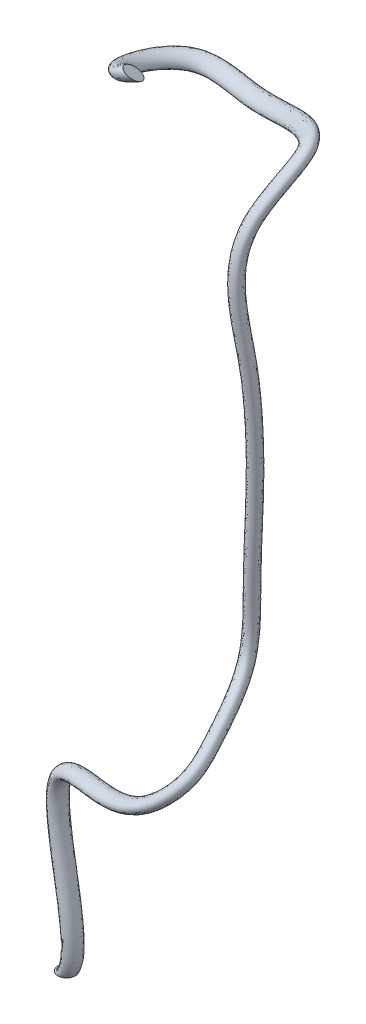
ISO-10303-21;
HEADER;
FILE_DESCRIPTION(('STEP AP214'),'2;1');
FILE_NAME('part.step','',(''),(''),'','','');
FILE_SCHEMA(('AUTOMOTIVE_DESIGN { 1 0 10303 214 1 1 1 1 }'));
ENDSEC;
DATA;
#1=APPLICATION_CONTEXT('core data for automotive mechanical design processes');
#2=APPLICATION_PROTOCOL_DEFINITION('international standard','automotive_design',2000,#1);
#3=PRODUCT_CONTEXT('',#1,'mechanical');
#4=PRODUCT('Part','Part','',(#3));
#5=PRODUCT_RELATED_PRODUCT_CATEGORY('part','',(#4));
#6=PRODUCT_DEFINITION_FORMATION('','',#4);
#7=PRODUCT_DEFINITION_CONTEXT('part definition',#1,'design');
#8=PRODUCT_DEFINITION('design','',#6,#7);
#9=PRODUCT_DEFINITION_SHAPE('','',#8);
#10=(LENGTH_UNIT() NAMED_UNIT(*) SI_UNIT(.MILLI.,.METRE.));
#11=(NAMED_UNIT(*) PLANE_ANGLE_UNIT() SI_UNIT($,.RADIAN.));
#12=(NAMED_UNIT(*) SI_UNIT($,.STERADIAN.) SOLID_ANGLE_UNIT());
#13=UNCERTAINTY_MEASURE_WITH_UNIT(LENGTH_MEASURE(1.E-05),#10,'distance_accuracy_value','');
#14=(GEOMETRIC_REPRESENTATION_CONTEXT(3) GLOBAL_UNCERTAINTY_ASSIGNED_CONTEXT((#13)) GLOBAL_UNIT_ASSIGNED_CONTEXT((#10,
#11,#12)) REPRESENTATION_CONTEXT('',''));
#15=CARTESIAN_POINT('',(0.,0.,0.));
#16=DIRECTION('',(0.,0.,1.));
#17=DIRECTION('',(1.,0.,0.));
#18=AXIS2_PLACEMENT_3D('',#15,#16,#17);
#19=CARTESIAN_POINT('',(0.,0.,0.));
#20=DIRECTION('',(0.,1.,0.));
#21=DIRECTION('',(0.,0.,1.));
#22=AXIS2_PLACEMENT_3D('',#19,#20,#21);
#23=PLANE('',#22);
#24=CARTESIAN_POINT('',(0.,0.,16.815834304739));
#25=CARTESIAN_POINT('',(0.472104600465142,0.,16.8158302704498));
#26=CARTESIAN_POINT('',(0.944332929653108,0.,16.7959294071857));
#27=CARTESIAN_POINT('',(1.65008457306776,0.,16.7363482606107));
#28=CARTESIAN_POINT('',(1.88497292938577,0.,16.7115210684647));
#29=CARTESIAN_POINT('',(2.35355708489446,0.,16.651991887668));
#30=CARTESIAN_POINT('',(2.58725258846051,0.,16.6172875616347));
#31=CARTESIAN_POINT('',(3.28663421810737,0.,16.498308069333));
#32=CARTESIAN_POINT('',(3.74988091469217,0.,16.3992284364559));
#33=CARTESIAN_POINT('',(4.66636829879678,0.,16.1623422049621));
#34=CARTESIAN_POINT('',(5.11960892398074,0.,16.024535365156));
#35=CARTESIAN_POINT('',(5.78928637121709,0.,15.7896297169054));
#36=CARTESIAN_POINT('',(6.01076065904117,0.,15.7066529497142));
#37=CARTESIAN_POINT('',(6.44995635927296,0.,15.5314594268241));
#38=CARTESIAN_POINT('',(6.66767872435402,0.,15.4392450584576));
#39=CARTESIAN_POINT('',(7.31477122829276,0.,15.1489227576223));
#40=CARTESIAN_POINT('',(7.73809506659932,0.,14.9371257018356));
#41=CARTESIAN_POINT('',(8.5651334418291,0.,14.47875221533));
#42=CARTESIAN_POINT('',(8.96885739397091,0.,14.2321927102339));
#43=CARTESIAN_POINT('',(9.75411701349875,0.,13.7059418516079));
#44=CARTESIAN_POINT('',(10.1356528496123,0.,13.4262507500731));
#45=CARTESIAN_POINT('',(10.873881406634,0.,12.8356723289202));
#46=CARTESIAN_POINT('',(11.2305692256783,0.,12.5247788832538));
#47=CARTESIAN_POINT('',(11.9164895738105,0.,11.8740490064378));
#48=CARTESIAN_POINT('',(12.2457220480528,0.,11.5342125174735));
#49=CARTESIAN_POINT('',(12.8744159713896,0.,10.8279832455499));
#50=CARTESIAN_POINT('',(13.1738748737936,0.,10.4615881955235));
#51=CARTESIAN_POINT('',(13.7408607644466,0.,9.70487254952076));
#52=CARTESIAN_POINT('',(14.0083877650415,0.,9.3145519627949));
#53=CARTESIAN_POINT('',(14.5095983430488,0.,8.51277542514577));
#54=CARTESIAN_POINT('',(14.74328319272,0.,8.10132026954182));
#55=CARTESIAN_POINT('',(15.1751601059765,0.,7.26018629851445));
#56=CARTESIAN_POINT('',(15.3733521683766,0.,6.83050748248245));
#57=CARTESIAN_POINT('',(15.7328325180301,0.,5.95598569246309));
#58=CARTESIAN_POINT('',(15.8941212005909,0.,5.51114288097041));
#59=CARTESIAN_POINT('',(16.1786508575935,0.,4.60945126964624));
#60=CARTESIAN_POINT('',(16.301891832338,0.,4.15260246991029));
#61=CARTESIAN_POINT('',(16.509450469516,0.,3.23014429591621));
#62=CARTESIAN_POINT('',(16.5937679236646,0.,2.7645348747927));
#63=CARTESIAN_POINT('',(16.7228791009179,0.,1.82786803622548));
#64=CARTESIAN_POINT('',(16.7676728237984,0.,1.35681061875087));
#65=CARTESIAN_POINT('',(16.8174180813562,0.,0.412596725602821));
#66=CARTESIAN_POINT('',(16.8223696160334,0.,-0.0605597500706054));
#67=CARTESIAN_POINT('',(16.7923952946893,0.,-1.00560789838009));
#68=CARTESIAN_POINT('',(16.757469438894,0.,-1.47749957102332));
#69=CARTESIAN_POINT('',(16.6479889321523,0.,-2.41666073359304));
#70=CARTESIAN_POINT('',(16.5734344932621,0.,-2.88393024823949));
#71=CARTESIAN_POINT('',(16.3852269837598,0.,-3.81052769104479));
#72=CARTESIAN_POINT('',(16.2715739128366,0.,-4.26985561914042));
#73=CARTESIAN_POINT('',(16.0059757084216,0.,-5.17730924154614));
#74=CARTESIAN_POINT('',(15.8540301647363,0.,-5.62543481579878));
#75=CARTESIAN_POINT('',(15.5129278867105,0.,-6.507292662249));
#76=CARTESIAN_POINT('',(15.3237711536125,0.,-6.94102493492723));
#77=CARTESIAN_POINT('',(14.9095834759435,0.,-7.79102859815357));
#78=CARTESIAN_POINT('',(14.6845511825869,0.,-8.20729933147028));
#79=CARTESIAN_POINT('',(14.2002174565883,0.,-9.01940302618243));
#80=CARTESIAN_POINT('',(13.9409160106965,0.,-9.41523597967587));
#81=CARTESIAN_POINT('',(13.3899109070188,0.,-10.1836168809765));
#82=CARTESIAN_POINT('',(13.0982100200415,0.,-10.5561668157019));
#83=CARTESIAN_POINT('',(12.4844635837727,0.,-11.2753687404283));
#84=CARTESIAN_POINT('',(12.1624180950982,0.,-11.6220207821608));
#85=CARTESIAN_POINT('',(11.4903324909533,0.,-12.2869006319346));
#86=CARTESIAN_POINT('',(11.1402978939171,0.,-12.6051340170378));
#87=CARTESIAN_POINT('',(10.4146822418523,0.,-13.2109842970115));
#88=CARTESIAN_POINT('',(10.0391009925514,0.,-13.498600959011));
#89=CARTESIAN_POINT('',(9.26480551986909,0.,-14.0413396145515));
#90=CARTESIAN_POINT('',(8.86608015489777,0.,-14.2964457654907));
#91=CARTESIAN_POINT('',(8.25307608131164,0.,-14.6531553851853));
#92=CARTESIAN_POINT('',(8.04624861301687,0.,-14.7677368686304));
#93=CARTESIAN_POINT('',(7.62789306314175,0.,-14.9881098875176));
#94=CARTESIAN_POINT('',(7.41636378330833,0.,-15.0938991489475));
#95=CARTESIAN_POINT('',(6.77507678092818,0.,-15.3978720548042));
#96=CARTESIAN_POINT('',(6.33882557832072,0.,-15.5825411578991));
#97=CARTESIAN_POINT('',(5.45230306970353,0.,-15.9144177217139));
#98=CARTESIAN_POINT('',(5.00203185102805,0.,-16.0616254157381));
#99=CARTESIAN_POINT('',(4.319023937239,0.,-16.2534351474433));
#100=CARTESIAN_POINT('',(4.09026877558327,0.,-16.3125033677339));
#101=CARTESIAN_POINT('',(3.63053380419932,0.,-16.4209404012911));
#102=CARTESIAN_POINT('',(3.39955453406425,0.,-16.4703115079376));
#103=CARTESIAN_POINT('',(2.70397047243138,0.,-16.6037210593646));
#104=CARTESIAN_POINT('',(2.23644747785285,0.,-16.6731320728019));
#105=CARTESIAN_POINT('',(1.47352099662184,0.,-16.7537509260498));
#106=CARTESIAN_POINT('',(1.17931652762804,0.,-16.7770239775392));
#107=CARTESIAN_POINT('',(0.590090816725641,0.,-16.8080669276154));
#108=CARTESIAN_POINT('',(0.295069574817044,0.,-16.8158368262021));
#109=CARTESIAN_POINT('',(-0.472104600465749,0.,-16.8158302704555));
#110=CARTESIAN_POINT('',(-0.94433292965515,0.,-16.7959294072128));
#111=CARTESIAN_POINT('',(-1.65008457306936,0.,-16.7363482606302));
#112=CARTESIAN_POINT('',(-1.8849729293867,0.,-16.711521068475));
#113=CARTESIAN_POINT('',(-2.35355708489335,0.,-16.6519918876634));
#114=CARTESIAN_POINT('',(-2.58725258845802,0.,-16.6172875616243));
#115=CARTESIAN_POINT('',(-3.28663421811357,0.,-16.4983080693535));
#116=CARTESIAN_POINT('',(-3.74988091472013,0.,-16.3992284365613));
#117=CARTESIAN_POINT('',(-4.66636829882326,0.,-16.1623422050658));
#118=CARTESIAN_POINT('',(-5.11960892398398,0.,-16.024535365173));
#119=CARTESIAN_POINT('',(-5.78928637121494,0.,-15.7896297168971));
#120=CARTESIAN_POINT('',(-6.01076065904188,0.,-15.7066529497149));
#121=CARTESIAN_POINT('',(-6.44995635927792,0.,-15.5314594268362));
#122=CARTESIAN_POINT('',(-6.66767872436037,0.,-15.439245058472));
#123=CARTESIAN_POINT('',(-7.31477122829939,0.,-15.1489227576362));
#124=CARTESIAN_POINT('',(-7.7380950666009,0.,-14.9371257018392));
#125=CARTESIAN_POINT('',(-8.56513344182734,0.,-14.4787522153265));
#126=CARTESIAN_POINT('',(-8.96885739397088,0.,-14.2321927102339));
#127=CARTESIAN_POINT('',(-9.75411701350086,0.,-13.705941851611));
#128=CARTESIAN_POINT('',(-10.1356528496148,0.,-13.426250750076));
#129=CARTESIAN_POINT('',(-10.8738814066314,0.,-12.8356723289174));
#130=CARTESIAN_POINT('',(-11.2305692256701,0.,-12.5247788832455));
#131=CARTESIAN_POINT('',(-11.9164895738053,0.,-11.8740490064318));
#132=CARTESIAN_POINT('',(-12.2457220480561,0.,-11.5342125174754));
#133=CARTESIAN_POINT('',(-12.8744159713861,0.,-10.8279832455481));
#134=CARTESIAN_POINT('',(-13.1738748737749,0.,-10.4615881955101));
#135=CARTESIAN_POINT('',(-13.7408607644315,0.,-9.70487254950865));
#136=CARTESIAN_POINT('',(-14.0083877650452,0.,-9.31455196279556));
#137=CARTESIAN_POINT('',(-14.5095983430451,0.,-8.5127754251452));
#138=CARTESIAN_POINT('',(-14.7432831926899,0.,-8.10132026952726));
#139=CARTESIAN_POINT('',(-15.1751601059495,0.,-7.26018629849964));
#140=CARTESIAN_POINT('',(-15.3733521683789,0.,-6.83050748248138));
#141=CARTESIAN_POINT('',(-15.7328325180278,0.,-5.95598569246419));
#142=CARTESIAN_POINT('',(-15.8941212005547,0.,-5.51114288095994));
#143=CARTESIAN_POINT('',(-16.1786508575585,0.,-4.60945126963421));
#144=CARTESIAN_POINT('',(-16.3018918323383,0.,-4.15260246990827));
#145=CARTESIAN_POINT('',(-16.5094504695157,0.,-3.23014429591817));
#146=CARTESIAN_POINT('',(-16.5937679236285,0.,-2.76453487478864));
#147=CARTESIAN_POINT('',(-16.722879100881,0.,-1.82786803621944));
#148=CARTESIAN_POINT('',(-16.7676728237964,0.,-1.35681061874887));
#149=CARTESIAN_POINT('',(-16.8174180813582,0.,-0.412596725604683));
#150=CARTESIAN_POINT('',(-16.8223696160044,0.,0.0605597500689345));
#151=CARTESIAN_POINT('',(-16.7923952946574,0.,1.00560789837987));
#152=CARTESIAN_POINT('',(-16.7574694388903,0.,1.47749957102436));
#153=CARTESIAN_POINT('',(-16.6479889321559,0.,2.41666073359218));
#154=CARTESIAN_POINT('',(-16.5734344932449,0.,2.88393024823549));
#155=CARTESIAN_POINT('',(-16.3852269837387,0.,3.81052769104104));
#156=CARTESIAN_POINT('',(-16.2715739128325,0.,4.26985561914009));
#157=CARTESIAN_POINT('',(-16.0059757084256,0.,5.17730924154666));
#158=CARTESIAN_POINT('',(-15.8540301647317,0.,5.62543481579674));
#159=CARTESIAN_POINT('',(-15.5129278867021,0.,6.50729266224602));
#160=CARTESIAN_POINT('',(-15.3237711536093,0.,6.94102493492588));
#161=CARTESIAN_POINT('',(-14.9095834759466,0.,7.79102859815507));
#162=CARTESIAN_POINT('',(-14.6845511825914,0.,8.20729933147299));
#163=CARTESIAN_POINT('',(-14.2002174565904,0.,9.01940302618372));
#164=CARTESIAN_POINT('',(-13.9409160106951,0.,9.41523597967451));
#165=CARTESIAN_POINT('',(-13.3899109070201,0.,10.1836168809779));
#166=CARTESIAN_POINT('',(-13.0982100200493,0.,10.5561668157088));
#167=CARTESIAN_POINT('',(-12.4844635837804,0.,11.2753687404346));
#168=CARTESIAN_POINT('',(-12.1624180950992,0.,11.6220207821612));
#169=CARTESIAN_POINT('',(-11.4903324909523,0.,12.2869006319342));
#170=CARTESIAN_POINT('',(-11.1402978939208,0.,12.6051340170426));
#171=CARTESIAN_POINT('',(-10.4146822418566,0.,13.2109842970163));
#172=CARTESIAN_POINT('',(-10.0391009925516,0.,13.4986009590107));
#173=CARTESIAN_POINT('',(-9.26480551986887,0.,14.0413396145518));
#174=CARTESIAN_POINT('',(-8.86608015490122,0.,14.2964457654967));
#175=CARTESIAN_POINT('',(-8.25307608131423,0.,14.6531553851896));
#176=CARTESIAN_POINT('',(-8.04624861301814,0.,14.7677368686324));
#177=CARTESIAN_POINT('',(-7.62789306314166,0.,14.9881098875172));
#178=CARTESIAN_POINT('',(-7.4163637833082,0.,15.0938991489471));
#179=CARTESIAN_POINT('',(-6.77507678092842,0.,15.3978720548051));
#180=CARTESIAN_POINT('',(-6.33882557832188,0.,15.5825411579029));
#181=CARTESIAN_POINT('',(-5.45230306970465,0.,15.9144177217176));
#182=CARTESIAN_POINT('',(-5.00203185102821,0.,16.0616254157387));
#183=CARTESIAN_POINT('',(-4.3190239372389,0.,16.253435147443));
#184=CARTESIAN_POINT('',(-4.09026877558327,0.,16.3125033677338));
#185=CARTESIAN_POINT('',(-3.63053380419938,0.,16.4209404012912));
#186=CARTESIAN_POINT('',(-3.39955453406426,0.,16.4703115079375));
#187=CARTESIAN_POINT('',(-2.70397047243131,0.,16.6037210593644));
#188=CARTESIAN_POINT('',(-2.2364474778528,0.,16.6731320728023));
#189=CARTESIAN_POINT('',(-1.47352099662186,0.,16.7537509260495));
#190=CARTESIAN_POINT('',(-1.17931652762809,0.,16.7770239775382));
#191=CARTESIAN_POINT('',(-0.590090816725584,0.,16.8080669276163));
#192=CARTESIAN_POINT('',(-0.295069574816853,0.,16.8158368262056));
#193=CARTESIAN_POINT('',(0.,0.,16.815834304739));
#194=B_SPLINE_CURVE_WITH_KNOTS('',3,(#24,#25,#26,#27,#28,#29,#30,#31,#32,#33,#34,#35,#36,#37,
#38,#39,#40,#41,#42,#43,#44,#45,#46,#47,#48,#49,#50,#51,#52,#53,#54,#55,#56,#57,#58,#59,#60,#61,
#62,#63,#64,#65,#66,#67,#68,#69,#70,#71,#72,#73,#74,#75,#76,#77,#78,#79,#80,#81,#82,#83,#84,#85,
#86,#87,#88,#89,#90,#91,#92,#93,#94,#95,#96,#97,#98,#99,#100,#101,#102,#103,#104,#105,#106,#107,
#108,#109,#110,#111,#112,#113,#114,#115,#116,#117,#118,#119,#120,#121,#122,#123,#124,#125,#126,
#127,#128,#129,#130,#131,#132,#133,#134,#135,#136,#137,#138,#139,#140,#141,#142,#143,#144,#145,
#146,#147,#148,#149,#150,#151,#152,#153,#154,#155,#156,#157,#158,#159,#160,#161,#162,#163,#164,
#165,#166,#167,#168,#169,#170,#171,#172,#173,#174,#175,#176,#177,#178,#179,#180,#181,#182,#183,
#184,#185,#186,#187,#188,#189,#190,#191,#192,#193),.UNSPECIFIED.,.T.,.F.,(4,2,2,2,2,2,2,2,2,2,2,
2,2,2,2,2,2,2,2,2,2,2,2,2,2,2,2,2,2,2,2,2,2,2,2,2,2,2,2,2,2,2,2,2,2,2,2,2,2,2,2,2,2,2,2,2,2,2,2,
2,2,2,2,2,2,2,2,2,2,2,2,2,2,2,2,2,2,2,2,2,2,2,2,2,4),(0.,1.41599608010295,2.12441650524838,
2.8330047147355,4.25238542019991,5.67177496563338,6.38111396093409,7.09027010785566,
8.50849274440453,9.92602722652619,11.3435509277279,12.761353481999,14.1791588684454,
15.5970854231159,17.0150114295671,18.4328841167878,19.850756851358,21.2686143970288,
22.6864719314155,24.1043370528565,25.5222021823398,26.9400673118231,28.3579324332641,
29.7757899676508,31.1936475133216,32.6115202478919,34.0293929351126,35.4473189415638,
36.8652454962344,38.2830508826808,39.7008534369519,41.1183771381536,42.5359116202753,
43.9541342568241,44.6632904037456,45.3726293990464,46.7920189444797,48.2113996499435,
48.9199878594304,49.6284082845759,51.0444043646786,51.9294145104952,52.8144246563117,
54.2304207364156,54.938841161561,55.6474293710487,57.066810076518,58.4861996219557,
59.1955386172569,59.9046947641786,61.3229174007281,62.7404518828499,64.1579755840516,
65.5757781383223,66.9935835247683,68.4115100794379,69.8294360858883,71.2473087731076,
72.6651815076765,74.0830390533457,75.5008965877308,76.9187617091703,78.336626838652,
79.754491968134,81.1723570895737,82.5902146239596,84.0080721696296,85.4259449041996,
86.84381759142,88.2617435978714,89.6796701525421,91.0974755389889,92.5152780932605,
93.9328017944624,95.3503362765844,96.7685589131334,97.4777150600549,98.1870540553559,
99.6064436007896,101.025824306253,101.73441251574,102.442832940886,103.858829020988,
104.743839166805,105.628849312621),.UNSPECIFIED.);
#195=CARTESIAN_POINT('',(0.,0.,16.815834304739));
#196=VERTEX_POINT('',#195);
#197=EDGE_CURVE('E19',#196,#196,#194,.T.);
#198=ORIENTED_EDGE('',*,*,#197,.F.);
#199=EDGE_LOOP('',(#198));
#200=FACE_BOUND('',#199,.T.);
#201=ADVANCED_FACE('F15',(#200),#23,.F.);
#202=CARTESIAN_POINT('',(-46.7943611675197,1388.72107523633,-175.862344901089));
#203=DIRECTION('',(0.361134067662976,0.854502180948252,-0.373374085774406));
#204=DIRECTION('',(0.,0.400395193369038,0.916342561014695));
#205=AXIS2_PLACEMENT_3D('',#202,#203,#204);
#206=PLANE('',#205);
#207=CARTESIAN_POINT('',(-46.1668095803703,1381.77078979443,-191.161756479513));
#208=CARTESIAN_POINT('',(-45.7269183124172,1381.62225147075,-191.076229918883));
#209=CARTESIAN_POINT('',(-45.2876542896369,1381.48189793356,-190.972578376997));
#210=CARTESIAN_POINT('',(-44.6322818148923,1381.28447067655,-190.790521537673));
#211=CARTESIAN_POINT('',(-44.4143471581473,1381.22082842,-190.725382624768));
#212=CARTESIAN_POINT('',(-43.9799575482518,1381.09800055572,-190.586336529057));
#213=CARTESIAN_POINT('',(-43.7635029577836,1381.03881600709,-190.512427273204));
#214=CARTESIAN_POINT('',(-43.1162825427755,1380.86794337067,-190.277482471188));
#215=CARTESIAN_POINT('',(-42.6883421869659,1380.76314176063,-190.103419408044));
#216=CARTESIAN_POINT('',(-41.8432299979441,1380.57269331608,-189.721871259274));
#217=CARTESIAN_POINT('',(-41.4260582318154,1380.48704660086,-189.514385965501));
#218=CARTESIAN_POINT('',(-40.8108414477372,1380.37343425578,-189.179350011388));
#219=CARTESIAN_POINT('',(-40.6075756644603,1380.33804677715,-189.063735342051));
#220=CARTESIAN_POINT('',(-40.2048857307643,1380.27227165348,-188.824779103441));
#221=CARTESIAN_POINT('',(-40.0054606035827,1380.24188272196,-188.701439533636));
#222=CARTESIAN_POINT('',(-39.4133558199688,1380.15828105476,-188.3200756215));
#223=CARTESIAN_POINT('',(-39.0268207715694,1380.11262864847,-188.050691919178));
#224=CARTESIAN_POINT('',(-38.2733199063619,1380.0418685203,-187.483833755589));
#225=CARTESIAN_POINT('',(-37.9063446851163,1380.01675084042,-187.186372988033));
#226=CARTESIAN_POINT('',(-37.19430500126,1379.98719064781,-186.565326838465));
#227=CARTESIAN_POINT('',(-36.8492403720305,1379.98274797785,-186.24174165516));
#228=CARTESIAN_POINT('',(-36.1834233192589,1379.99457307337,-185.570688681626));
#229=CARTESIAN_POINT('',(-35.8626756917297,1380.01084491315,-185.22321620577));
#230=CARTESIAN_POINT('',(-35.2478424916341,1380.06398960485,-184.5069118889));
#231=CARTESIAN_POINT('',(-34.9537569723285,1380.10086249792,-184.13808000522));
#232=CARTESIAN_POINT('',(-34.394316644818,1380.19495144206,-183.381647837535));
#233=CARTESIAN_POINT('',(-34.1289642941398,1380.25216923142,-182.994045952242));
#234=CARTESIAN_POINT('',(-33.6289055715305,1380.38654052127,-182.202858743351));
#235=CARTESIAN_POINT('',(-33.3941991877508,1380.46369401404,-181.799273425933));
#236=CARTESIAN_POINT('',(-32.9571093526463,1380.63738490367,-180.979004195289));
#237=CARTESIAN_POINT('',(-32.7547246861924,1380.7339215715,-180.562320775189));
#238=CARTESIAN_POINT('',(-32.3837064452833,1380.94569429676,-179.718803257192));
#239=CARTESIAN_POINT('',(-32.2150728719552,1381.06093035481,-179.291969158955));
#240=CARTESIAN_POINT('',(-31.9127573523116,1381.30928125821,-178.431189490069));
#241=CARTESIAN_POINT('',(-31.7790750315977,1381.44239591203,-177.997243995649));
#242=CARTESIAN_POINT('',(-31.5476100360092,1381.72555859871,-177.125322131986));
#243=CARTESIAN_POINT('',(-31.4498273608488,1381.87560663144,-176.687345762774));
#244=CARTESIAN_POINT('',(-31.2908563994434,1382.19157018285,-175.810473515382));
#245=CARTESIAN_POINT('',(-31.2296683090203,1382.35748578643,-175.371577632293));
#246=CARTESIAN_POINT('',(-31.1443223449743,1382.70400424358,-174.495988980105));
#247=CARTESIAN_POINT('',(-31.1201644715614,1382.88460709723,-174.059296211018));
#248=CARTESIAN_POINT('',(-31.1090506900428,1383.25921607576,-173.191218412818));
#249=CARTESIAN_POINT('',(-31.1220947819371,1383.45322220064,-172.759833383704));
#250=CARTESIAN_POINT('',(-31.1852921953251,1383.85325845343,-171.905437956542));
#251=CARTESIAN_POINT('',(-31.2354455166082,1384.05928858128,-171.482427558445));
#252=CARTESIAN_POINT('',(-31.3725044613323,1384.48190695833,-170.647790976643));
#253=CARTESIAN_POINT('',(-31.4594098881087,1384.69849515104,-170.236164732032));
#254=CARTESIAN_POINT('',(-31.6693551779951,1385.14069088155,-169.42722048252));
#255=CARTESIAN_POINT('',(-31.7923950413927,1385.36629841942,-169.029902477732));
#256=CARTESIAN_POINT('',(-32.0737359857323,1385.82493138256,-168.252395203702));
#257=CARTESIAN_POINT('',(-32.2320374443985,1386.05795688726,-167.872206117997));
#258=CARTESIAN_POINT('',(-32.5827753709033,1386.52976677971,-167.131664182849));
#259=CARTESIAN_POINT('',(-32.775211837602,1386.76855116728,-166.771311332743));
#260=CARTESIAN_POINT('',(-33.1928595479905,1387.25019028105,-166.072990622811));
#261=CARTESIAN_POINT('',(-33.4180720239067,1387.49304515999,-165.735023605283));
#262=CARTESIAN_POINT('',(-33.8996651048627,1387.98108984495,-165.083892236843));
#263=CARTESIAN_POINT('',(-34.1560457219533,1388.22627965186,-164.77072789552));
#264=CARTESIAN_POINT('',(-34.6981292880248,1388.71722998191,-164.171454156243));
#265=CARTESIAN_POINT('',(-34.9838297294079,1388.96299045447,-163.885342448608));
#266=CARTESIAN_POINT('',(-35.5825382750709,1389.45335476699,-163.342178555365));
#267=CARTESIAN_POINT('',(-35.8955463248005,1389.69795860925,-163.08512631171));
#268=CARTESIAN_POINT('',(-36.5465861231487,1390.18422610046,-162.601954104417));
#269=CARTESIAN_POINT('',(-36.8846129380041,1390.42589031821,-162.37582806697));
#270=CARTESIAN_POINT('',(-37.5833273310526,1390.90460218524,-161.956059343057));
#271=CARTESIAN_POINT('',(-37.9440150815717,1391.14164979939,-161.762416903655));
#272=CARTESIAN_POINT('',(-38.6857324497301,1391.60959281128,-161.40888697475));
#273=CARTESIAN_POINT('',(-39.0667718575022,1391.84048516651,-161.249015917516));
#274=CARTESIAN_POINT('',(-39.6512608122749,1392.18079134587,-161.035520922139));
#275=CARTESIAN_POINT('',(-39.8482518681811,1392.29322480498,-160.968739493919));
#276=CARTESIAN_POINT('',(-40.2462858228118,1392.51593765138,-160.844025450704));
#277=CARTESIAN_POINT('',(-40.4473297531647,1392.62621647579,-160.786095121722));
#278=CARTESIAN_POINT('',(-41.056203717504,1392.95362438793,-160.625704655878));
#279=CARTESIAN_POINT('',(-41.469579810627,1393.16721074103,-160.536716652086));
#280=CARTESIAN_POINT('',(-42.3079974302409,1393.58331107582,-160.395363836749));
#281=CARTESIAN_POINT('',(-42.7330388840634,1393.78582512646,-160.342998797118));
#282=CARTESIAN_POINT('',(-43.3766011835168,1394.08000079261,-160.292214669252));
#283=CARTESIAN_POINT('',(-43.5919520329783,1394.17638881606,-160.279912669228));
#284=CARTESIAN_POINT('',(-44.0243646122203,1394.36585587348,-160.264536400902));
#285=CARTESIAN_POINT('',(-44.2414259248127,1394.45893568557,-160.261459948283));
#286=CARTESIAN_POINT('',(-44.8945268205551,1394.73293039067,-160.266087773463));
#287=CARTESIAN_POINT('',(-45.332739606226,1394.90871766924,-160.287629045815));
#288=CARTESIAN_POINT('',(-46.0466178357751,1395.18208122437,-160.352486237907));
#289=CARTESIAN_POINT('',(-46.3216163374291,1395.28426701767,-160.384607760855));
#290=CARTESIAN_POINT('',(-46.8717958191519,1395.4824878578,-160.463103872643));
#291=CARTESIAN_POINT('',(-47.1469767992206,1395.57852290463,-160.509478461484));
#292=CARTESIAN_POINT('',(-47.861804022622,1395.81989900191,-160.648459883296));
#293=CARTESIAN_POINT('',(-48.3010680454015,1395.9602525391,-160.752111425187));
#294=CARTESIAN_POINT('',(-48.9564405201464,1396.15767979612,-160.934168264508));
#295=CARTESIAN_POINT('',(-49.1743751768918,1396.22132205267,-160.999307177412));
#296=CARTESIAN_POINT('',(-49.6087647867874,1396.34414991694,-161.138353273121));
#297=CARTESIAN_POINT('',(-49.8252193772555,1396.40333446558,-161.212262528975));
#298=CARTESIAN_POINT('',(-50.4724397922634,1396.574207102,-161.447207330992));
#299=CARTESIAN_POINT('',(-50.9003801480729,1396.67900871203,-161.621270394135));
#300=CARTESIAN_POINT('',(-51.7454923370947,1396.86945715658,-162.002818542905));
#301=CARTESIAN_POINT('',(-52.1626641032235,1396.9551038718,-162.210303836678));
#302=CARTESIAN_POINT('',(-52.7778808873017,1397.06871621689,-162.545339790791));
#303=CARTESIAN_POINT('',(-52.9811466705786,1397.10410369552,-162.660954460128));
#304=CARTESIAN_POINT('',(-53.3838366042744,1397.16987881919,-162.899910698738));
#305=CARTESIAN_POINT('',(-53.5832617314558,1397.20026775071,-163.023250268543));
#306=CARTESIAN_POINT('',(-54.1753665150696,1397.2838694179,-163.40461418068));
#307=CARTESIAN_POINT('',(-54.5619015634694,1397.3295218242,-163.673997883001));
#308=CARTESIAN_POINT('',(-55.3154024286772,1397.40028195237,-164.24085604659));
#309=CARTESIAN_POINT('',(-55.6823776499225,1397.42539963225,-164.538316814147));
#310=CARTESIAN_POINT('',(-56.3944173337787,1397.45495982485,-165.159362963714));
#311=CARTESIAN_POINT('',(-56.7394819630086,1397.45940249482,-165.482948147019));
#312=CARTESIAN_POINT('',(-57.4052990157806,1397.4475773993,-166.154001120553));
#313=CARTESIAN_POINT('',(-57.7260466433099,1397.43130555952,-166.501473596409));
#314=CARTESIAN_POINT('',(-58.3408798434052,1397.37816086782,-167.217777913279));
#315=CARTESIAN_POINT('',(-58.6349653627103,1397.34128797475,-167.586609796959));
#316=CARTESIAN_POINT('',(-59.1944056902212,1397.24719903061,-168.343041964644));
#317=CARTESIAN_POINT('',(-59.4597580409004,1397.18998124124,-168.730643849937));
#318=CARTESIAN_POINT('',(-59.9598167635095,1397.0556099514,-169.521831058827));
#319=CARTESIAN_POINT('',(-60.1945231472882,1396.97845645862,-169.925416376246));
#320=CARTESIAN_POINT('',(-60.6316129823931,1396.804765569,-170.74568560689));
#321=CARTESIAN_POINT('',(-60.8339976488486,1396.70822890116,-171.162369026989));
#322=CARTESIAN_POINT('',(-61.2050158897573,1396.4964561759,-172.005886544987));
#323=CARTESIAN_POINT('',(-61.3736494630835,1396.38122011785,-172.432720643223));
#324=CARTESIAN_POINT('',(-61.6759649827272,1396.13286921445,-173.29350031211));
#325=CARTESIAN_POINT('',(-61.8096473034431,1395.99975456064,-173.727445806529));
#326=CARTESIAN_POINT('',(-62.041112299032,1395.71659187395,-174.599367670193));
#327=CARTESIAN_POINT('',(-62.1388949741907,1395.56654384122,-175.037344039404));
#328=CARTESIAN_POINT('',(-62.2978659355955,1395.25058028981,-175.914216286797));
#329=CARTESIAN_POINT('',(-62.3590540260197,1395.08466468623,-176.353112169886));
#330=CARTESIAN_POINT('',(-62.4443999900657,1394.73814622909,-177.228700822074));
#331=CARTESIAN_POINT('',(-62.4685578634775,1394.55754337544,-177.665393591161));
#332=CARTESIAN_POINT('',(-62.4796716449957,1394.1829343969,-178.533471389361));
#333=CARTESIAN_POINT('',(-62.4666275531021,1393.98892827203,-178.964856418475));
#334=CARTESIAN_POINT('',(-62.4034301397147,1393.58889201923,-179.819251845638));
#335=CARTESIAN_POINT('',(-62.3532768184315,1393.38286189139,-180.242262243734));
#336=CARTESIAN_POINT('',(-62.2162178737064,1392.96024351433,-181.076898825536));
#337=CARTESIAN_POINT('',(-62.1293124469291,1392.74365532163,-181.488525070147));
#338=CARTESIAN_POINT('',(-61.9193671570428,1392.30145959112,-182.297469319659));
#339=CARTESIAN_POINT('',(-61.7963272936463,1392.07585205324,-182.694787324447));
#340=CARTESIAN_POINT('',(-61.5149863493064,1391.61721909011,-183.472294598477));
#341=CARTESIAN_POINT('',(-61.3566848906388,1391.38419358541,-183.852483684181));
#342=CARTESIAN_POINT('',(-61.0059469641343,1390.91238369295,-184.593025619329));
#343=CARTESIAN_POINT('',(-60.8135104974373,1390.67359930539,-184.953378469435));
#344=CARTESIAN_POINT('',(-60.3958627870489,1390.19196019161,-185.651699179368));
#345=CARTESIAN_POINT('',(-60.1706503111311,1389.94910531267,-185.989666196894));
#346=CARTESIAN_POINT('',(-59.689057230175,1389.46106062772,-186.640797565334));
#347=CARTESIAN_POINT('',(-59.432676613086,1389.2158708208,-186.953961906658));
#348=CARTESIAN_POINT('',(-58.8905930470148,1388.72492049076,-187.553235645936));
#349=CARTESIAN_POINT('',(-58.6048926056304,1388.47916001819,-187.839347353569));
#350=CARTESIAN_POINT('',(-58.0061840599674,1387.98879570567,-188.382511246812));
#351=CARTESIAN_POINT('',(-57.6931760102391,1387.74419186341,-188.639563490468));
#352=CARTESIAN_POINT('',(-57.0421362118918,1387.25792437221,-189.122735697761));
#353=CARTESIAN_POINT('',(-56.7041093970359,1387.01626015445,-189.348861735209));
#354=CARTESIAN_POINT('',(-56.0053950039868,1386.53754828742,-189.768630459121));
#355=CARTESIAN_POINT('',(-55.6447072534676,1386.30050067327,-189.962272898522));
#356=CARTESIAN_POINT('',(-54.9029898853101,1385.83255766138,-190.315802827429));
#357=CARTESIAN_POINT('',(-54.5219504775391,1385.60166530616,-190.475673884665));
#358=CARTESIAN_POINT('',(-53.9374615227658,1385.26135912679,-190.689168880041));
#359=CARTESIAN_POINT('',(-53.7404704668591,1385.14892566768,-190.755950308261));
#360=CARTESIAN_POINT('',(-53.3424365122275,1384.92621282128,-190.880664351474));
#361=CARTESIAN_POINT('',(-53.1413925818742,1384.81593399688,-190.938594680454));
#362=CARTESIAN_POINT('',(-52.5325186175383,1384.48852608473,-191.098985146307));
#363=CARTESIAN_POINT('',(-52.1191425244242,1384.27493973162,-191.187973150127));
#364=CARTESIAN_POINT('',(-51.2807249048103,1383.85883939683,-191.329325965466));
#365=CARTESIAN_POINT('',(-50.855683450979,1383.6563253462,-191.38169100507));
#366=CARTESIAN_POINT('',(-50.2121211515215,1383.36214968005,-191.432475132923));
#367=CARTESIAN_POINT('',(-49.9967703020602,1383.2657616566,-191.444777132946));
#368=CARTESIAN_POINT('',(-49.5643577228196,1383.07629459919,-191.460153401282));
#369=CARTESIAN_POINT('',(-49.3472964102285,1382.98321478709,-191.463229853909));
#370=CARTESIAN_POINT('',(-48.6941955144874,1382.70922008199,-191.458602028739));
#371=CARTESIAN_POINT('',(-48.2559827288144,1382.53343280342,-191.437060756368));
#372=CARTESIAN_POINT('',(-47.5421044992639,1382.2600692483,-191.372203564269));
#373=CARTESIAN_POINT('',(-47.26710599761,1382.15788345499,-191.340082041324));
#374=CARTESIAN_POINT('',(-46.7169265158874,1381.95966261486,-191.261585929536));
#375=CARTESIAN_POINT('',(-46.4417455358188,1381.86362756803,-191.215211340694));
#376=CARTESIAN_POINT('',(-46.1668095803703,1381.77078979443,-191.161756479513));
#377=B_SPLINE_CURVE_WITH_KNOTS('',3,(#207,#208,#209,#210,#211,#212,#213,#214,#215,#216,#217,
#218,#219,#220,#221,#222,#223,#224,#225,#226,#227,#228,#229,#230,#231,#232,#233,#234,#235,#236,
#237,#238,#239,#240,#241,#242,#243,#244,#245,#246,#247,#248,#249,#250,#251,#252,#253,#254,#255,
#256,#257,#258,#259,#260,#261,#262,#263,#264,#265,#266,#267,#268,#269,#270,#271,#272,#273,#274,
#275,#276,#277,#278,#279,#280,#281,#282,#283,#284,#285,#286,#287,#288,#289,#290,#291,#292,#293,
#294,#295,#296,#297,#298,#299,#300,#301,#302,#303,#304,#305,#306,#307,#308,#309,#310,#311,#312,
#313,#314,#315,#316,#317,#318,#319,#320,#321,#322,#323,#324,#325,#326,#327,#328,#329,#330,#331,
#332,#333,#334,#335,#336,#337,#338,#339,#340,#341,#342,#343,#344,#345,#346,#347,#348,#349,#350,
#351,#352,#353,#354,#355,#356,#357,#358,#359,#360,#361,#362,#363,#364,#365,#366,#367,#368,#369,
#370,#371,#372,#373,#374,#375,#376),.UNSPECIFIED.,.T.,.F.,(4,2,2,2,2,2,2,2,2,2,2,2,2,2,2,2,2,2,
2,2,2,2,2,2,2,2,2,2,2,2,2,2,2,2,2,2,2,2,2,2,2,2,2,2,2,2,2,2,2,2,2,2,2,2,2,2,2,2,2,2,2,2,2,2,2,2,
2,2,2,2,2,2,2,2,2,2,2,2,2,2,2,2,2,2,4),(0.,1.41599608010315,2.12441650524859,2.83300471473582,
4.25238542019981,5.67177496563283,6.38111396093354,7.09027010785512,8.508492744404,
9.92602722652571,11.3435509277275,12.7613534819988,14.1791588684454,15.5970854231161,
17.0150114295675,18.4328841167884,19.8507568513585,21.2686143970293,22.6864719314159,
24.104337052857,25.5222021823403,26.9400673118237,28.3579324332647,29.7757899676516,
31.1936475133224,32.6115202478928,34.0293929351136,35.4473189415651,36.8652454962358,
38.2830508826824,39.7008534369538,41.1183771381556,42.5359116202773,43.9541342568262,
44.6632904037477,45.3726293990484,46.7920189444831,48.2113996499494,48.9199878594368,
49.6284082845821,51.0444043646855,51.9294145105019,52.8144246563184,54.2304207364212,
54.9388411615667,55.6474293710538,57.0668100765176,58.4861996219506,59.1955386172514,
59.9046947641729,61.3229174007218,62.7404518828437,64.1579755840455,65.5757781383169,
66.9935835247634,68.4115100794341,69.8294360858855,71.2473087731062,72.6651815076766,
74.0830390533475,75.5008965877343,76.9187617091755,78.336626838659,79.7544919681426,
81.1723570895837,82.5902146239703,84.008072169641,85.4259449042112,86.8438175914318,
88.261743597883,89.6796701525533,91.0974755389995,92.5152780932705,93.9328017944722,
95.3503362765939,96.7685589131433,97.4777150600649,98.1870540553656,99.6064436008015,
101.02582430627,101.734412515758,102.442832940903,103.858829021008,104.743839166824,
105.628849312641),.UNSPECIFIED.);
#378=CARTESIAN_POINT('',(-46.1668095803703,1381.77078979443,-191.161756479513));
#379=VERTEX_POINT('',#378);
#380=EDGE_CURVE('E10',#379,#379,#377,.T.);
#381=ORIENTED_EDGE('',*,*,#380,.F.);
#382=EDGE_LOOP('',(#381));
#383=FACE_BOUND('',#382,.T.);
#384=ADVANCED_FACE('F37',(#383),#206,.T.);
#385=CARTESIAN_POINT('',(0.,0.,16.815834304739));
#386=CARTESIAN_POINT('',(1.81304735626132,2.1472036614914,17.2516059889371));
#387=CARTESIAN_POINT('',(3.42146112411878,4.44622499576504,17.638193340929));
#388=CARTESIAN_POINT('',(6.26290415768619,9.30672992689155,18.3211431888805));
#389=CARTESIAN_POINT('',(7.49624498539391,11.8681386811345,18.6175805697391));
#390=CARTESIAN_POINT('',(10.692717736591,19.9022077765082,19.3858629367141));
#391=CARTESIAN_POINT('',(12.1554959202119,25.7228400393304,19.737446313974));
#392=CARTESIAN_POINT('',(14.0176283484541,38.163160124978,20.1850157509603));
#393=CARTESIAN_POINT('',(14.4155755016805,44.7858579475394,20.2806636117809));
#394=CARTESIAN_POINT('',(14.3538631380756,58.7258190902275,20.2658308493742));
#395=CARTESIAN_POINT('',(13.8931376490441,66.0431923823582,20.1550940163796));
#396=CARTESIAN_POINT('',(11.5009497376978,88.841891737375,19.5801240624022));
#397=CARTESIAN_POINT('',(8.55758094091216,105.173005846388,18.8726760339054));
#398=CARTESIAN_POINT('',(1.44565242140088,138.899308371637,17.1633014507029));
#399=CARTESIAN_POINT('',(-2.72309388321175,156.291708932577,16.1613300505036));
#400=CARTESIAN_POINT('',(-10.7826376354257,190.855597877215,14.2241931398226));
#401=CARTESIAN_POINT('',(-14.673480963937,208.02743246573,13.2890166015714));
#402=CARTESIAN_POINT('',(-19.1499434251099,232.625272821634,12.2130846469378));
#403=CARTESIAN_POINT('',(-20.4151874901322,240.630894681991,11.9089792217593));
#404=CARTESIAN_POINT('',(-22.2969286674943,256.080903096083,11.4566967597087));
#405=CARTESIAN_POINT('',(-22.9132815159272,263.525529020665,11.3085543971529));
#406=CARTESIAN_POINT('',(-23.3020912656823,277.668432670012,11.2151027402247));
#407=CARTESIAN_POINT('',(-23.0739145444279,284.366921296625,11.2699457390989));
#408=CARTESIAN_POINT('',(-21.5881832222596,296.813134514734,11.6270459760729));
#409=CARTESIAN_POINT('',(-20.3290386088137,302.559637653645,11.929685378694));
#410=CARTESIAN_POINT('',(-17.5607994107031,310.303875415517,12.5950404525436));
#411=CARTESIAN_POINT('',(-16.49203793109,312.739344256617,12.8519206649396));
#412=CARTESIAN_POINT('',(-14.0521727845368,317.297514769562,13.4383499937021));
#413=CARTESIAN_POINT('',(-12.6812610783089,319.420059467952,13.7678529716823));
#414=CARTESIAN_POINT('',(-9.6291040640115,323.341814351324,14.5014485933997));
#415=CARTESIAN_POINT('',(-7.94817059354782,325.141132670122,14.9054662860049));
#416=CARTESIAN_POINT('',(-4.2621942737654,328.418227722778,15.7914023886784));
#417=CARTESIAN_POINT('',(-2.25725915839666,329.896419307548,16.2732949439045));
#418=CARTESIAN_POINT('',(2.60581168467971,332.841130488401,17.4421493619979));
#419=CARTESIAN_POINT('',(5.56830168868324,334.26643566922,18.1532042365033));
#420=CARTESIAN_POINT('',(12.0027146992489,336.789583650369,19.6889347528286));
#421=CARTESIAN_POINT('',(15.4741079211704,337.886272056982,20.5134816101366));
#422=CARTESIAN_POINT('',(22.845886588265,339.811963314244,22.2495573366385));
#423=CARTESIAN_POINT('',(26.7458163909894,340.640815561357,23.1609694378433));
#424=CARTESIAN_POINT('',(34.8819599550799,342.101429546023,25.0408458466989));
#425=CARTESIAN_POINT('',(39.1179915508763,342.733268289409,26.0092635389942));
#426=CARTESIAN_POINT('',(52.1877260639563,344.452773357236,28.9539567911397));
#427=CARTESIAN_POINT('',(61.3821493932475,345.362360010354,30.9696286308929));
#428=CARTESIAN_POINT('',(75.3330713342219,346.900302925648,33.8869436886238));
#429=CARTESIAN_POINT('',(80.0101091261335,347.442443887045,34.8416910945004));
#430=CARTESIAN_POINT('',(89.3261665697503,348.680496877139,36.6847892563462));
#431=CARTESIAN_POINT('',(93.9592305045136,349.382188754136,37.5739516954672));
#432=CARTESIAN_POINT('',(107.772634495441,351.767176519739,40.0809540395));
#433=CARTESIAN_POINT('',(116.868940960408,353.728361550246,41.5392595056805));
#434=CARTESIAN_POINT('',(134.764224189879,358.577629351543,43.6674591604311));
#435=CARTESIAN_POINT('',(143.565223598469,361.466751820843,44.3372753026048));
#436=CARTESIAN_POINT('',(160.751919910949,368.365436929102,44.4879376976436));
#437=CARTESIAN_POINT('',(169.138787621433,372.377890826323,43.9662827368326));
#438=CARTESIAN_POINT('',(185.271655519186,381.66629087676,41.32548830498));
#439=CARTESIAN_POINT('',(193.013028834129,386.943031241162,39.2028730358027));
#440=CARTESIAN_POINT('',(205.016634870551,396.708278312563,34.1229792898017));
#441=CARTESIAN_POINT('',(209.560501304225,400.822754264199,31.7178930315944));
#442=CARTESIAN_POINT('',(217.989900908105,409.338022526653,26.043232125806));
#443=CARTESIAN_POINT('',(221.876901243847,413.739546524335,22.7746966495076));
#444=CARTESIAN_POINT('',(228.637342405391,422.584252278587,15.2439256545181));
#445=CARTESIAN_POINT('',(231.515279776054,427.032402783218,10.9790943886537));
#446=CARTESIAN_POINT('',(234.157221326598,432.422329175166,4.90064965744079));
#447=CARTESIAN_POINT('',(234.637232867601,433.491347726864,3.64761939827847));
#448=CARTESIAN_POINT('',(235.489813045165,435.603949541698,1.06477641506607));
#449=CARTESIAN_POINT('',(235.861826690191,436.650066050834,-0.270371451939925));
#450=CARTESIAN_POINT('',(236.799893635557,439.693167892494,-4.31261549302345));
#451=CARTESIAN_POINT('',(237.19473300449,441.609098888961,-7.07284085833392));
#452=CARTESIAN_POINT('',(237.796373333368,447.031119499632,-15.4403398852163));
#453=CARTESIAN_POINT('',(237.426386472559,450.208399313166,-21.1222277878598));
#454=CARTESIAN_POINT('',(235.749862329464,455.955685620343,-32.4265115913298));
#455=CARTESIAN_POINT('',(234.443924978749,458.532169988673,-38.0594015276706));
#456=CARTESIAN_POINT('',(231.340541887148,463.369082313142,-49.2236699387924));
#457=CARTESIAN_POINT('',(229.539895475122,465.629464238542,-54.7584429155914));
#458=CARTESIAN_POINT('',(225.78803589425,470.043887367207,-65.6647806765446));
#459=CARTESIAN_POINT('',(223.835545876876,472.197436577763,-71.0365633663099));
#460=CARTESIAN_POINT('',(218.881339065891,477.965627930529,-84.8899080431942));
#461=CARTESIAN_POINT('',(215.872826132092,481.703768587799,-93.3790522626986));
#462=CARTESIAN_POINT('',(210.208297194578,489.696483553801,-109.522830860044));
#463=CARTESIAN_POINT('',(207.552840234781,493.952743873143,-117.176114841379));
#464=CARTESIAN_POINT('',(202.801977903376,503.130016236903,-131.059348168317));
#465=CARTESIAN_POINT('',(200.708787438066,508.05123482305,-137.283177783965));
#466=CARTESIAN_POINT('',(198.121630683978,515.952772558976,-145.164721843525));
#467=CARTESIAN_POINT('',(197.35085174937,518.671972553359,-147.550791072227));
#468=CARTESIAN_POINT('',(196.003843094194,524.283865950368,-151.806119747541));
#469=CARTESIAN_POINT('',(195.42754984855,527.17571819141,-153.675469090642));
#470=CARTESIAN_POINT('',(194.392611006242,533.654128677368,-157.156636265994));
#471=CARTESIAN_POINT('',(193.943182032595,537.368900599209,-158.756605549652));
#472=CARTESIAN_POINT('',(193.233470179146,545.275900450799,-161.489356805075));
#473=CARTESIAN_POINT('',(192.97378808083,549.468127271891,-162.62048341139));
#474=CARTESIAN_POINT('',(192.456128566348,562.715973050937,-165.380691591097));
#475=CARTESIAN_POINT('',(192.463321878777,572.4478489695,-166.366558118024));
#476=CARTESIAN_POINT('',(193.01180862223,593.096919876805,-167.10150682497));
#477=CARTESIAN_POINT('',(193.551629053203,604.004302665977,-166.853715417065));
#478=CARTESIAN_POINT('',(194.918967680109,626.307277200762,-165.798146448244));
#479=CARTESIAN_POINT('',(195.745543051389,637.701415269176,-164.992557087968));
#480=CARTESIAN_POINT('',(198.780195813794,679.072897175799,-162.452019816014));
#481=CARTESIAN_POINT('',(200.992475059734,707.584879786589,-161.24223727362));
#482=CARTESIAN_POINT('',(205.225295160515,763.285506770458,-159.12231422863));
#483=CARTESIAN_POINT('',(207.245718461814,790.473823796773,-158.211857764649));
#484=CARTESIAN_POINT('',(214.268163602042,896.017391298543,-153.436167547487));
#485=CARTESIAN_POINT('',(217.864637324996,976.428167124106,-147.29907672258));
#486=CARTESIAN_POINT('',(210.932327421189,1077.60710595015,-134.287593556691));
#487=CARTESIAN_POINT('',(209.244139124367,1096.12292382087,-131.740453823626));
#488=CARTESIAN_POINT('',(206.078546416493,1133.12035287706,-128.001329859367));
#489=CARTESIAN_POINT('',(204.601138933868,1151.60361202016,-126.809657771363));
#490=CARTESIAN_POINT('',(203.361366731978,1179.04652856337,-127.356875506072));
#491=CARTESIAN_POINT('',(203.11105566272,1188.14673257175,-127.928734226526));
#492=CARTESIAN_POINT('',(203.073446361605,1206.20012715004,-130.070557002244));
#493=CARTESIAN_POINT('',(203.286274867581,1215.15326780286,-131.640755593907));
#494=CARTESIAN_POINT('',(204.309618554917,1232.85250009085,-135.992065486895));
#495=CARTESIAN_POINT('',(205.120228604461,1241.59826362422,-138.773296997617));
#496=CARTESIAN_POINT('',(207.467489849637,1258.81994488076,-145.746550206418));
#497=CARTESIAN_POINT('',(209.004046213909,1267.29546088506,-149.938306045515));
#498=CARTESIAN_POINT('',(213.109716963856,1284.70813300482,-160.392053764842));
#499=CARTESIAN_POINT('',(215.745177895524,1293.73105431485,-166.849614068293));
#500=CARTESIAN_POINT('',(220.976575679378,1310.98624583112,-181.115889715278));
#501=CARTESIAN_POINT('',(223.5748631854,1319.21851766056,-188.918877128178));
#502=CARTESIAN_POINT('',(226.619903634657,1330.54851443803,-201.246718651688));
#503=CARTESIAN_POINT('',(227.49229917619,1334.15614621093,-205.4613950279));
#504=CARTESIAN_POINT('',(228.790603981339,1340.96615299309,-214.068730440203));
#505=CARTESIAN_POINT('',(229.217706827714,1344.16930249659,-218.461335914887));
#506=CARTESIAN_POINT('',(229.422055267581,1350.09359450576,-227.422206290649));
#507=CARTESIAN_POINT('',(229.200961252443,1352.81698595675,-231.992792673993));
#508=CARTESIAN_POINT('',(228.162763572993,1356.44420850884,-238.985016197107));
#509=CARTESIAN_POINT('',(227.697966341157,1357.57631338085,-241.338410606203));
#510=CARTESIAN_POINT('',(226.787642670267,1359.13746465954,-244.894478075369));
#511=CARTESIAN_POINT('',(226.448624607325,1359.63494823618,-246.084052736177));
#512=CARTESIAN_POINT('',(225.693466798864,1360.57947769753,-248.468642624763));
#513=CARTESIAN_POINT('',(225.27130292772,1361.03486599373,-249.65844479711));
#514=CARTESIAN_POINT('',(223.352594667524,1362.75897813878,-254.922467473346));
#515=CARTESIAN_POINT('',(221.467870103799,1363.73068366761,-258.862773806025));
#516=CARTESIAN_POINT('',(217.063254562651,1364.99278200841,-266.342807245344));
#517=CARTESIAN_POINT('',(214.548059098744,1365.28536678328,-269.88068821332));
#518=CARTESIAN_POINT('',(209.09304160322,1365.30705126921,-276.506892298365));
#519=CARTESIAN_POINT('',(206.154452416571,1365.03859004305,-279.597940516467));
#520=CARTESIAN_POINT('',(199.983864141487,1364.05955385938,-285.39484937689));
#521=CARTESIAN_POINT('',(196.750635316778,1363.34945541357,-288.102888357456));
#522=CARTESIAN_POINT('',(186.701659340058,1360.67267544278,-295.780558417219));
#523=CARTESIAN_POINT('',(179.535834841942,1358.17568659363,-300.321914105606));
#524=CARTESIAN_POINT('',(170.150001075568,1354.2589154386,-305.529667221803));
#525=CARTESIAN_POINT('',(168.25122833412,1353.43448167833,-306.546508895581));
#526=CARTESIAN_POINT('',(165.373169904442,1352.13438693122,-308.034967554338));
#527=CARTESIAN_POINT('',(164.408832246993,1351.69043503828,-308.524962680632));
#528=CARTESIAN_POINT('',(162.470568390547,1350.780925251,-309.492357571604));
#529=CARTESIAN_POINT('',(161.472252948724,1350.37435515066,-309.954367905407));
#530=CARTESIAN_POINT('',(158.349874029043,1349.41125199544,-311.258823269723));
#531=CARTESIAN_POINT('',(156.235539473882,1348.77261999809,-312.101750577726));
#532=CARTESIAN_POINT('',(151.965612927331,1347.45676529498,-313.749911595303));
#533=CARTESIAN_POINT('',(149.806523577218,1346.78813289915,-314.553016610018));
#534=CARTESIAN_POINT('',(138.898996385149,1343.40709178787,-318.469909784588));
#535=CARTESIAN_POINT('',(129.812135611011,1340.581158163,-321.289849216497));
#536=CARTESIAN_POINT('',(111.170356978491,1335.09083362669,-326.419132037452));
#537=CARTESIAN_POINT('',(101.615975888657,1332.42645038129,-328.727417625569));
#538=CARTESIAN_POINT('',(82.3359634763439,1327.66983742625,-332.915122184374));
#539=CARTESIAN_POINT('',(72.6104654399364,1325.57790687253,-334.794164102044));
#540=CARTESIAN_POINT('',(53.3156706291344,1322.38150592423,-338.193335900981));
#541=CARTESIAN_POINT('',(43.7463522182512,1321.27771240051,-339.713326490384));
#542=CARTESIAN_POINT('',(20.952009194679,1320.28353806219,-343.073037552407));
#543=CARTESIAN_POINT('',(7.50702758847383,1321.04664270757,-344.779974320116));
#544=CARTESIAN_POINT('',(-12.3233024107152,1323.53814056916,-345.495170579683));
#545=CARTESIAN_POINT('',(-18.8788323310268,1324.59322799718,-345.422979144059));
#546=CARTESIAN_POINT('',(-31.8298823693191,1327.0329659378,-344.360633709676));
#547=CARTESIAN_POINT('',(-38.2279414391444,1328.41863549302,-343.369901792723));
#548=CARTESIAN_POINT('',(-50.7605860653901,1331.37916382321,-340.122627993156));
#549=CARTESIAN_POINT('',(-56.8974480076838,1332.95511237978,-337.861224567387));
#550=CARTESIAN_POINT('',(-65.7219310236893,1335.31298790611,-333.271726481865));
#551=CARTESIAN_POINT('',(-68.5984959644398,1336.09731133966,-331.54305075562));
#552=CARTESIAN_POINT('',(-72.0857635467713,1337.05657866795,-329.119385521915));
#553=CARTESIAN_POINT('',(-72.7766949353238,1337.24975194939,-328.62092307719));
#554=CARTESIAN_POINT('',(-74.151587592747,1337.62346105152,-327.600251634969));
#555=CARTESIAN_POINT('',(-74.8445103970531,1337.78511518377,-327.08283921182));
#556=CARTESIAN_POINT('',(-76.93039412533,1338.20936632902,-325.504987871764));
#557=CARTESIAN_POINT('',(-78.2884488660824,1338.48038890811,-324.410007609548));
#558=CARTESIAN_POINT('',(-84.9180623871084,1339.7803052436,-318.738383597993));
#559=CARTESIAN_POINT('',(-89.7105589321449,1340.64248085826,-313.578494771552));
#560=CARTESIAN_POINT('',(-98.3042012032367,1342.12588217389,-302.359546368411));
#561=CARTESIAN_POINT('',(-102.105791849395,1342.74562788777,-296.295688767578));
#562=CARTESIAN_POINT('',(-108.645982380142,1343.91030880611,-283.516652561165));
#563=CARTESIAN_POINT('',(-111.381737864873,1344.45637729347,-276.799583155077));
#564=CARTESIAN_POINT('',(-115.655807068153,1345.711046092,-262.981444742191));
#565=CARTESIAN_POINT('',(-117.193655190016,1346.42264682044,-255.881034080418));
#566=CARTESIAN_POINT('',(-118.944197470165,1348.24424580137,-241.59648884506));
#567=CARTESIAN_POINT('',(-119.15904753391,1349.35464387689,-234.4118533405));
#568=CARTESIAN_POINT('',(-118.110284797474,1352.14415049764,-220.274118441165));
#569=CARTESIAN_POINT('',(-116.846217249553,1353.82286687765,-213.317035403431));
#570=CARTESIAN_POINT('',(-112.613507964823,1357.86658382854,-200.027471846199));
#571=CARTESIAN_POINT('',(-109.636724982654,1360.23434012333,-193.692795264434));
#572=CARTESIAN_POINT('',(-101.792793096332,1365.69627317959,-182.245166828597));
#573=CARTESIAN_POINT('',(-96.9197837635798,1368.79068599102,-177.145690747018));
#574=CARTESIAN_POINT('',(-85.4183971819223,1375.58720911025,-168.843355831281));
#575=CARTESIAN_POINT('',(-78.8060775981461,1379.28067962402,-165.648144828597));
#576=CARTESIAN_POINT('',(-64.1588735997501,1387.12660325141,-161.458585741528));
#577=CARTESIAN_POINT('',(-56.1301667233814,1391.27800816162,-160.450994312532));
#578=CARTESIAN_POINT('',(-47.4219127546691,1395.67136067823,-160.562933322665));
#579=CARTESIAN_POINT('',(33.631668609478,0.,16.815834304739));
#580=CARTESIAN_POINT('',(35.444715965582,4.14009356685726,17.2516059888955));
#581=CARTESIAN_POINT('',(36.8722978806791,8.39363463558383,17.5947298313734));
#582=CARTESIAN_POINT('',(39.0753876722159,16.9122917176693,18.1242494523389));
#583=CARTESIAN_POINT('',(39.8537996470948,21.1767101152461,18.3113432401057));
#584=CARTESIAN_POINT('',(41.4703312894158,33.8312796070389,18.699881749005));
#585=CARTESIAN_POINT('',(41.6195368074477,42.0653060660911,18.735743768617));
#586=CARTESIAN_POINT('',(41.0297528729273,58.2634851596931,18.5939873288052));
#587=CARTESIAN_POINT('',(40.2776478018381,66.2556942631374,18.4132164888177));
#588=CARTESIAN_POINT('',(38.227951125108,82.3439406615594,17.9205653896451));
#589=CARTESIAN_POINT('',(36.9204235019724,90.4410030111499,17.6062969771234));
#590=CARTESIAN_POINT('',(32.3923474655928,115.089309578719,16.5179595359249));
#591=CARTESIAN_POINT('',(28.5486430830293,132.027580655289,15.5941129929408));
#592=CARTESIAN_POINT('',(20.3256953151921,166.513298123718,13.6177014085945));
#593=CARTESIAN_POINT('',(15.9447127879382,184.034758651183,12.5647183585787));
#594=CARTESIAN_POINT('',(8.0522473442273,218.490687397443,10.6677392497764));
#595=CARTESIAN_POINT('',(4.54033676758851,235.428382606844,9.82364040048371));
#596=CARTESIAN_POINT('',(1.20195067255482,259.213378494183,9.0212487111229));
#597=CARTESIAN_POINT('',(0.413310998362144,266.868286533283,8.83169666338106));
#598=CARTESIAN_POINT('',(-0.274459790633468,281.357805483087,8.66638877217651));
#599=CARTESIAN_POINT('',(-0.17224620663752,288.194647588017,8.69095613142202));
#600=CARTESIAN_POINT('',(1.16495802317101,300.670244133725,9.01235741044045));
#601=CARTESIAN_POINT('',(2.40585472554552,306.310964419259,9.31061086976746));
#602=CARTESIAN_POINT('',(6.17358615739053,315.836602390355,10.2161970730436));
#603=CARTESIAN_POINT('',(8.71524153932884,319.710134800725,10.8270920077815));
#604=CARTESIAN_POINT('',(13.3122919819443,323.700174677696,11.9320076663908));
#605=CARTESIAN_POINT('',(14.9700720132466,324.726585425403,12.3304603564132));
#606=CARTESIAN_POINT('',(18.4356445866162,326.146038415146,13.1634217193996));
#607=CARTESIAN_POINT('',(20.2416478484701,326.537617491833,13.5975003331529));
#608=CARTESIAN_POINT('',(23.881188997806,326.757365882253,14.4722755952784));
#609=CARTESIAN_POINT('',(25.7118202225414,326.586543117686,14.9122736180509));
#610=CARTESIAN_POINT('',(29.3320559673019,325.866657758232,15.7824087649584));
#611=CARTESIAN_POINT('',(31.1206579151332,325.321463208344,16.212305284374));
#612=CARTESIAN_POINT('',(35.1269218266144,323.933675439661,17.1752227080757));
#613=CARTESIAN_POINT('',(37.4385141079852,323.394228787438,17.7215822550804));
#614=CARTESIAN_POINT('',(42.5855779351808,322.711238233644,18.9206338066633));
#615=CARTESIAN_POINT('',(45.4169599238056,322.556736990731,19.5723382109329));
#616=CARTESIAN_POINT('',(51.6542031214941,322.464137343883,20.9891546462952));
#617=CARTESIAN_POINT('',(55.0559321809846,322.524424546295,21.7532045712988));
#618=CARTESIAN_POINT('',(62.3617984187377,322.769787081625,23.3692720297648));
#619=CARTESIAN_POINT('',(66.2642002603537,322.955522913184,24.2208396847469));
#620=CARTESIAN_POINT('',(78.5695548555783,323.682025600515,26.8551418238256));
#621=CARTESIAN_POINT('',(87.5658241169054,324.375025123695,28.7174416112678));
#622=CARTESIAN_POINT('',(101.639653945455,326.089105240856,31.4464599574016));
#623=CARTESIAN_POINT('',(106.428288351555,326.777688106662,32.3453438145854));
#624=CARTESIAN_POINT('',(116.107505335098,328.502074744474,34.0818584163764));
#625=CARTESIAN_POINT('',(120.991733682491,329.546074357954,34.9195994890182));
#626=CARTESIAN_POINT('',(135.513928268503,332.964317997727,37.1315942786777));
#627=CARTESIAN_POINT('',(145.109005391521,335.724355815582,38.2513277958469));
#628=CARTESIAN_POINT('',(163.968566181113,342.429055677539,39.3331848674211));
#629=CARTESIAN_POINT('',(173.235626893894,346.377737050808,39.2922755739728));
#630=CARTESIAN_POINT('',(191.139384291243,355.624011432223,37.5798767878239));
#631=CARTESIAN_POINT('',(199.772432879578,360.926545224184,35.9006718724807));
#632=CARTESIAN_POINT('',(215.946616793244,372.832572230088,30.5728243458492));
#633=CARTESIAN_POINT('',(223.474377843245,379.43034799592,26.9223881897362));
#634=CARTESIAN_POINT('',(234.702201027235,391.149632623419,19.2678682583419));
#635=CARTESIAN_POINT('',(238.82596930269,395.892798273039,15.8402895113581));
#636=CARTESIAN_POINT('',(246.125883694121,405.451986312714,7.98400811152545));
#637=CARTESIAN_POINT('',(249.303574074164,410.269962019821,3.55439690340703));
#638=CARTESIAN_POINT('',(254.16450805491,419.66546096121,-6.51669916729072));
#639=CARTESIAN_POINT('',(255.84765146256,424.250387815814,-12.170189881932));
#640=CARTESIAN_POINT('',(256.514580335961,429.464565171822,-20.0548511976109));
#641=CARTESIAN_POINT('',(256.575601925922,430.480524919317,-21.6716770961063));
#642=CARTESIAN_POINT('',(256.539432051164,432.444930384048,-24.9805303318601));
#643=CARTESIAN_POINT('',(256.435048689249,433.392667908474,-26.6818714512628));
#644=CARTESIAN_POINT('',(255.966273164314,436.113895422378,-31.7409413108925));
#645=CARTESIAN_POINT('',(255.431722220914,437.771481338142,-35.0885033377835));
#646=CARTESIAN_POINT('',(253.384859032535,442.363939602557,-44.9482855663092));
#647=CARTESIAN_POINT('',(251.452183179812,444.925650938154,-51.2639198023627));
#648=CARTESIAN_POINT('',(247.243840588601,449.62069782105,-63.42503404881));
#649=CARTESIAN_POINT('',(244.954808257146,451.756735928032,-69.290614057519));
#650=CARTESIAN_POINT('',(240.354303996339,455.96733308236,-80.779018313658));
#651=CARTESIAN_POINT('',(238.034848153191,458.037723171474,-86.4035592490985));
#652=CARTESIAN_POINT('',(233.608388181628,462.322963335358,-97.4522241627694));
#653=CARTESIAN_POINT('',(231.499649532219,464.536243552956,-102.875106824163));
#654=CARTESIAN_POINT('',(226.574366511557,470.794939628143,-116.836515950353));
#655=CARTESIAN_POINT('',(223.566541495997,475.042431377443,-125.443455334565));
#656=CARTESIAN_POINT('',(217.897036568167,484.563195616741,-141.868236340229));
#657=CARTESIAN_POINT('',(215.23449395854,489.839403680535,-149.68871709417));
#658=CARTESIAN_POINT('',(210.530147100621,501.769786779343,-163.79192908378));
#659=CARTESIAN_POINT('',(208.488960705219,508.435672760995,-170.074098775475));
#660=CARTESIAN_POINT('',(206.144837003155,519.610954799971,-177.638458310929));
#661=CARTESIAN_POINT('',(205.483663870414,523.529498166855,-179.848145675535));
#662=CARTESIAN_POINT('',(204.440394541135,531.720365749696,-183.529618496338));
#663=CARTESIAN_POINT('',(204.058789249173,535.992357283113,-184.999994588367));
#664=CARTESIAN_POINT('',(203.559074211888,545.543871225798,-187.304947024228));
#665=CARTESIAN_POINT('',(203.432352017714,550.729398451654,-188.164462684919));
#666=CARTESIAN_POINT('',(203.370015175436,561.168010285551,-189.383094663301));
#667=CARTESIAN_POINT('',(203.434590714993,566.42428999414,-189.741933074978));
#668=CARTESIAN_POINT('',(203.830424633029,582.354743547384,-190.315169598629));
#669=CARTESIAN_POINT('',(204.361781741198,593.211025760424,-190.033238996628));
#670=CARTESIAN_POINT('',(205.725871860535,615.424113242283,-188.841876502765));
#671=CARTESIAN_POINT('',(206.564218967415,626.772903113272,-187.916223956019));
#672=CARTESIAN_POINT('',(208.337415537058,649.584531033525,-186.03377442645));
#673=CARTESIAN_POINT('',(209.272844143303,661.04294700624,-185.074839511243));
#674=CARTESIAN_POINT('',(212.366110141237,702.027204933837,-182.9405440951));
#675=CARTESIAN_POINT('',(214.589807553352,730.34567328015,-181.934211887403));
#676=CARTESIAN_POINT('',(218.770864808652,785.934715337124,-179.970092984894));
#677=CARTESIAN_POINT('',(220.727978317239,813.207042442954,-179.011096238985));
#678=CARTESIAN_POINT('',(227.366536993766,919.593404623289,-173.546459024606));
#679=CARTESIAN_POINT('',(229.980658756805,1001.20809671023,-166.688934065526));
#680=CARTESIAN_POINT('',(220.925101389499,1104.03792300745,-152.533889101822));
#681=CARTESIAN_POINT('',(219.091935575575,1122.48326197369,-150.173593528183));
#682=CARTESIAN_POINT('',(216.133443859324,1158.57089747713,-147.566502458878));
#683=CARTESIAN_POINT('',(215.012826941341,1176.2107194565,-147.331185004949));
#684=CARTESIAN_POINT('',(214.644432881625,1201.4909705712,-149.740302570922));
#685=CARTESIAN_POINT('',(214.739600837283,1209.71728554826,-151.001451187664));
#686=CARTESIAN_POINT('',(215.467543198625,1225.66070291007,-154.576361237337));
#687=CARTESIAN_POINT('',(216.100476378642,1233.37572891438,-156.890028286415));
#688=CARTESIAN_POINT('',(217.972764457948,1248.23061856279,-162.649513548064));
#689=CARTESIAN_POINT('',(219.211243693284,1255.36892071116,-166.093251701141));
#690=CARTESIAN_POINT('',(222.33780311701,1269.11162439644,-174.163494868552));
#691=CARTESIAN_POINT('',(224.224269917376,1275.71765247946,-178.787089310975));
#692=CARTESIAN_POINT('',(228.916302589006,1289.15805896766,-189.818785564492));
#693=CARTESIAN_POINT('',(231.522000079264,1296.56453377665,-196.450723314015));
#694=CARTESIAN_POINT('',(236.255947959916,1311.01074024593,-211.110932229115));
#695=CARTESIAN_POINT('',(238.382791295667,1318.05725757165,-219.127075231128));
#696=CARTESIAN_POINT('',(240.24702141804,1327.62801653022,-231.86336161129));
#697=CARTESIAN_POINT('',(240.643932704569,1330.65261339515,-236.228273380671));
#698=CARTESIAN_POINT('',(240.760546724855,1336.2333573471,-245.151879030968));
#699=CARTESIAN_POINT('',(240.48125774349,1338.79104188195,-249.712105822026));
#700=CARTESIAN_POINT('',(238.941283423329,1343.25578413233,-258.966342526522));
#701=CARTESIAN_POINT('',(237.67897948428,1345.16472580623,-263.665914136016));
#702=CARTESIAN_POINT('',(234.75734454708,1347.32657159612,-270.688362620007));
#703=CARTESIAN_POINT('',(233.611382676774,1347.92911986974,-273.02326306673));
#704=CARTESIAN_POINT('',(231.60217002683,1348.62037081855,-276.478011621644));
#705=CARTESIAN_POINT('',(230.884161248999,1348.81534137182,-277.621446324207));
#706=CARTESIAN_POINT('',(229.34817309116,1349.1282796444,-279.882942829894));
#707=CARTESIAN_POINT('',(228.538852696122,1349.26308461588,-280.998283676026));
#708=CARTESIAN_POINT('',(224.654208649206,1349.3964193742,-285.821428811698));
#709=CARTESIAN_POINT('',(221.319056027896,1349.07539922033,-289.195469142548));
#710=CARTESIAN_POINT('',(214.338553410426,1347.82425807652,-295.199170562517));
#711=CARTESIAN_POINT('',(210.698699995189,1346.90036663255,-297.833360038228));
#712=CARTESIAN_POINT('',(203.340384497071,1344.6981882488,-302.513802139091));
#713=CARTESIAN_POINT('',(199.619135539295,1343.42110205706,-304.565953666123));
#714=CARTESIAN_POINT('',(192.126378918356,1340.64334261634,-308.2721047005));
#715=CARTESIAN_POINT('',(188.351321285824,1339.1408111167,-309.927527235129));
#716=CARTESIAN_POINT('',(176.872959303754,1334.34303139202,-314.450488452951));
#717=CARTESIAN_POINT('',(169.005692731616,1330.75386370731,-316.909914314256));
#718=CARTESIAN_POINT('',(158.677816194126,1325.73073829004,-319.16980179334));
#719=CARTESIAN_POINT('',(156.587965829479,1324.69931785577,-319.578233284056));
#720=CARTESIAN_POINT('',(153.41322949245,1323.11300784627,-320.115034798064));
#721=CARTESIAN_POINT('',(152.348322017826,1322.57772855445,-320.281293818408));
#722=CARTESIAN_POINT('',(150.20454085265,1321.49465667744,-320.586317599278));
#723=CARTESIAN_POINT('',(149.135235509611,1321.02649026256,-320.798897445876));
#724=CARTESIAN_POINT('',(145.946352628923,1319.96938216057,-321.769462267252));
#725=CARTESIAN_POINT('',(143.793465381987,1319.28262251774,-322.429482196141));
#726=CARTESIAN_POINT('',(139.427914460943,1317.8806807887,-323.709256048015));
#727=CARTESIAN_POINT('',(137.216523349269,1317.17685229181,-324.339919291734));
#728=CARTESIAN_POINT('',(126.022437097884,1313.6548000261,-327.446016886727));
#729=CARTESIAN_POINT('',(116.625579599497,1310.82438593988,-329.779020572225));
#730=CARTESIAN_POINT('',(97.1584364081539,1305.50055423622,-334.132641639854));
#731=CARTESIAN_POINT('',(87.0895536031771,1303.00777839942,-336.153529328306));
#732=CARTESIAN_POINT('',(66.532396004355,1298.80731561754,-339.902570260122));
#733=CARTESIAN_POINT('',(56.0439202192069,1297.09916236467,-341.631133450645));
#734=CARTESIAN_POINT('',(34.9222430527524,1294.99896188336,-344.834989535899));
#735=CARTESIAN_POINT('',(24.2864740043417,1294.60617441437,-346.310690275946));
#736=CARTESIAN_POINT('',(-1.51763589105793,1296.03742916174,-349.672821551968));
#737=CARTESIAN_POINT('',(-16.5042313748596,1298.1919303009,-350.864949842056));
#738=CARTESIAN_POINT('',(-38.2794548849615,1302.53619031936,-349.677206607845));
#739=CARTESIAN_POINT('',(-45.4180075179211,1304.17040537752,-348.778752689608));
#740=CARTESIAN_POINT('',(-59.3069812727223,1307.63906214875,-345.61213325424));
#741=CARTESIAN_POINT('',(-66.059813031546,1309.47481105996,-343.338905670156));
#742=CARTESIAN_POINT('',(-78.877986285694,1313.11243251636,-337.086042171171));
#743=CARTESIAN_POINT('',(-84.9388496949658,1314.91271268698,-333.096272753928));
#744=CARTESIAN_POINT('',(-93.1699631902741,1317.35646736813,-325.780128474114));
#745=CARTESIAN_POINT('',(-95.7694691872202,1318.12780967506,-323.12296189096));
#746=CARTESIAN_POINT('',(-98.8095153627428,1319.01613350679,-319.55207623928));
#747=CARTESIAN_POINT('',(-99.4080085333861,1319.19349618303,-318.828166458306));
#748=CARTESIAN_POINT('',(-100.579864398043,1319.52561951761,-317.345124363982));
#749=CARTESIAN_POINT('',(-101.145911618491,1319.65244920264,-316.564402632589));
#750=CARTESIAN_POINT('',(-102.783228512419,1319.93944893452,-314.131649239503));
#751=CARTESIAN_POINT('',(-103.826006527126,1320.11957993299,-312.48503624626));
#752=CARTESIAN_POINT('',(-108.807829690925,1320.9717580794,-304.142556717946));
#753=CARTESIAN_POINT('',(-112.060123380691,1321.49741031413,-297.124388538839));
#754=CARTESIAN_POINT('',(-117.250502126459,1322.43404946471,-282.610020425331));
#755=CARTESIAN_POINT('',(-119.182358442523,1322.84381239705,-275.106769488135));
#756=CARTESIAN_POINT('',(-121.724364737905,1323.80216378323,-259.825301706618));
#757=CARTESIAN_POINT('',(-122.332051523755,1324.35422230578,-252.048355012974));
#758=CARTESIAN_POINT('',(-122.228965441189,1325.88206696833,-236.51950084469));
#759=CARTESIAN_POINT('',(-121.522633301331,1326.86014226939,-228.769131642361));
#760=CARTESIAN_POINT('',(-118.772518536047,1329.44270355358,-213.615076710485));
#761=CARTESIAN_POINT('',(-116.730512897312,1331.04580361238,-206.207591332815));
#762=CARTESIAN_POINT('',(-111.13415386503,1334.98810995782,-192.103288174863));
#763=CARTESIAN_POINT('',(-107.571675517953,1337.32874615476,-185.401310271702));
#764=CARTESIAN_POINT('',(-98.6770332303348,1342.78780481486,-173.273669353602));
#765=CARTESIAN_POINT('',(-93.3285106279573,1345.91129220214,-167.85670405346));
#766=CARTESIAN_POINT('',(-80.9140395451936,1352.80061722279,-159.085052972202));
#767=CARTESIAN_POINT('',(-73.8558508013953,1356.55925931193,-155.757587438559));
#768=CARTESIAN_POINT('',(-58.6722179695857,1364.36739123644,-151.587593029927));
#769=CARTESIAN_POINT('',(-50.5809746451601,1368.4026749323,-150.731663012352));
#770=CARTESIAN_POINT('',(-33.8281253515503,1376.59848887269,-151.129337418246));
#771=CARTESIAN_POINT('',(-25.1593297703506,1380.76567067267,-152.355412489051));
#772=CARTESIAN_POINT('',(-16.0850386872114,1385.08970620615,-154.470475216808));
#773=CARTESIAN_POINT('',(33.631668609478,0.,-16.815834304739));
#774=CARTESIAN_POINT('',(35.4447159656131,3.66109615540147,-16.3800626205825));
#775=CARTESIAN_POINT('',(36.9157613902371,7.44486220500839,-16.026492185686));
#776=CARTESIAN_POINT('',(39.2722814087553,15.0842708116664,-15.460095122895));
#777=CARTESIAN_POINT('',(40.1600369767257,18.9393654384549,-15.2467202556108));
#778=CARTESIAN_POINT('',(42.1563124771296,30.4833830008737,-14.7669091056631));
#779=CARTESIAN_POINT('',(42.6212393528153,38.1373425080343,-14.6551624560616));
#780=CARTESIAN_POINT('',(42.6207812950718,53.4323082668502,-14.6552725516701));
#781=CARTESIAN_POINT('',(42.1450949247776,61.0953509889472,-14.76960527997));
#782=CARTESIAN_POINT('',(40.5732165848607,76.6672502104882,-15.14741122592));
#783=CARTESIAN_POINT('',(39.4692205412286,84.5769118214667,-15.4127601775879));
#784=CARTESIAN_POINT('',(35.4545119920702,108.780659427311,-16.3777081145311));
#785=CARTESIAN_POINT('',(31.827206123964,125.572998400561,-17.2495425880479));
#786=CARTESIAN_POINT('',(23.8712953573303,159.876188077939,-19.1617709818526));
#787=CARTESIAN_POINT('',(19.5413244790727,177.366628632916,-20.2024932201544));
#788=CARTESIAN_POINT('',(11.6087012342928,211.848505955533,-22.1091243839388));
#789=CARTESIAN_POINT('',(8.00571296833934,228.842477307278,-22.9751140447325));
#790=CARTESIAN_POINT('',(4.39378660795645,252.822842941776,-23.8432520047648));
#791=CARTESIAN_POINT('',(3.49059355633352,260.562046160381,-24.0603373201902));
#792=CARTESIAN_POINT('',(2.51584819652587,275.282421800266,-24.2946204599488));
#793=CARTESIAN_POINT('',(2.44535205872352,282.265346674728,-24.3115644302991));
#794=CARTESIAN_POINT('',(3.36770335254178,295.14168577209,-24.0898743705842));
#795=CARTESIAN_POINT('',(4.36518959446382,301.036644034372,-23.8501253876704));
#796=CARTESIAN_POINT('',(7.58443506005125,311.264251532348,-23.076369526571));
#797=CARTESIAN_POINT('',(9.81783490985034,315.587958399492,-22.5395647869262));
#798=CARTESIAN_POINT('',(13.975324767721,320.480331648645,-21.5402989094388));
#799=CARTESIAN_POINT('',(15.491532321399,321.845413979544,-21.175873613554));
#800=CARTESIAN_POINT('',(18.7105728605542,324.019267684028,-20.4021670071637));
#801=CARTESIAN_POINT('',(20.4120004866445,324.826889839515,-19.993223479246));
#802=CARTESIAN_POINT('',(23.9103619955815,325.936427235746,-19.1523811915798));
#803=CARTESIAN_POINT('',(25.7050128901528,326.239134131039,-18.7210311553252));
#804=CARTESIAN_POINT('',(29.3410495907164,326.479935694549,-17.8470981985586));
#805=CARTESIAN_POINT('',(31.181648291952,326.421068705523,-17.4047041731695));
#806=CARTESIAN_POINT('',(35.3938475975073,326.074610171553,-16.3922893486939));
#807=CARTESIAN_POINT('',(37.8517064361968,326.000655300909,-15.808796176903));
#808=CARTESIAN_POINT('',(43.2687959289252,326.070857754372,-14.5382459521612));
#809=CARTESIAN_POINT('',(46.2249965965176,326.206366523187,-13.8519189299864));
#810=CARTESIAN_POINT('',(52.6612149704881,326.577549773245,-12.3757887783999));
#811=CARTESIAN_POINT('',(56.138011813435,326.811911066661,-11.5868142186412));
#812=CARTESIAN_POINT('',(63.5397316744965,327.329101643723,-9.93140985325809));
#813=CARTESIAN_POINT('',(67.4632836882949,327.612437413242,-9.06533669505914));
#814=CARTESIAN_POINT('',(79.7526838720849,328.549671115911,-6.40167100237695));
#815=CARTESIAN_POINT('',(88.6342822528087,329.27786993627,-4.53857832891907));
#816=CARTESIAN_POINT('',(102.371063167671,330.916083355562,-1.82917318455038));
#817=CARTESIAN_POINT('',(107.019475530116,331.556800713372,-0.940309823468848));
#818=CARTESIAN_POINT('',(116.356425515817,333.131841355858,0.770787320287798));
#819=CARTESIAN_POINT('',(121.038098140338,334.073860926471,1.5929354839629));
#820=CARTESIAN_POINT('',(134.785119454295,337.144215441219,3.76382490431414));
#821=CARTESIAN_POINT('',(143.660698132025,339.598953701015,4.85904508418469));
#822=CARTESIAN_POINT('',(160.649653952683,345.431311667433,5.9846327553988));
#823=CARTESIAN_POINT('',(168.761562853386,348.810871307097,6.01212349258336));
#824=CARTESIAN_POINT('',(183.989037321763,356.524101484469,4.69267122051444));
#825=CARTESIAN_POINT('',(191.098613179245,360.856930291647,3.34301521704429));
#826=CARTESIAN_POINT('',(204.140685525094,370.396669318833,-0.890286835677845));
#827=CARTESIAN_POINT('',(210.069061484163,375.596273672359,-3.76877483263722));
#828=CARTESIAN_POINT('',(218.936914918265,384.839709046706,-9.80026963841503));
#829=CARTESIAN_POINT('',(222.18010059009,388.574424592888,-12.5015309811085));
#830=CARTESIAN_POINT('',(227.73320097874,395.905940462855,-18.5581198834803));
#831=CARTESIAN_POINT('',(230.041725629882,399.503230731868,-21.9164343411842));
#832=CARTESIAN_POINT('',(233.237495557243,406.101298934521,-29.1833753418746));
#833=CARTESIAN_POINT('',(234.11564755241,409.099542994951,-33.0988162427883));
#834=CARTESIAN_POINT('',(234.058805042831,412.103796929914,-38.1097027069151));
#835=CARTESIAN_POINT('',(233.990401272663,412.66735077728,-39.1167709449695));
#836=CARTESIAN_POINT('',(233.737235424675,413.711189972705,-41.1310275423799));
#837=CARTESIAN_POINT('',(233.545114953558,414.184768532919,-42.1370844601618));
#838=CARTESIAN_POINT('',(232.905913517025,415.56771533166,-45.1510566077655));
#839=CARTESIAN_POINT('',(232.372829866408,416.420560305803,-47.1560401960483));
#840=CARTESIAN_POINT('',(230.575996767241,418.892144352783,-53.2164410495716));
#841=CARTESIAN_POINT('',(229.125332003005,420.437145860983,-57.3280436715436));
#842=CARTESIAN_POINT('',(225.928975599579,423.658325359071,-65.9902844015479));
#843=CARTESIAN_POINT('',(224.168718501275,425.32425015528,-70.5400344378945));
#844=CARTESIAN_POINT('',(220.412180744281,428.871934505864,-80.1082136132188));
#845=CARTESIAN_POINT('',(218.414317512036,430.74961715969,-85.1215704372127));
#846=CARTESIAN_POINT('',(214.364111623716,434.807520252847,-95.5009016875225));
#847=CARTESIAN_POINT('',(212.312588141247,436.987154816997,-100.865198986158));
#848=CARTESIAN_POINT('',(207.184431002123,443.353579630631,-115.347590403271));
#849=CARTESIAN_POINT('',(203.982055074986,447.706416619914,-124.471536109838));
#850=CARTESIAN_POINT('',(197.766864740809,457.613903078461,-142.384232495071));
#851=CARTESIAN_POINT('',(194.752069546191,463.168116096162,-151.178323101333));
#852=CARTESIAN_POINT('',(189.155571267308,476.075276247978,-167.795159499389));
#853=CARTESIAN_POINT('',(186.570056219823,483.439521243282,-175.629583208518));
#854=CARTESIAN_POINT('',(183.291559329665,496.341653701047,-185.921665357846));
#855=CARTESIAN_POINT('',(182.300278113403,500.951560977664,-189.104641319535));
#856=CARTESIAN_POINT('',(180.584825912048,510.818751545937,-194.796814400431));
#857=CARTESIAN_POINT('',(179.861272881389,516.077384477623,-197.304422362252));
#858=CARTESIAN_POINT('',(178.654267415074,528.106080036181,-201.798967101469));
#859=CARTESIAN_POINT('',(178.220366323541,534.653326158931,-203.635877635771));
#860=CARTESIAN_POINT('',(177.671677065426,547.676661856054,-206.442635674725));
#861=CARTESIAN_POINT('',(177.55587752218,554.155948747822,-207.415516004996));
#862=CARTESIAN_POINT('',(177.539207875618,573.416489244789,-209.444054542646));
#863=CARTESIAN_POINT('',(177.959490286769,586.030733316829,-209.636647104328));
#864=CARTESIAN_POINT('',(179.194012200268,610.886689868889,-209.050869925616));
#865=CARTESIAN_POINT('',(180.016811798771,623.140011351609,-208.250026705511));
#866=CARTESIAN_POINT('',(181.768026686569,647.103728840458,-206.511554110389));
#867=CARTESIAN_POINT('',(182.69890677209,658.812610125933,-205.567410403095));
#868=CARTESIAN_POINT('',(185.753741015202,699.556911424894,-203.356293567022));
#869=CARTESIAN_POINT('',(187.959932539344,727.732076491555,-202.308625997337));
#870=CARTESIAN_POINT('',(192.137339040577,783.136402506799,-200.315181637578));
#871=CARTESIAN_POINT('',(194.108542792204,810.367971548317,-199.368826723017));
#872=CARTESIAN_POINT('',(200.857561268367,916.823128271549,-194.057702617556));
#873=CARTESIAN_POINT('',(203.659011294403,997.778642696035,-187.38079569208));
#874=CARTESIAN_POINT('',(195.180458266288,1099.20332431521,-173.629164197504));
#875=CARTESIAN_POINT('',(193.410941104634,1117.32841125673,-171.27266841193));
#876=CARTESIAN_POINT('',(190.490331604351,1152.61460877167,-168.499976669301));
#877=CARTESIAN_POINT('',(189.343954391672,1169.76994887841,-168.094634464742));
#878=CARTESIAN_POINT('',(188.83131993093,1194.22638123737,-170.040539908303));
#879=CARTESIAN_POINT('',(188.860361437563,1202.16278626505,-171.111924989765));
#880=CARTESIAN_POINT('',(189.412045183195,1217.51855888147,-174.224596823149));
#881=CARTESIAN_POINT('',(189.934592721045,1224.93594992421,-176.265320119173));
#882=CARTESIAN_POINT('',(191.53908338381,1239.22631098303,-181.396999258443));
#883=CARTESIAN_POINT('',(192.619961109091,1246.09837571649,-184.485634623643));
#884=CARTESIAN_POINT('',(195.393909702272,1259.38343454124,-191.7904059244));
#885=CARTESIAN_POINT('',(197.085556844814,1265.79885860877,-196.004163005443));
#886=CARTESIAN_POINT('',(201.354875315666,1278.94474079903,-206.17180720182));
#887=CARTESIAN_POINT('',(203.766154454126,1286.02175586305,-212.273998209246));
#888=CARTESIAN_POINT('',(208.112752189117,1299.45684854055,-225.476908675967));
#889=CARTESIAN_POINT('',(210.041962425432,1305.82170857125,-232.576955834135));
#890=CARTESIAN_POINT('',(211.68817688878,1313.99734733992,-243.281187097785));
#891=CARTESIAN_POINT('',(212.026594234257,1316.49339574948,-246.85609033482));
#892=CARTESIAN_POINT('',(212.115714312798,1320.86451528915,-253.850055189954));
#893=CARTESIAN_POINT('',(211.865038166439,1322.73957487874,-257.270756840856));
#894=CARTESIAN_POINT('',(210.617162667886,1325.68015124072,-263.711037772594));
#895=CARTESIAN_POINT('',(209.61502393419,1326.7430540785,-266.731535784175));
#896=CARTESIAN_POINT('',(207.502097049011,1327.5894566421,-270.682549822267));
#897=CARTESIAN_POINT('',(206.697391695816,1327.7471100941,-271.901642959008));
#898=CARTESIAN_POINT('',(205.353153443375,1327.78951272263,-273.542889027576));
#899=CARTESIAN_POINT('',(204.882428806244,1327.77141451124,-274.058745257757));
#900=CARTESIAN_POINT('',(203.900113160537,1327.67141965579,-275.021956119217));
#901=CARTESIAN_POINT('',(203.409229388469,1327.58967544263,-275.477015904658));
#902=CARTESIAN_POINT('',(200.857958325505,1327.09924203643,-277.176374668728));
#903=CARTESIAN_POINT('',(198.806598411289,1326.50384317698,-278.174619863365));
#904=CARTESIAN_POINT('',(194.63070435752,1325.15937561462,-279.848313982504));
#905=CARTESIAN_POINT('',(192.502275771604,1324.41215253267,-280.531983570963));
#906=CARTESIAN_POINT('',(188.063674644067,1322.88845409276,-281.846802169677));
#907=CARTESIAN_POINT('',(185.748249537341,1322.10830135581,-282.478399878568));
#908=CARTESIAN_POINT('',(180.782493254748,1320.51217691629,-283.765995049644));
#909=CARTESIAN_POINT('',(178.131071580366,1319.69339393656,-284.41905886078));
#910=CARTESIAN_POINT('',(169.536377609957,1317.15319127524,-286.329916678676));
#911=CARTESIAN_POINT('',(162.94347891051,1315.31182902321,-287.538227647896));
#912=CARTESIAN_POINT('',(153.493909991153,1313.11363863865,-288.421616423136));
#913=CARTESIAN_POINT('',(151.544345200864,1312.68181967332,-288.566641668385));
#914=CARTESIAN_POINT('',(148.529540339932,1312.06036139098,-288.727143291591));
#915=CARTESIAN_POINT('',(147.509530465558,1311.85763351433,-288.771151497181));
#916=CARTESIAN_POINT('',(145.439220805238,1311.46404327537,-288.838846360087));
#917=CARTESIAN_POINT('',(144.447267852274,1311.23483149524,-288.967126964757));
#918=CARTESIAN_POINT('',(141.69395275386,1310.35559276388,-289.821290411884));
#919=CARTESIAN_POINT('',(139.828468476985,1309.74616550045,-290.421588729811));
#920=CARTESIAN_POINT('',(135.993407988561,1308.52049357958,-291.588211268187));
#921=CARTESIAN_POINT('',(134.032099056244,1307.8984218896,-292.169702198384));
#922=CARTESIAN_POINT('',(124.020796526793,1304.75489835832,-295.059425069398));
#923=CARTESIAN_POINT('',(115.358122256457,1302.13026531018,-297.309592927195));
#924=CARTESIAN_POINT('',(97.0753861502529,1297.0593636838,-301.571970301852));
#925=CARTESIAN_POINT('',(87.4556536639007,1294.61372155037,-303.586565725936));
#926=CARTESIAN_POINT('',(67.5665936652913,1290.37061280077,-307.360999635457));
#927=CARTESIAN_POINT('',(57.2967985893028,1288.57208156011,-309.122002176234));
#928=CARTESIAN_POINT('',(36.3747468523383,1286.16653873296,-312.415813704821));
#929=CARTESIAN_POINT('',(25.7199657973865,1285.55743316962,-313.949309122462));
#930=CARTESIAN_POINT('',(-0.504004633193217,1286.34020568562,-317.48206974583));
#931=CARTESIAN_POINT('',(-15.0559161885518,1288.23127127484,-318.742620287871));
#932=CARTESIAN_POINT('',(-34.8028148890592,1291.94995143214,-317.936846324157));
#933=CARTESIAN_POINT('',(-41.0326554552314,1293.33700612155,-317.218382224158));
#934=CARTESIAN_POINT('',(-52.5880920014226,1296.17825944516,-314.690338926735));
#935=CARTESIAN_POINT('',(-57.9110207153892,1297.6317271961,-312.876853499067));
#936=CARTESIAN_POINT('',(-67.4075974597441,1300.35740971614,-308.097464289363));
#937=CARTESIAN_POINT('',(-71.5722146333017,1301.62585256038,-305.131150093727));
#938=CARTESIAN_POINT('',(-76.8645719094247,1303.23591602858,-299.946526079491));
#939=CARTESIAN_POINT('',(-78.4716835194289,1303.72462644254,-298.097810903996));
#940=CARTESIAN_POINT('',(-80.2978569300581,1304.26887799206,-295.655617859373));
#941=CARTESIAN_POINT('',(-80.6571069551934,1304.37313376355,-295.164529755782));
#942=CARTESIAN_POINT('',(-81.3450930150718,1304.58043632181,-294.153051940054));
#943=CARTESIAN_POINT('',(-81.6485906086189,1304.69331471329,-293.601477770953));
#944=CARTESIAN_POINT('',(-82.4545946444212,1305.05320076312,-291.843817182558));
#945=CARTESIAN_POINT('',(-82.9689793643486,1305.29670640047,-290.648820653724));
#946=CARTESIAN_POINT('',(-85.4256417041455,1306.53816060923,-284.560342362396));
#947=CARTESIAN_POINT('',(-87.0257481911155,1307.60917980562,-279.318469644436));
#948=CARTESIAN_POINT('',(-89.3744371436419,1310.03419201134,-268.263516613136));
#949=CARTESIAN_POINT('',(-90.1159010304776,1311.38992101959,-262.45298134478));
#950=CARTESIAN_POINT('',(-90.6719641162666,1314.4644417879,-250.620721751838));
#951=CARTESIAN_POINT('',(-90.4897889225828,1316.18443705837,-244.604049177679));
#952=CARTESIAN_POINT('',(-89.2595996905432,1319.9565846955,-232.777529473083));
#953=CARTESIAN_POINT('',(-88.2169575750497,1322.00502538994,-226.967903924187));
#954=CARTESIAN_POINT('',(-85.2911452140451,1326.32389245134,-215.929223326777));
#955=CARTESIAN_POINT('',(-83.4054401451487,1328.59213324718,-210.69737049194));
#956=CARTESIAN_POINT('',(-78.7140995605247,1333.27854707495,-201.200351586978));
#957=CARTESIAN_POINT('',(-75.9012485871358,1335.69893434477,-196.937992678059));
#958=CARTESIAN_POINT('',(-69.339378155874,1340.65505063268,-189.812128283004));
#959=CARTESIAN_POINT('',(-65.5902825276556,1343.19033311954,-186.961712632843));
#960=CARTESIAN_POINT('',(-57.3686431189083,1348.31940817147,-182.904107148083));
#961=CARTESIAN_POINT('',(-52.9155799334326,1350.90553309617,-181.697186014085));
#962=CARTESIAN_POINT('',(-43.4550570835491,1356.18111335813,-180.652093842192));
#963=CARTESIAN_POINT('',(-38.4496828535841,1358.87364215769,-180.785225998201));
#964=CARTESIAN_POINT('',(-27.5047015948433,1364.6527356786,-182.088999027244));
#965=CARTESIAN_POINT('',(-21.5455498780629,1367.74804835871,-183.258597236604));
#966=CARTESIAN_POINT('',(-14.8299355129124,1371.18913532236,-185.069298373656));
#967=CARTESIAN_POINT('',(0.,0.,-16.815834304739));
#968=CARTESIAN_POINT('',(1.81304735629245,1.66820625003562,-16.3800626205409));
#969=CARTESIAN_POINT('',(3.46492463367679,3.49745256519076,-15.9830286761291));
#970=CARTESIAN_POINT('',(6.45979789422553,7.47870902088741,-15.2632013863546));
#971=CARTESIAN_POINT('',(7.80248231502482,9.63079400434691,-14.9404829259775));
#972=CARTESIAN_POINT('',(11.3786989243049,16.5543111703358,-14.080927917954));
#973=CARTESIAN_POINT('',(13.1571984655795,21.7948764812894,-13.6534599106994));
#974=CARTESIAN_POINT('',(15.6086567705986,33.3319832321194,-13.0642441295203));
#975=CARTESIAN_POINT('',(16.2830226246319,39.6255146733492,-12.9021581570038));
#976=CARTESIAN_POINT('',(16.6991285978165,53.0491286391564,-12.802145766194));
#977=CARTESIAN_POINT('',(16.4419346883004,60.1791011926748,-12.8639631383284));
#978=CARTESIAN_POINT('',(14.5631142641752,82.5332415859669,-13.3155435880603));
#979=CARTESIAN_POINT('',(11.8361439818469,98.7184235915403,-13.9709795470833));
#980=CARTESIAN_POINT('',(4.99125246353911,132.262198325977,-15.6161709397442));
#981=CARTESIAN_POINT('',(0.873517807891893,149.62357891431,-16.605881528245));
#982=CARTESIAN_POINT('',(-7.22618374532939,184.213416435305,-18.5526704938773));
#983=CARTESIAN_POINT('',(-11.2081047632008,201.441527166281,-19.5097378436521));
#984=CARTESIAN_POINT('',(-15.958107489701,226.234737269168,-20.6514160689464));
#985=CARTESIAN_POINT('',(-17.3379049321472,234.324654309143,-20.9830547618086));
#986=CARTESIAN_POINT('',(-19.5066206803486,250.005519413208,-21.5043124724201));
#987=CARTESIAN_POINT('',(-20.2956832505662,257.596228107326,-21.6939661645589));
#988=CARTESIAN_POINT('',(-21.0993459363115,272.139874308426,-21.8871290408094));
#989=CARTESIAN_POINT('',(-21.1145796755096,279.092600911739,-21.890790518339));
#990=CARTESIAN_POINT('',(-20.1773343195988,292.240783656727,-21.6655206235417));
#991=CARTESIAN_POINT('',(-19.2264452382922,298.437461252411,-21.4369714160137));
#992=CARTESIAN_POINT('',(-16.8977666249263,307.084032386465,-20.877266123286));
#993=CARTESIAN_POINT('',(-15.9705776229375,309.858172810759,-20.6544133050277));
#994=CARTESIAN_POINT('',(-13.7772445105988,315.170744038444,-20.1272387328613));
#995=CARTESIAN_POINT('',(-12.5109084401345,317.709331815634,-19.8228708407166));
#996=CARTESIAN_POINT('',(-9.59993106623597,322.520875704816,-19.1232081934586));
#997=CARTESIAN_POINT('',(-7.95497792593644,324.793723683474,-18.7278384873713));
#998=CARTESIAN_POINT('',(-4.2532006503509,329.031505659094,-17.8381045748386));
#999=CARTESIAN_POINT('',(-2.19626878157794,330.996024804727,-17.343714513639));
#1000=CARTESIAN_POINT('',(2.87273745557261,334.982065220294,-16.1253626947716));
#1001=CARTESIAN_POINT('',(5.98149401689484,336.872862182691,-15.3771741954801));
#1002=CARTESIAN_POINT('',(12.6859326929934,340.149203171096,-13.7699450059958));
#1003=CARTESIAN_POINT('',(16.2821445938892,341.535901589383,-12.9107755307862));
#1004=CARTESIAN_POINT('',(23.8528984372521,343.925375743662,-11.1153860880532));
#1005=CARTESIAN_POINT('',(27.8278960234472,344.928302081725,-10.1790493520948));
#1006=CARTESIAN_POINT('',(36.0598932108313,346.66074410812,-8.25983603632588));
#1007=CARTESIAN_POINT('',(40.3170749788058,347.390182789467,-7.27691284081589));
#1008=CARTESIAN_POINT('',(53.3708550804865,349.320418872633,-4.30285603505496));
#1009=CARTESIAN_POINT('',(62.4506075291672,350.265204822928,-2.28639130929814));
#1010=CARTESIAN_POINT('',(76.0644805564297,351.727281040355,0.611310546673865));
#1011=CARTESIAN_POINT('',(80.6012963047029,352.221556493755,1.5560374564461));
#1012=CARTESIAN_POINT('',(89.5750867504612,353.310263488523,3.37371816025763));
#1013=CARTESIAN_POINT('',(94.0055949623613,353.909975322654,4.2472876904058));
#1014=CARTESIAN_POINT('',(107.043825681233,355.94707396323,6.71318466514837));
#1015=CARTESIAN_POINT('',(115.420633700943,357.602959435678,8.14697679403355));
#1016=CARTESIAN_POINT('',(131.445311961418,361.579885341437,10.3189070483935));
#1017=CARTESIAN_POINT('',(139.091159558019,363.899886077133,11.0571232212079));
#1018=CARTESIAN_POINT('',(153.60157294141,369.265526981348,11.6007321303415));
#1019=CARTESIAN_POINT('',(160.4649679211,372.308275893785,11.4086260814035));
#1020=CARTESIAN_POINT('',(173.465724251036,379.230387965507,9.86237712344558));
#1021=CARTESIAN_POINT('',(179.607712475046,383.108956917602,8.5117100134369));
#1022=CARTESIAN_POINT('',(189.25134876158,390.398354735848,5.05484139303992));
#1023=CARTESIAN_POINT('',(192.914632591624,393.504380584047,3.37607253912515));
#1024=CARTESIAN_POINT('',(199.597218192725,399.791976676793,-0.498895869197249));
#1025=CARTESIAN_POINT('',(202.615052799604,402.972815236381,-2.6961345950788));
#1026=CARTESIAN_POINT('',(207.710329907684,409.020090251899,-7.42275052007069));
#1027=CARTESIAN_POINT('',(209.783275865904,411.881557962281,-9.949531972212));
#1028=CARTESIAN_POINT('',(211.701446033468,415.061560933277,-13.154201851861));
#1029=CARTESIAN_POINT('',(212.052032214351,415.678173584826,-13.7974744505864));
#1030=CARTESIAN_POINT('',(212.687616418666,416.870209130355,-15.085720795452));
#1031=CARTESIAN_POINT('',(212.97189295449,417.442166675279,-15.7255844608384));
#1032=CARTESIAN_POINT('',(213.739533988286,419.146987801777,-17.7227307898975));
#1033=CARTESIAN_POINT('',(214.135840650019,420.258177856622,-19.1403777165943));
#1034=CARTESIAN_POINT('',(214.987511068,423.559324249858,-23.7084953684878));
#1035=CARTESIAN_POINT('',(215.099535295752,425.719894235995,-27.18635165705));
#1036=CARTESIAN_POINT('',(214.434997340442,429.993313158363,-34.9917619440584));
#1037=CARTESIAN_POINT('',(213.657835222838,432.099684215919,-39.3088219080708));
#1038=CARTESIAN_POINT('',(211.39841863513,436.273683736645,-48.5528652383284));
#1039=CARTESIAN_POINT('',(209.919364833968,438.341358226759,-53.4764541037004));
#1040=CARTESIAN_POINT('',(206.543759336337,442.528444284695,-63.7134582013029));
#1041=CARTESIAN_POINT('',(204.648484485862,444.648347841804,-69.026655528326));
#1042=CARTESIAN_POINT('',(199.491403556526,450.524267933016,-83.4009824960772));
#1043=CARTESIAN_POINT('',(196.288339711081,454.367753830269,-92.4071330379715));
#1044=CARTESIAN_POINT('',(190.07812536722,462.74719101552,-110.038827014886));
#1045=CARTESIAN_POINT('',(187.070415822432,467.281456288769,-118.665720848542));
#1046=CARTESIAN_POINT('',(181.427402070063,477.435505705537,-135.062578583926));
#1047=CARTESIAN_POINT('',(178.78988295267,483.055083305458,-142.838662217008));
#1048=CARTESIAN_POINT('',(175.268353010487,492.683471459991,-153.447928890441));
#1049=CARTESIAN_POINT('',(174.167465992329,496.09403536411,-156.807286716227));
#1050=CARTESIAN_POINT('',(172.148274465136,503.382251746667,-163.073315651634));
#1051=CARTESIAN_POINT('',(171.230033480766,507.26074538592,-165.979896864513));
#1052=CARTESIAN_POINT('',(169.487804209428,516.216337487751,-171.650656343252));
#1053=CARTESIAN_POINT('',(168.731196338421,521.292828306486,-174.228020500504));
#1054=CARTESIAN_POINT('',(167.535132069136,531.784552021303,-178.548897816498));
#1055=CARTESIAN_POINT('',(167.095074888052,537.199786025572,-180.294066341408));
#1056=CARTESIAN_POINT('',(166.164911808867,553.777718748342,-184.509576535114));
#1057=CARTESIAN_POINT('',(166.061030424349,565.267556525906,-185.969966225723));
#1058=CARTESIAN_POINT('',(166.479948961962,588.559496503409,-187.310500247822));
#1059=CARTESIAN_POINT('',(167.004221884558,600.371410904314,-187.187518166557));
#1060=CARTESIAN_POINT('',(168.34957882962,623.826475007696,-186.275926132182));
#1061=CARTESIAN_POINT('',(169.171605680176,635.471078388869,-185.485127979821));
#1062=CARTESIAN_POINT('',(172.167826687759,676.602603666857,-182.867769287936));
#1063=CARTESIAN_POINT('',(174.362600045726,704.971282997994,-181.616651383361));
#1064=CARTESIAN_POINT('',(178.59176939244,760.487193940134,-179.467402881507));
#1065=CARTESIAN_POINT('',(180.626282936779,787.634752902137,-178.569588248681));
#1066=CARTESIAN_POINT('',(187.759187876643,893.247114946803,-173.947411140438));
#1067=CARTESIAN_POINT('',(191.542989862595,972.998713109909,-167.990938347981));
#1068=CARTESIAN_POINT('',(185.187684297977,1072.77250725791,-155.382868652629));
#1069=CARTESIAN_POINT('',(183.563144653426,1090.96807310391,-152.839528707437));
#1070=CARTESIAN_POINT('',(180.435434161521,1127.1640641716,-148.934804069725));
#1071=CARTESIAN_POINT('',(178.932266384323,1145.16284144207,-147.573107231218));
#1072=CARTESIAN_POINT('',(177.54825378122,1171.78193922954,-147.657112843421));
#1073=CARTESIAN_POINT('',(177.231816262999,1180.59223328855,-148.039208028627));
#1074=CARTESIAN_POINT('',(177.017948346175,1198.05798312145,-149.718792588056));
#1075=CARTESIAN_POINT('',(177.120391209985,1206.71348881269,-151.016047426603));
#1076=CARTESIAN_POINT('',(177.875937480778,1223.84819251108,-154.739551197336));
#1077=CARTESIAN_POINT('',(178.528946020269,1232.32771862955,-157.165679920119));
#1078=CARTESIAN_POINT('',(180.523596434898,1249.09175502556,-163.373461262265));
#1079=CARTESIAN_POINT('',(181.865333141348,1257.37666701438,-167.155379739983));
#1080=CARTESIAN_POINT('',(185.548289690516,1274.49481483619,-176.745075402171));
#1081=CARTESIAN_POINT('',(187.989332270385,1283.18827640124,-182.672888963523));
#1082=CARTESIAN_POINT('',(192.833379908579,1299.43235412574,-195.48186616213));
#1083=CARTESIAN_POINT('',(195.234034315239,1306.98296866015,-202.368757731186));
#1084=CARTESIAN_POINT('',(198.061059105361,1316.91784524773,-212.664544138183));
#1085=CARTESIAN_POINT('',(198.874960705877,1319.99692856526,-216.089211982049));
#1086=CARTESIAN_POINT('',(200.145771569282,1325.59731093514,-222.76690659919));
#1087=CARTESIAN_POINT('',(200.601487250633,1328.11783549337,-226.019986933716));
#1088=CARTESIAN_POINT('',(201.097934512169,1332.51796161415,-232.166901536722));
#1089=CARTESIAN_POINT('',(201.137005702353,1334.39531422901,-235.058414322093));
#1090=CARTESIAN_POINT('',(200.907516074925,1336.70709355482,-238.979203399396));
#1091=CARTESIAN_POINT('',(200.783975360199,1337.39430360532,-240.216790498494));
#1092=CARTESIAN_POINT('',(200.538626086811,1338.30660656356,-241.959355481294));
#1093=CARTESIAN_POINT('',(200.44689216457,1338.59102137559,-242.521351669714));
#1094=CARTESIAN_POINT('',(200.245406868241,1339.12261770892,-243.607655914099));
#1095=CARTESIAN_POINT('',(200.141679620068,1339.36145682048,-244.137177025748));
#1096=CARTESIAN_POINT('',(199.556344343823,1340.46180080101,-246.277413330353));
#1097=CARTESIAN_POINT('',(198.955412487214,1341.15912762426,-247.841924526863));
#1098=CARTESIAN_POINT('',(197.355405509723,1342.32789954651,-250.991950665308));
#1099=CARTESIAN_POINT('',(196.351634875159,1342.79715268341,-252.579311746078));
#1100=CARTESIAN_POINT('',(193.816331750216,1343.49731711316,-255.839892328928));
#1101=CARTESIAN_POINT('',(192.283566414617,1343.7257893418,-257.510386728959));
#1102=CARTESIAN_POINT('',(188.63997847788,1343.92838815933,-260.888739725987));
#1103=CARTESIAN_POINT('',(186.53038561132,1343.90203823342,-262.594419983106));
#1104=CARTESIAN_POINT('',(179.36507764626,1343.48283532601,-267.659986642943));
#1105=CARTESIAN_POINT('',(173.473621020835,1342.73365190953,-270.950227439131));
#1106=CARTESIAN_POINT('',(164.966094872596,1341.64181578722,-274.781481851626));
#1107=CARTESIAN_POINT('',(163.207607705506,1341.41698349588,-275.53491727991));
#1108=CARTESIAN_POINT('',(160.489480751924,1341.08174047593,-276.647076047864));
#1109=CARTESIAN_POINT('',(159.570040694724,1340.97033999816,-277.014820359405));
#1110=CARTESIAN_POINT('',(157.705248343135,1340.75031184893,-277.744886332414));
#1111=CARTESIAN_POINT('',(156.784285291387,1340.58269638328,-278.122597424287));
#1112=CARTESIAN_POINT('',(154.09747415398,1339.79746259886,-279.310651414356));
#1113=CARTESIAN_POINT('',(152.27054256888,1339.23616298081,-280.093857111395));
#1114=CARTESIAN_POINT('',(148.531106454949,1338.09657808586,-281.628866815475));
#1115=CARTESIAN_POINT('',(146.622099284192,1337.50970249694,-282.382799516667));
#1116=CARTESIAN_POINT('',(136.897355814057,1334.50719012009,-286.083317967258));
#1117=CARTESIAN_POINT('',(128.544678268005,1331.8870375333,-288.820421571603));
#1118=CARTESIAN_POINT('',(111.087306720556,1326.64964307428,-293.858460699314));
#1119=CARTESIAN_POINT('',(101.982075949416,1324.03239353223,-296.160454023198));
#1120=CARTESIAN_POINT('',(83.3701611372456,1319.23313460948,-300.373551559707));
#1121=CARTESIAN_POINT('',(73.8633438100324,1317.05082606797,-302.285032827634));
#1122=CARTESIAN_POINT('',(54.7681744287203,1313.54908277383,-305.774160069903));
#1123=CARTESIAN_POINT('',(45.1798440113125,1312.22897115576,-307.351945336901));
#1124=CARTESIAN_POINT('',(21.9656404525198,1310.58631458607,-310.882285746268));
#1125=CARTESIAN_POINT('',(8.95534277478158,1311.08598368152,-312.65764476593));
#1126=CARTESIAN_POINT('',(-8.84666241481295,1312.95190168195,-313.754810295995));
#1127=CARTESIAN_POINT('',(-14.4934802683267,1313.75982874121,-313.862608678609));
#1128=CARTESIAN_POINT('',(-25.1109930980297,1315.57216323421,-313.438839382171));
#1129=CARTESIAN_POINT('',(-30.0791491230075,1316.57555162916,-312.907849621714));
#1130=CARTESIAN_POINT('',(-39.2901972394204,1318.62414102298,-311.134050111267));
#1131=CARTESIAN_POINT('',(-43.5308129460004,1319.66825225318,-309.896101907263));
#1132=CARTESIAN_POINT('',(-49.4165397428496,1321.19243656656,-307.438124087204));
#1133=CARTESIAN_POINT('',(-51.3007102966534,1321.69412810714,-306.517899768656));
#1134=CARTESIAN_POINT('',(-53.5741051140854,1322.30932315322,-305.222927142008));
#1135=CARTESIAN_POINT('',(-54.0257933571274,1322.4293895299,-304.957286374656));
#1136=CARTESIAN_POINT('',(-54.9168162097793,1322.67827785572,-304.408179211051));
#1137=CARTESIAN_POINT('',(-55.3471893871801,1322.82598069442,-304.119914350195));
#1138=CARTESIAN_POINT('',(-56.6017602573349,1323.32311815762,-303.217155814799));
#1139=CARTESIAN_POINT('',(-57.4314217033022,1323.65751537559,-302.573792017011));
#1140=CARTESIAN_POINT('',(-61.5358744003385,1325.34670777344,-299.156169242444));
#1141=CARTESIAN_POINT('',(-64.6761837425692,1326.75425034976,-295.77257587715));
#1142=CARTESIAN_POINT('',(-70.42813622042,1329.72602472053,-288.013042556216));
#1143=CARTESIAN_POINT('',(-73.0393344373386,1331.29173651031,-283.641900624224));
#1144=CARTESIAN_POINT('',(-77.5935817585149,1334.57258681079,-274.312072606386));
#1145=CARTESIAN_POINT('',(-79.5394752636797,1336.28659204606,-269.355277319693));
#1146=CARTESIAN_POINT('',(-82.6864413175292,1339.78556381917,-259.239473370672));
#1147=CARTESIAN_POINT('',(-83.8879794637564,1341.56752994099,-254.079806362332));
#1148=CARTESIAN_POINT('',(-85.4628241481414,1345.12543469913,-243.910635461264));
#1149=CARTESIAN_POINT('',(-85.8339747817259,1346.90097351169,-238.901632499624));
#1150=CARTESIAN_POINT('',(-85.6902304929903,1350.43458761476,-229.371181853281));
#1151=CARTESIAN_POINT('',(-85.1757903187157,1352.19305506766,-224.853717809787));
#1152=CARTESIAN_POINT('',(-83.2758528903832,1355.73382964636,-216.565930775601));
#1153=CARTESIAN_POINT('',(-81.8984968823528,1357.51338104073,-212.797803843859));
#1154=CARTESIAN_POINT('',(-78.2473966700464,1361.21506412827,-206.064221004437));
#1155=CARTESIAN_POINT('',(-75.9795128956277,1363.13695977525,-203.085289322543));
#1156=CARTESIAN_POINT('',(-70.2012362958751,1367.40093123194,-197.907856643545));
#1157=CARTESIAN_POINT('',(-66.6747858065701,1369.75164684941,-195.701707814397));
#1158=CARTESIAN_POINT('',(-57.835449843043,1375.18085005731,-192.418247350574));
#1159=CARTESIAN_POINT('',(-52.516386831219,1378.26038584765,-191.354179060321));
#1160=CARTESIAN_POINT('',(-46.1668095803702,1381.77078979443,-191.161756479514));
#1161=CARTESIAN_POINT('',(-33.631668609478,0.,-16.815834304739));
#1162=CARTESIAN_POINT('',(-31.8186212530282,-0.324683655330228,-16.3800626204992));
#1163=CARTESIAN_POINT('',(-29.9859121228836,-0.449957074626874,-15.9395651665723));
#1164=CARTESIAN_POINT('',(-26.3526856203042,-0.126852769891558,-15.0663076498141));
#1165=CARTESIAN_POINT('',(-24.5550723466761,0.322222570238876,-14.6342455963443));
#1166=CARTESIAN_POINT('',(-19.3989146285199,2.62523933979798,-13.3949467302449));
#1167=CARTESIAN_POINT('',(-16.3068424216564,5.45241045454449,-12.6517573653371));
#1168=CARTESIAN_POINT('',(-11.4034677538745,13.2316581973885,-11.4732157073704));
#1169=CARTESIAN_POINT('',(-9.57904967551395,18.1556783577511,-11.0347110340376));
#1170=CARTESIAN_POINT('',(-7.17495938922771,29.4310070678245,-10.4568803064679));
#1171=CARTESIAN_POINT('',(-6.58535116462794,35.7812905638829,-10.3151660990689));
#1172=CARTESIAN_POINT('',(-6.32828346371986,56.2858237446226,-10.2533790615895));
#1173=CARTESIAN_POINT('',(-8.15491816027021,71.8638487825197,-10.6924165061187));
#1174=CARTESIAN_POINT('',(-13.8887904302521,104.648208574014,-12.0705708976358));
#1175=CARTESIAN_POINT('',(-17.7942888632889,121.880529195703,-13.0092698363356));
#1176=CARTESIAN_POINT('',(-26.0610687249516,156.578326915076,-14.9962166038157));
#1177=CARTESIAN_POINT('',(-30.4219224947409,174.040577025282,-16.0443616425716));
#1178=CARTESIAN_POINT('',(-36.3100015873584,199.646631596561,-17.4595801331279));
#1179=CARTESIAN_POINT('',(-38.1664034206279,208.087262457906,-17.9057722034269));
#1180=CARTESIAN_POINT('',(-41.5290895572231,224.728617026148,-18.7140044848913));
#1181=CARTESIAN_POINT('',(-43.0367185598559,232.927109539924,-19.0763678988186));
#1182=CARTESIAN_POINT('',(-45.5663952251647,249.138062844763,-19.6843837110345));
#1183=CARTESIAN_POINT('',(-46.5943489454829,257.148557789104,-19.9314556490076));
#1184=CARTESIAN_POINT('',(-47.939103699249,273.217315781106,-20.2546717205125));
#1185=CARTESIAN_POINT('',(-48.2707253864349,281.286964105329,-20.3343780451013));
#1186=CARTESIAN_POINT('',(-47.7708580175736,293.687733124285,-20.2142333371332));
#1187=CARTESIAN_POINT('',(-47.4326875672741,297.870931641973,-20.1329529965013));
#1188=CARTESIAN_POINT('',(-46.2650618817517,306.322220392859,-19.8523104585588));
#1189=CARTESIAN_POINT('',(-45.4338173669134,310.591773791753,-19.6525182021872));
#1190=CARTESIAN_POINT('',(-43.1102241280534,319.105324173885,-19.0940351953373));
#1191=CARTESIAN_POINT('',(-41.6149687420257,323.348313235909,-18.7346458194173));
#1192=CARTESIAN_POINT('',(-37.8474508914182,331.58307562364,-17.8291109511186));
#1193=CARTESIAN_POINT('',(-35.5741858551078,335.570980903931,-17.2827248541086));
#1194=CARTESIAN_POINT('',(-29.6483726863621,343.889520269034,-15.8584360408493));
#1195=CARTESIAN_POINT('',(-25.8887184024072,347.745069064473,-14.9455522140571));
#1196=CARTESIAN_POINT('',(-17.8969305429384,354.227548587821,-13.0016440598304));
#1197=CARTESIAN_POINT('',(-13.6607074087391,356.865436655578,-11.969632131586));
#1198=CARTESIAN_POINT('',(-4.95541809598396,361.273201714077,-9.85498339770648));
#1199=CARTESIAN_POINT('',(-0.482219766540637,363.044693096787,-8.77128448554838));
#1200=CARTESIAN_POINT('',(8.58005474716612,365.992386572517,-6.58826221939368));
#1201=CARTESIAN_POINT('',(13.1708662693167,367.167928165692,-5.48848898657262));
#1202=CARTESIAN_POINT('',(26.989026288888,370.091166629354,-2.20404106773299));
#1203=CARTESIAN_POINT('',(36.2669328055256,371.252539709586,-0.0342042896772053));
#1204=CARTESIAN_POINT('',(49.7578979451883,372.538478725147,3.0517942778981));
#1205=CARTESIAN_POINT('',(54.1831170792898,372.886312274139,4.05238473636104));
#1206=CARTESIAN_POINT('',(62.7937479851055,373.488685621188,5.97664900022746));
#1207=CARTESIAN_POINT('',(66.9730917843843,373.746089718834,6.90163989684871));
#1208=CARTESIAN_POINT('',(79.3025319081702,374.749932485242,9.66254442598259));
#1209=CARTESIAN_POINT('',(87.1805692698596,375.606965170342,11.4349085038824));
#1210=CARTESIAN_POINT('',(102.240969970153,377.728459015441,14.6531813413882));
#1211=CARTESIAN_POINT('',(109.420756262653,378.988900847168,16.1021229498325));
#1212=CARTESIAN_POINT('',(123.214108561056,382.006952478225,18.5087930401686));
#1213=CARTESIAN_POINT('',(129.831322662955,383.759621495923,19.4742369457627));
#1214=CARTESIAN_POINT('',(142.790762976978,388.064106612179,20.615041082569));
#1215=CARTESIAN_POINT('',(149.14636346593,390.621640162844,20.792194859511));
#1216=CARTESIAN_POINT('',(159.565782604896,395.957000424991,19.9099524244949));
#1217=CARTESIAN_POINT('',(163.64916459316,398.434336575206,19.2536760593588));
#1218=CARTESIAN_POINT('',(171.461235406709,403.678012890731,17.5603281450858));
#1219=CARTESIAN_POINT('',(175.188379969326,406.442399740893,16.5241651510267));
#1220=CARTESIAN_POINT('',(182.183164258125,411.938881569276,14.3378743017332));
#1221=CARTESIAN_POINT('',(185.450904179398,414.66357292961,13.1997522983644));
#1222=CARTESIAN_POINT('',(189.344087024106,418.01932493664,11.801299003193));
#1223=CARTESIAN_POINT('',(190.113663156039,418.688996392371,11.5218220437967));
#1224=CARTESIAN_POINT('',(191.637997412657,420.029228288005,10.9595859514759));
#1225=CARTESIAN_POINT('',(192.398670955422,420.699564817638,10.6859155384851));
#1226=CARTESIAN_POINT('',(194.573154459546,422.726260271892,9.7055950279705));
#1227=CARTESIAN_POINT('',(195.898851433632,424.095795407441,8.87528476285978));
#1228=CARTESIAN_POINT('',(199.39902536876,428.226504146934,5.79945031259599));
#1229=CARTESIAN_POINT('',(201.073738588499,431.002642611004,2.95534035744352));
#1230=CARTESIAN_POINT('',(202.941019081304,436.328300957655,-3.99323948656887));
#1231=CARTESIAN_POINT('',(203.1469519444,438.875118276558,-8.07760937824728));
#1232=CARTESIAN_POINT('',(202.384656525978,443.675432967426,-16.9975168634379));
#1233=CARTESIAN_POINT('',(201.424412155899,445.933099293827,-21.831337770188));
#1234=CARTESIAN_POINT('',(198.723407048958,450.249368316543,-31.9260147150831));
#1235=CARTESIAN_POINT('',(196.984380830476,452.309540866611,-37.1881120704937));
#1236=CARTESIAN_POINT('',(191.798376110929,457.6949562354,-51.4543745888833));
#1237=CARTESIAN_POINT('',(188.594624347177,461.029091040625,-60.3427299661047));
#1238=CARTESIAN_POINT('',(182.38938599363,467.88047895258,-77.6934215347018));
#1239=CARTESIAN_POINT('',(179.388762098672,471.394796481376,-86.1531185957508));
#1240=CARTESIAN_POINT('',(173.699232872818,478.795735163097,-102.329997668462));
#1241=CARTESIAN_POINT('',(171.009709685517,482.670645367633,-110.047741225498));
#1242=CARTESIAN_POINT('',(167.24514669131,489.025289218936,-120.974192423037));
#1243=CARTESIAN_POINT('',(166.034653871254,491.236509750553,-124.509932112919));
#1244=CARTESIAN_POINT('',(163.711723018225,495.945751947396,-131.349816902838));
#1245=CARTESIAN_POINT('',(162.598794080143,498.444106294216,-134.655371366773));
#1246=CARTESIAN_POINT('',(160.321341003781,504.32659493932,-141.502345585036));
#1247=CARTESIAN_POINT('',(159.242026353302,507.93233045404,-144.820163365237));
#1248=CARTESIAN_POINT('',(157.398587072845,515.892442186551,-150.655159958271));
#1249=CARTESIAN_POINT('',(156.634272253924,520.243623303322,-153.172616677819));
#1250=CARTESIAN_POINT('',(154.790615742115,534.138948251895,-159.575098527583));
#1251=CARTESIAN_POINT('',(154.162570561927,544.504379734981,-162.303285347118));
#1252=CARTESIAN_POINT('',(153.765885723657,566.232303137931,-165.570130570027));
#1253=CARTESIAN_POINT('',(153.991631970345,577.602810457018,-166.125009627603));
#1254=CARTESIAN_POINT('',(154.931130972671,600.549221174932,-166.040298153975));
#1255=CARTESIAN_POINT('',(155.644304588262,612.129546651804,-165.402845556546));
#1256=CARTESIAN_POINT('',(158.581912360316,653.648295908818,-162.37924500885));
#1257=CARTESIAN_POINT('',(160.765267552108,682.210489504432,-160.924676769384));
#1258=CARTESIAN_POINT('',(165.046199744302,737.837985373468,-158.619624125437));
#1259=CARTESIAN_POINT('',(167.144023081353,764.901534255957,-157.770349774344));
#1260=CARTESIAN_POINT('',(174.660814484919,869.671101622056,-153.837119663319));
#1261=CARTESIAN_POINT('',(179.426968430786,948.218783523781,-148.601081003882));
#1262=CARTESIAN_POINT('',(175.194910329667,1046.34169020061,-137.136573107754));
#1263=CARTESIAN_POINT('',(173.715348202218,1064.60773495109,-134.406389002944));
#1264=CARTESIAN_POINT('',(170.380536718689,1101.71351957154,-129.369631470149));
#1265=CARTESIAN_POINT('',(168.520578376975,1120.55573400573,-127.051579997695));
#1266=CARTESIAN_POINT('',(166.26518763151,1149.33749722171,-125.27368577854));
#1267=CARTESIAN_POINT('',(165.603271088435,1159.02168031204,-124.966491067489));
#1268=CARTESIAN_POINT('',(164.623851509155,1178.59740736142,-125.212988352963));
#1269=CARTESIAN_POINT('',(164.306189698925,1188.49102770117,-125.766774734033));
#1270=CARTESIAN_POINT('',(164.212791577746,1208.47007403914,-128.082103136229));
#1271=CARTESIAN_POINT('',(164.437930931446,1218.55706154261,-129.845725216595));
#1272=CARTESIAN_POINT('',(165.653283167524,1238.80007550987,-134.95651660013));
#1273=CARTESIAN_POINT('',(166.645109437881,1248.95447541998,-138.306596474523));
#1274=CARTESIAN_POINT('',(169.741704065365,1270.04488887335,-147.318343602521));
#1275=CARTESIAN_POINT('',(172.212510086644,1280.35479693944,-153.071779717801));
#1276=CARTESIAN_POINT('',(177.554007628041,1299.40785971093,-165.486823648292));
#1277=CARTESIAN_POINT('',(180.426106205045,1308.14422874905,-172.160559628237));
#1278=CARTESIAN_POINT('',(184.433941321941,1319.83834315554,-182.04790117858));
#1279=CARTESIAN_POINT('',(185.723327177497,1323.50046138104,-185.322333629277));
#1280=CARTESIAN_POINT('',(188.175828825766,1330.33010658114,-191.683758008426));
#1281=CARTESIAN_POINT('',(189.337936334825,1333.49609610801,-194.769217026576));
#1282=CARTESIAN_POINT('',(191.578706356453,1339.35577198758,-200.622765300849));
#1283=CARTESIAN_POINT('',(192.658987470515,1342.04757437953,-203.385292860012));
#1284=CARTESIAN_POINT('',(194.312935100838,1345.82473046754,-207.275856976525));
#1285=CARTESIAN_POINT('',(194.870559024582,1347.04149711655,-208.53193803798));
#1286=CARTESIAN_POINT('',(195.724098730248,1348.82370040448,-210.375821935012));
#1287=CARTESIAN_POINT('',(196.011355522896,1349.41062823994,-210.98395808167));
#1288=CARTESIAN_POINT('',(196.590700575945,1350.57381576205,-212.193355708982));
#1289=CARTESIAN_POINT('',(196.874129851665,1351.13323819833,-212.797338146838));
#1290=CARTESIAN_POINT('',(198.25473036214,1353.82435956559,-215.378451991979));
#1291=CARTESIAN_POINT('',(199.104226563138,1355.81441207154,-217.509229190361));
#1292=CARTESIAN_POINT('',(200.080106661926,1359.4964234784,-222.135587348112));
#1293=CARTESIAN_POINT('',(200.200993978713,1361.18215283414,-224.626639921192));
#1294=CARTESIAN_POINT('',(199.568988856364,1364.10618013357,-229.83298248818));
#1295=CARTESIAN_POINT('',(198.818883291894,1365.34327732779,-232.542373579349));
#1296=CARTESIAN_POINT('',(196.49746370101,1367.34459940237,-238.01148440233));
#1297=CARTESIAN_POINT('',(194.929699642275,1368.11068253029,-240.769781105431));
#1298=CARTESIAN_POINT('',(189.193777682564,1369.81247937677,-248.990056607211));
#1299=CARTESIAN_POINT('',(184.003763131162,1370.15547479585,-254.362227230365));
#1300=CARTESIAN_POINT('',(176.438279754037,1370.16999293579,-261.141347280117));
#1301=CARTESIAN_POINT('',(174.870870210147,1370.15214731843,-262.503192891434));
#1302=CARTESIAN_POINT('',(172.449421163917,1370.10311956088,-264.567008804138));
#1303=CARTESIAN_POINT('',(171.630550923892,1370.08304648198,-265.258489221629));
#1304=CARTESIAN_POINT('',(169.971275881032,1370.03658042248,-266.650926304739));
#1305=CARTESIAN_POINT('',(169.121302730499,1369.93056127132,-267.278067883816));
#1306=CARTESIAN_POINT('',(166.5009955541,1369.23933243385,-268.800012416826));
#1307=CARTESIAN_POINT('',(164.712616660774,1368.72616046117,-269.766125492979));
#1308=CARTESIAN_POINT('',(161.068804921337,1367.67266259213,-271.669522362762));
#1309=CARTESIAN_POINT('',(159.212099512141,1367.12098310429,-272.59589683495));
#1310=CARTESIAN_POINT('',(149.773915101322,1364.25948188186,-277.107210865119));
#1311=CARTESIAN_POINT('',(141.731234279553,1361.64380975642,-280.33125021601));
#1312=CARTESIAN_POINT('',(125.099227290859,1356.23992246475,-286.144951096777));
#1313=CARTESIAN_POINT('',(116.50849823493,1353.45106551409,-288.734342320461));
#1314=CARTESIAN_POINT('',(99.1737286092,1348.09565641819,-293.386103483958));
#1315=CARTESIAN_POINT('',(90.4298890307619,1345.52957057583,-295.448063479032));
#1316=CARTESIAN_POINT('',(73.1616020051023,1340.9316268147,-299.132506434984));
#1317=CARTESIAN_POINT('',(64.6397222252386,1338.90050914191,-300.75458155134));
#1318=CARTESIAN_POINT('',(44.4352855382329,1334.83242348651,-304.282501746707));
#1319=CARTESIAN_POINT('',(32.9666017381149,1333.9406960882,-306.572669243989));
#1320=CARTESIAN_POINT('',(17.1094900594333,1333.95385193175,-309.572774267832));
#1321=CARTESIAN_POINT('',(12.0456949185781,1334.18265136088,-310.50683513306));
#1322=CARTESIAN_POINT('',(2.36610580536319,1334.96606702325,-312.187339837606));
#1323=CARTESIAN_POINT('',(-2.24727753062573,1335.51937606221,-312.938845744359));
#1324=CARTESIAN_POINT('',(-11.1727970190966,1336.89087232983,-314.170635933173));
#1325=CARTESIAN_POINT('',(-15.4894112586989,1337.71065194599,-314.661053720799));
#1326=CARTESIAN_POINT('',(-21.9685075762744,1339.14895710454,-314.929722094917));
#1327=CARTESIAN_POINT('',(-24.1297370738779,1339.66362977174,-314.937988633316));
#1328=CARTESIAN_POINT('',(-26.8503532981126,1340.34976831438,-314.790236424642));
#1329=CARTESIAN_POINT('',(-27.3944797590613,1340.48564529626,-314.750042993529));
#1330=CARTESIAN_POINT('',(-28.4885394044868,1340.77611938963,-314.663306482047));
#1331=CARTESIAN_POINT('',(-29.0457881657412,1340.95864667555,-314.638350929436));
#1332=CARTESIAN_POINT('',(-30.7489258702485,1341.59303555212,-314.590494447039));
#1333=CARTESIAN_POINT('',(-31.8938640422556,1342.01832435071,-314.498763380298));
#1334=CARTESIAN_POINT('',(-37.6461070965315,1344.15525493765,-313.751996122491));
#1335=CARTESIAN_POINT('',(-42.326619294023,1345.89932089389,-312.226682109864));
#1336=CARTESIAN_POINT('',(-51.4818352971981,1349.41785742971,-307.762568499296));
#1337=CARTESIAN_POINT('',(-55.9627678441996,1351.19355200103,-304.830819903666));
#1338=CARTESIAN_POINT('',(-64.5151994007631,1354.68073183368,-298.003423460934));
#1339=CARTESIAN_POINT('',(-68.5891616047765,1356.38874703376,-294.106505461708));
#1340=CARTESIAN_POINT('',(-76.113282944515,1359.61454294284,-285.701417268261));
#1341=CARTESIAN_POINT('',(-79.5590013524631,1361.13003449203,-281.191708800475));
#1342=CARTESIAN_POINT('',(-85.6345030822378,1363.92697694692,-271.892047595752));
#1343=CARTESIAN_POINT('',(-88.2625094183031,1365.2098137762,-267.105894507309));
#1344=CARTESIAN_POINT('',(-92.6663614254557,1367.59062815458,-257.542012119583));
#1345=CARTESIAN_POINT('',(-94.4503320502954,1368.68717579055,-252.769442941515));
#1346=CARTESIAN_POINT('',(-97.2123276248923,1370.81260866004,-243.319733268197));
#1347=CARTESIAN_POINT('',(-98.2067112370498,1371.83642896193,-238.633895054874));
#1348=CARTESIAN_POINT('',(-99.1261502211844,1374.11072008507,-229.224334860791));
#1349=CARTESIAN_POINT('',(-99.0434458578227,1375.36838645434,-224.473392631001));
#1350=CARTESIAN_POINT('',(-96.947415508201,1378.62074910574,-215.163619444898));
#1351=CARTESIAN_POINT('',(-94.8998887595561,1380.62965154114,-210.618189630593));
#1352=CARTESIAN_POINT('',(-88.1661980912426,1385.70896443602,-202.747495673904));
#1353=CARTESIAN_POINT('',(-83.487223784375,1388.7727233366,-199.449760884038));
#1354=CARTESIAN_POINT('',(-77.5036836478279,1392.35244426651,-197.254214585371));
#1355=CARTESIAN_POINT('',(-33.631668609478,0.,16.815834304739));
#1356=CARTESIAN_POINT('',(-31.8186212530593,0.154313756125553,17.2516059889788));
#1357=CARTESIAN_POINT('',(-30.0293756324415,0.498815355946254,17.6816568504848));
#1358=CARTESIAN_POINT('',(-26.5495793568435,1.70116813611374,18.5180369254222));
#1359=CARTESIAN_POINT('',(-24.861309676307,2.55956724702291,18.9238178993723));
#1360=CARTESIAN_POINT('',(-20.0848958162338,5.97313594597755,20.0718441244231));
#1361=CARTESIAN_POINT('',(-17.3085449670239,9.38037401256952,20.739148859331));
#1362=CARTESIAN_POINT('',(-12.994496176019,18.0628350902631,21.7760441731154));
#1363=CARTESIAN_POINT('',(-11.4464967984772,23.3160216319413,22.1481107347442));
#1364=CARTESIAN_POINT('',(-9.52022484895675,35.1076975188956,22.6110963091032));
#1365=CARTESIAN_POINT('',(-9.13414820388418,41.6453817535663,22.7038910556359));
#1366=CARTESIAN_POINT('',(-9.39044799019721,62.5944738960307,22.6422885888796));
#1367=CARTESIAN_POINT('',(-11.433481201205,78.318431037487,22.15123907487));
#1368=CARTESIAN_POINT('',(-17.4343904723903,111.285318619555,20.7089014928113));
#1369=CARTESIAN_POINT('',(-21.3909005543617,128.548659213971,19.7579417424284));
#1370=CARTESIAN_POINT('',(-29.6175226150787,163.220508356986,17.7806470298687));
#1371=CARTESIAN_POINT('',(-33.8872986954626,180.626482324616,16.7543928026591));
#1372=CARTESIAN_POINT('',(-39.5018375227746,206.037167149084,15.4049205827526));
#1373=CARTESIAN_POINT('',(-41.2436859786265,214.393502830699,14.9862617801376));
#1374=CARTESIAN_POINT('',(-44.3193975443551,230.804000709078,14.2470047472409));
#1375=CARTESIAN_POINT('',(-45.6543168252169,238.856410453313,13.9261526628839));
#1376=CARTESIAN_POINT('',(-47.7691405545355,254.666621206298,13.4178480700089));
#1377=CARTESIAN_POINT('',(-48.5536838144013,262.422878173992,13.2292806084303));
#1378=CARTESIAN_POINT('',(-49.3499526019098,277.789666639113,13.0378948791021));
#1379=CARTESIAN_POINT('',(-49.3733187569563,285.409140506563,13.0322787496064));
#1380=CARTESIAN_POINT('',(-48.4338908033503,296.907576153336,13.2580732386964));
#1381=CARTESIAN_POINT('',(-47.9541478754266,300.752103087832,13.3733809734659));
#1382=CARTESIAN_POINT('',(-46.5399901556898,308.448991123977,13.7132782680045));
#1383=CARTESIAN_POINT('',(-45.6041700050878,312.30250144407,13.9382056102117));
#1384=CARTESIAN_POINT('',(-43.139397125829,319.926262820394,14.530621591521));
#1385=CARTESIAN_POINT('',(-41.6081614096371,323.695722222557,14.8986589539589));
#1386=CARTESIAN_POINT('',(-37.8564445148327,330.969797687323,15.8003960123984));
#1387=CARTESIAN_POINT('',(-35.6351762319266,334.471375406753,16.3342846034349));
#1388=CARTESIAN_POINT('',(-29.915298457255,341.748585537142,17.7090760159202));
#1389=CARTESIAN_POINT('',(-26.3019107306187,345.138642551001,18.5848262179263));
#1390=CARTESIAN_POINT('',(-18.5801485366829,350.867929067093,20.457235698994));
#1391=CARTESIAN_POINT('',(-14.4687440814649,353.215807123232,21.4546250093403));
#1392=CARTESIAN_POINT('',(-5.96242994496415,357.159789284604,23.5099600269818));
#1393=CARTESIAN_POINT('',(-1.56429939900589,358.75720657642,24.5687343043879));
#1394=CARTESIAN_POINT('',(7.40212149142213,361.43307201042,26.712419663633));
#1395=CARTESIAN_POINT('',(11.971782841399,362.511013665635,27.7976873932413));
#1396=CARTESIAN_POINT('',(25.8058972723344,365.223521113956,31.0527717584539));
#1397=CARTESIAN_POINT('',(35.1984746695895,366.349694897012,33.2218156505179));
#1398=CARTESIAN_POINT('',(49.0264887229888,367.711500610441,36.327427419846));
#1399=CARTESIAN_POINT('',(53.5919299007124,368.107199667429,37.3380383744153));
#1400=CARTESIAN_POINT('',(62.5448278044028,368.858919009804,39.287720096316));
#1401=CARTESIAN_POINT('',(66.9267273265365,369.218303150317,40.228303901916));
#1402=CARTESIAN_POINT('',(80.0313407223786,370.570035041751,43.0303138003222));
#1403=CARTESIAN_POINT('',(88.6288765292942,371.73236728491,44.827191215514));
#1404=CARTESIAN_POINT('',(105.559882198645,374.726203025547,48.0017334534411));
#1405=CARTESIAN_POINT('',(113.894820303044,376.555766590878,49.3822750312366));
#1406=CARTESIAN_POINT('',(130.364455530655,381.10686242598,51.3959986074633));
#1407=CARTESIAN_POINT('',(138.505142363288,383.829236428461,52.0318936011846));
#1408=CARTESIAN_POINT('',(154.596694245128,390.500009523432,52.0781522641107));
#1409=CARTESIAN_POINT('',(162.551679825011,394.455714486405,51.4833578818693));
#1410=CARTESIAN_POINT('',(175.331068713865,402.266924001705,48.9780903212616));
#1411=CARTESIAN_POINT('',(180.29503330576,405.752710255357,47.5954965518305));
#1412=CARTESIAN_POINT('',(189.85391812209,413.22405874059,44.1024561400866));
#1413=CARTESIAN_POINT('',(194.45022841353,417.209131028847,41.9949963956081));
#1414=CARTESIAN_POINT('',(203.110176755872,425.503043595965,37.0045504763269));
#1415=CARTESIAN_POINT('',(207.182908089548,429.814417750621,34.1283786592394));
#1416=CARTESIAN_POINT('',(211.799862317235,435.38009317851,29.8561505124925));
#1417=CARTESIAN_POINT('',(212.69886380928,436.502170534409,28.9669158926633));
#1418=CARTESIAN_POINT('',(214.440194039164,438.762968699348,27.1100831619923));
#1419=CARTESIAN_POINT('',(215.288604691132,439.907464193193,26.1411285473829));
#1420=CARTESIAN_POINT('',(217.6335141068,443.27244036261,23.1157103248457));
#1421=CARTESIAN_POINT('',(218.957743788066,445.44671643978,20.9428216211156));
#1422=CARTESIAN_POINT('',(222.2078876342,451.698299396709,14.0676057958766));
#1423=CARTESIAN_POINT('',(223.400589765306,455.491147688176,9.0194642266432));
#1424=CARTESIAN_POINT('',(224.255884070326,462.290673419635,-1.42798913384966));
#1425=CARTESIAN_POINT('',(223.933041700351,465.307604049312,-6.82818899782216));
#1426=CARTESIAN_POINT('',(222.326779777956,470.770831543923,-17.6683215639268));
#1427=CARTESIAN_POINT('',(221.044942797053,473.221205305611,-23.1133265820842));
#1428=CARTESIAN_POINT('',(217.967683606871,477.764811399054,-33.8773371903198));
#1429=CARTESIAN_POINT('',(216.171442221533,479.85862960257,-39.1980199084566));
#1430=CARTESIAN_POINT('',(211.188311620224,485.136316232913,-52.9433001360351));
#1431=CARTESIAN_POINT('',(208.179110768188,488.365105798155,-61.3146491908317));
#1432=CARTESIAN_POINT('',(202.519557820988,494.829771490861,-77.1774253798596));
#1433=CARTESIAN_POINT('',(199.871186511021,498.066084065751,-84.6635125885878));
#1434=CARTESIAN_POINT('',(195.073808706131,504.490245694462,-98.3267672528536));
#1435=CARTESIAN_POINT('',(192.928614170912,507.666796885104,-104.492256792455));
#1436=CARTESIAN_POINT('',(190.0984243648,512.294590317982,-112.69098537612));
#1437=CARTESIAN_POINT('',(189.218039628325,513.814446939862,-115.253436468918));
#1438=CARTESIAN_POINT('',(187.567291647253,516.847366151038,-120.082620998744));
#1439=CARTESIAN_POINT('',(186.796310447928,518.359079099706,-122.350943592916));
#1440=CARTESIAN_POINT('',(185.226147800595,521.764386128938,-127.008325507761));
#1441=CARTESIAN_POINT('',(184.454012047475,524.008402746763,-129.348748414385));
#1442=CARTESIAN_POINT('',(183.096925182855,529.383790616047,-133.595618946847));
#1443=CARTESIAN_POINT('',(182.512985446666,532.511964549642,-135.4990337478));
#1444=CARTESIAN_POINT('',(181.081832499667,543.07720255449,-140.446213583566));
#1445=CARTESIAN_POINT('',(180.564862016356,551.684672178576,-142.699877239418));
#1446=CARTESIAN_POINT('',(180.297745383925,570.769726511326,-145.361137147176));
#1447=CARTESIAN_POINT('',(180.53903913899,581.235702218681,-145.791206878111));
#1448=CARTESIAN_POINT('',(181.50051982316,603.030023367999,-145.562518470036));
#1449=CARTESIAN_POINT('',(182.218241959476,614.359883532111,-144.910274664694));
#1450=CARTESIAN_POINT('',(185.194281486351,656.118589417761,-141.963495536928));
#1451=CARTESIAN_POINT('',(187.395142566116,684.824086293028,-140.550262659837));
#1452=CARTESIAN_POINT('',(191.679725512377,740.636298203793,-138.274535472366));
#1453=CARTESIAN_POINT('',(193.763458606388,767.740605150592,-137.412619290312));
#1454=CARTESIAN_POINT('',(201.169790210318,872.441377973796,-133.325876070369));
#1455=CARTESIAN_POINT('',(205.748615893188,951.648237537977,-127.909219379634));
#1456=CARTESIAN_POINT('',(200.939553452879,1051.17628889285,-116.04129801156));
#1457=CARTESIAN_POINT('',(199.396342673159,1069.76258566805,-113.307314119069));
#1458=CARTESIAN_POINT('',(196.023648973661,1107.66980827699,-108.436157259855));
#1459=CARTESIAN_POINT('',(194.189450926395,1126.99650458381,-106.288130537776));
#1460=CARTESIAN_POINT('',(192.078300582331,1156.60208655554,-104.973448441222));
#1461=CARTESIAN_POINT('',(191.482510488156,1166.57617959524,-104.856017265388));
#1462=CARTESIAN_POINT('',(190.679349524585,1186.73955139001,-105.564752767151));
#1463=CARTESIAN_POINT('',(190.472073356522,1196.93080669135,-106.3914829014));
#1464=CARTESIAN_POINT('',(190.646472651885,1217.47438161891,-109.334617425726));
#1465=CARTESIAN_POINT('',(191.029213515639,1227.82760653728,-111.453342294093));
#1466=CARTESIAN_POINT('',(192.597176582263,1248.52826536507,-117.329605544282));
#1467=CARTESIAN_POINT('',(193.783822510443,1258.87326929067,-121.089522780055));
#1468=CARTESIAN_POINT('',(197.303131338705,1280.25820704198,-130.965321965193));
#1469=CARTESIAN_POINT('',(199.968355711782,1290.89757485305,-137.24850482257));
#1470=CARTESIAN_POINT('',(205.69720339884,1310.96175141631,-151.12084720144));
#1471=CARTESIAN_POINT('',(208.766935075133,1320.37977774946,-158.71067902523));
#1472=CARTESIAN_POINT('',(212.992785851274,1333.46901234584,-170.630075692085));
#1473=CARTESIAN_POINT('',(214.340665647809,1337.65967902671,-174.694516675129));
#1474=CARTESIAN_POINT('',(216.820661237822,1345.69894863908,-182.985581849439));
#1475=CARTESIAN_POINT('',(217.954155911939,1349.54756311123,-187.210566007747));
#1476=CARTESIAN_POINT('',(219.902827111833,1356.93140487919,-195.878070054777));
#1477=CARTESIAN_POINT('',(220.722943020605,1360.46924610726,-200.319671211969));
#1478=CARTESIAN_POINT('',(221.568182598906,1365.56184542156,-207.281669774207));
#1479=CARTESIAN_POINT('',(221.78455000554,1367.22350689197,-209.653558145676));
#1480=CARTESIAN_POINT('',(221.973115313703,1369.65455850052,-213.310944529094));
#1481=CARTESIAN_POINT('',(222.013087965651,1370.45455510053,-214.546659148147));
#1482=CARTESIAN_POINT('',(222.038760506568,1372.03067575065,-217.054342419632));
#1483=CARTESIAN_POINT('',(222.003753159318,1372.80664737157,-218.318605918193));
#1484=CARTESIAN_POINT('',(222.050980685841,1376.12153690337,-224.023506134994));
#1485=CARTESIAN_POINT('',(221.616684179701,1378.38596811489,-228.530078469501));
#1486=CARTESIAN_POINT('',(219.787955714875,1382.1613059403,-237.486443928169));
#1487=CARTESIAN_POINT('',(218.397418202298,1383.67036693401,-241.928016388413));
#1488=CARTESIAN_POINT('',(214.845698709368,1385.91591428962,-250.499982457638));
#1489=CARTESIAN_POINT('',(212.689769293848,1386.65607802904,-254.629927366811));
#1490=CARTESIAN_POINT('',(207.841349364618,1387.47576510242,-262.517594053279));
#1491=CARTESIAN_POINT('',(205.149949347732,1387.55809971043,-266.278249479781));
#1492=CARTESIAN_POINT('',(196.530359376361,1387.00231949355,-277.110628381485));
#1493=CARTESIAN_POINT('',(190.065976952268,1385.59750947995,-283.733913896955));
#1494=CARTESIAN_POINT('',(181.62218595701,1382.78709258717,-291.889532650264));
#1495=CARTESIAN_POINT('',(179.914490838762,1382.16964550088,-293.514784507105));
#1496=CARTESIAN_POINT('',(177.333110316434,1381.15576601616,-295.954900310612));
#1497=CARTESIAN_POINT('',(176.469342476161,1380.8031415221,-296.768631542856));
#1498=CARTESIAN_POINT('',(174.736595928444,1380.06719382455,-298.39839754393));
#1499=CARTESIAN_POINT('',(173.809270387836,1379.72222003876,-299.109838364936));
#1500=CARTESIAN_POINT('',(170.753395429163,1378.8531218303,-300.748184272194));
#1501=CARTESIAN_POINT('',(168.677613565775,1378.26261747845,-301.77401895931));
#1502=CARTESIAN_POINT('',(164.503311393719,1377.03284980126,-303.790567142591));
#1503=CARTESIAN_POINT('',(162.396523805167,1376.3994135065,-304.766113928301));
#1504=CARTESIAN_POINT('',(151.775555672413,1373.15938354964,-309.493802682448));
#1505=CARTESIAN_POINT('',(142.998691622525,1370.33793038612,-312.800677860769));
#1506=CARTESIAN_POINT('',(125.182277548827,1364.68111301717,-318.70562243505));
#1507=CARTESIAN_POINT('',(116.142398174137,1361.84512236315,-321.30130592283));
#1508=CARTESIAN_POINT('',(98.1395309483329,1356.53235923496,-325.927674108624));
#1509=CARTESIAN_POINT('',(89.1770106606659,1354.05665138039,-327.957194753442));
#1510=CARTESIAN_POINT('',(71.7090982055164,1349.7640499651,-331.551682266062));
#1511=CARTESIAN_POINT('',(63.2062304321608,1347.94925038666,-333.115962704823));
#1512=CARTESIAN_POINT('',(43.421654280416,1344.52964696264,-336.473253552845));
#1513=CARTESIAN_POINT('',(31.5182865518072,1343.90135511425,-338.694998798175));
#1514=CARTESIAN_POINT('',(13.632850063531,1344.54009081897,-341.31313455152));
#1515=CARTESIAN_POINT('',(7.66034285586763,1345.01605061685,-342.06720559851));
#1516=CARTESIAN_POINT('',(-4.35278346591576,1346.42686972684,-343.109134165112));
#1517=CARTESIAN_POINT('',(-10.3960698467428,1347.36245992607,-343.40089791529));
#1518=CARTESIAN_POINT('',(-22.6431858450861,1349.64589513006,-343.15921381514));
#1519=CARTESIAN_POINT('',(-28.8560463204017,1350.99751207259,-342.626176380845));
#1520=CARTESIAN_POINT('',(-38.2738988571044,1353.26950844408,-340.763324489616));
#1521=CARTESIAN_POINT('',(-41.4275227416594,1354.06681300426,-339.963139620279));
#1522=CARTESIAN_POINT('',(-45.3620117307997,1355.09702382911,-338.686694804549));
#1523=CARTESIAN_POINT('',(-46.1453813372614,1355.30600771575,-338.413679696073));
#1524=CARTESIAN_POINT('',(-47.7233107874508,1355.72130258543,-337.855378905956));
#1525=CARTESIAN_POINT('',(-48.5431091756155,1355.9177811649,-337.601275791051));
#1526=CARTESIAN_POINT('',(-51.0775597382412,1356.47928372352,-336.878326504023));
#1527=CARTESIAN_POINT('',(-52.7508912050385,1356.84119788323,-336.334978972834));
#1528=CARTESIAN_POINT('',(-61.0282950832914,1358.58885240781,-333.33421047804));
#1529=CARTESIAN_POINT('',(-67.3609944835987,1359.78755140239,-330.032601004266));
#1530=CARTESIAN_POINT('',(-79.3579002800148,1361.81771488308,-322.10907231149));
#1531=CARTESIAN_POINT('',(-85.0292252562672,1362.64744337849,-317.484608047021));
#1532=CARTESIAN_POINT('',(-95.5676000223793,1364.018453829,-307.208003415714));
#1533=CARTESIAN_POINT('',(-100.431424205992,1364.55853228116,-301.55081129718));
#1534=CARTESIAN_POINT('',(-109.082648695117,1365.54002521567,-289.443388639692));
#1535=CARTESIAN_POINT('',(-112.8646770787,1365.98515137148,-282.992936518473));
#1536=CARTESIAN_POINT('',(-119.115876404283,1367.04578804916,-269.577900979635));
#1537=CARTESIAN_POINT('',(-121.587582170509,1367.6634841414,-262.616115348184));
#1538=CARTESIAN_POINT('',(-125.086415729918,1369.30019103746,-248.444948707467));
#1539=CARTESIAN_POINT('',(-126.120758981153,1370.31698760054,-241.232760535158));
#1540=CARTESIAN_POINT('',(-126.549982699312,1372.94536284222,-226.781274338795));
#1541=CARTESIAN_POINT('',(-125.944939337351,1374.55738804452,-219.528886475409));
#1542=CARTESIAN_POINT('',(-122.67154664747,1378.59192913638,-205.405280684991));
#1543=CARTESIAN_POINT('',(-119.983716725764,1381.02211267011,-198.533794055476));
#1544=CARTESIAN_POINT('',(-112.164576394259,1386.80702698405,-186.099118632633));
#1545=CARTESIAN_POINT('',(-107.031180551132,1390.15868431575,-180.564626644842));
#1546=CARTESIAN_POINT('',(-94.4896218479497,1397.65471763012,-171.787834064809));
#1547=CARTESIAN_POINT('',(-87.1010036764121,1401.79034565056,-168.546576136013));
#1548=CARTESIAN_POINT('',(-78.7587868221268,1406.25301515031,-166.655391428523));
#1549=CARTESIAN_POINT('',(0.,0.,16.815834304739));
#1550=CARTESIAN_POINT('',(1.81304735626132,2.1472036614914,17.2516059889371));
#1551=CARTESIAN_POINT('',(3.42146112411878,4.44622499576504,17.638193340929));
#1552=CARTESIAN_POINT('',(6.26290415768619,9.30672992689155,18.3211431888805));
#1553=CARTESIAN_POINT('',(7.49624498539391,11.8681386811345,18.6175805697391));
#1554=CARTESIAN_POINT('',(10.692717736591,19.9022077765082,19.3858629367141));
#1555=CARTESIAN_POINT('',(12.1554959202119,25.7228400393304,19.737446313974));
#1556=CARTESIAN_POINT('',(14.0176283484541,38.163160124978,20.1850157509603));
#1557=CARTESIAN_POINT('',(14.4155755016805,44.7858579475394,20.2806636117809));
#1558=CARTESIAN_POINT('',(14.3538631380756,58.7258190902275,20.2658308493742));
#1559=CARTESIAN_POINT('',(13.8931376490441,66.0431923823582,20.1550940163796));
#1560=CARTESIAN_POINT('',(11.5009497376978,88.841891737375,19.5801240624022));
#1561=CARTESIAN_POINT('',(8.55758094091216,105.173005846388,18.8726760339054));
#1562=CARTESIAN_POINT('',(1.44565242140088,138.899308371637,17.1633014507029));
#1563=CARTESIAN_POINT('',(-2.72309388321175,156.291708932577,16.1613300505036));
#1564=CARTESIAN_POINT('',(-10.7826376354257,190.855597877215,14.2241931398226));
#1565=CARTESIAN_POINT('',(-14.673480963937,208.02743246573,13.2890166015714));
#1566=CARTESIAN_POINT('',(-19.1499434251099,232.625272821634,12.2130846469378));
#1567=CARTESIAN_POINT('',(-20.4151874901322,240.630894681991,11.9089792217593));
#1568=CARTESIAN_POINT('',(-22.2969286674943,256.080903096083,11.4566967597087));
#1569=CARTESIAN_POINT('',(-22.9132815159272,263.525529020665,11.3085543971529));
#1570=CARTESIAN_POINT('',(-23.3020912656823,277.668432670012,11.2151027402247));
#1571=CARTESIAN_POINT('',(-23.0739145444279,284.366921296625,11.2699457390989));
#1572=CARTESIAN_POINT('',(-21.5881832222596,296.813134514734,11.6270459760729));
#1573=CARTESIAN_POINT('',(-20.3290386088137,302.559637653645,11.929685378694));
#1574=CARTESIAN_POINT('',(-17.5607994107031,310.303875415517,12.5950404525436));
#1575=CARTESIAN_POINT('',(-16.49203793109,312.739344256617,12.8519206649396));
#1576=CARTESIAN_POINT('',(-14.0521727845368,317.297514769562,13.4383499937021));
#1577=CARTESIAN_POINT('',(-12.6812610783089,319.420059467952,13.7678529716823));
#1578=CARTESIAN_POINT('',(-9.6291040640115,323.341814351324,14.5014485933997));
#1579=CARTESIAN_POINT('',(-7.94817059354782,325.141132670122,14.9054662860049));
#1580=CARTESIAN_POINT('',(-4.2621942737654,328.418227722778,15.7914023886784));
#1581=CARTESIAN_POINT('',(-2.25725915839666,329.896419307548,16.2732949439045));
#1582=CARTESIAN_POINT('',(2.60581168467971,332.841130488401,17.4421493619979));
#1583=CARTESIAN_POINT('',(5.56830168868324,334.26643566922,18.1532042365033));
#1584=CARTESIAN_POINT('',(12.0027146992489,336.789583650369,19.6889347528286));
#1585=CARTESIAN_POINT('',(15.4741079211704,337.886272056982,20.5134816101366));
#1586=CARTESIAN_POINT('',(22.845886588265,339.811963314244,22.2495573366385));
#1587=CARTESIAN_POINT('',(26.7458163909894,340.640815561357,23.1609694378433));
#1588=CARTESIAN_POINT('',(34.8819599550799,342.101429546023,25.0408458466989));
#1589=CARTESIAN_POINT('',(39.1179915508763,342.733268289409,26.0092635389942));
#1590=CARTESIAN_POINT('',(52.1877260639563,344.452773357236,28.9539567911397));
#1591=CARTESIAN_POINT('',(61.3821493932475,345.362360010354,30.9696286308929));
#1592=CARTESIAN_POINT('',(75.3330713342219,346.900302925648,33.8869436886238));
#1593=CARTESIAN_POINT('',(80.0101091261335,347.442443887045,34.8416910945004));
#1594=CARTESIAN_POINT('',(89.3261665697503,348.680496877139,36.6847892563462));
#1595=CARTESIAN_POINT('',(93.9592305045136,349.382188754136,37.5739516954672));
#1596=CARTESIAN_POINT('',(107.772634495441,351.767176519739,40.0809540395));
#1597=CARTESIAN_POINT('',(116.868940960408,353.728361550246,41.5392595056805));
#1598=CARTESIAN_POINT('',(134.764224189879,358.577629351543,43.6674591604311));
#1599=CARTESIAN_POINT('',(143.565223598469,361.466751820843,44.3372753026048));
#1600=CARTESIAN_POINT('',(160.751919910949,368.365436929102,44.4879376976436));
#1601=CARTESIAN_POINT('',(169.138787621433,372.377890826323,43.9662827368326));
#1602=CARTESIAN_POINT('',(185.271655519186,381.66629087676,41.32548830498));
#1603=CARTESIAN_POINT('',(193.013028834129,386.943031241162,39.2028730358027));
#1604=CARTESIAN_POINT('',(205.016634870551,396.708278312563,34.1229792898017));
#1605=CARTESIAN_POINT('',(209.560501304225,400.822754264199,31.7178930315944));
#1606=CARTESIAN_POINT('',(217.989900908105,409.338022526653,26.043232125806));
#1607=CARTESIAN_POINT('',(221.876901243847,413.739546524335,22.7746966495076));
#1608=CARTESIAN_POINT('',(228.637342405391,422.584252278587,15.2439256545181));
#1609=CARTESIAN_POINT('',(231.515279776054,427.032402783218,10.9790943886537));
#1610=CARTESIAN_POINT('',(234.157221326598,432.422329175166,4.90064965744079));
#1611=CARTESIAN_POINT('',(234.637232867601,433.491347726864,3.64761939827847));
#1612=CARTESIAN_POINT('',(235.489813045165,435.603949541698,1.06477641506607));
#1613=CARTESIAN_POINT('',(235.861826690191,436.650066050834,-0.270371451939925));
#1614=CARTESIAN_POINT('',(236.799893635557,439.693167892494,-4.31261549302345));
#1615=CARTESIAN_POINT('',(237.19473300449,441.609098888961,-7.07284085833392));
#1616=CARTESIAN_POINT('',(237.796373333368,447.031119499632,-15.4403398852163));
#1617=CARTESIAN_POINT('',(237.426386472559,450.208399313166,-21.1222277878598));
#1618=CARTESIAN_POINT('',(235.749862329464,455.955685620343,-32.4265115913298));
#1619=CARTESIAN_POINT('',(234.443924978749,458.532169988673,-38.0594015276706));
#1620=CARTESIAN_POINT('',(231.340541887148,463.369082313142,-49.2236699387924));
#1621=CARTESIAN_POINT('',(229.539895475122,465.629464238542,-54.7584429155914));
#1622=CARTESIAN_POINT('',(225.78803589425,470.043887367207,-65.6647806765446));
#1623=CARTESIAN_POINT('',(223.835545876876,472.197436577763,-71.0365633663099));
#1624=CARTESIAN_POINT('',(218.881339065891,477.965627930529,-84.8899080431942));
#1625=CARTESIAN_POINT('',(215.872826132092,481.703768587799,-93.3790522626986));
#1626=CARTESIAN_POINT('',(210.208297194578,489.696483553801,-109.522830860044));
#1627=CARTESIAN_POINT('',(207.552840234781,493.952743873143,-117.176114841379));
#1628=CARTESIAN_POINT('',(202.801977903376,503.130016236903,-131.059348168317));
#1629=CARTESIAN_POINT('',(200.708787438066,508.05123482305,-137.283177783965));
#1630=CARTESIAN_POINT('',(198.121630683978,515.952772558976,-145.164721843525));
#1631=CARTESIAN_POINT('',(197.35085174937,518.671972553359,-147.550791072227));
#1632=CARTESIAN_POINT('',(196.003843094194,524.283865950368,-151.806119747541));
#1633=CARTESIAN_POINT('',(195.42754984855,527.17571819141,-153.675469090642));
#1634=CARTESIAN_POINT('',(194.392611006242,533.654128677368,-157.156636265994));
#1635=CARTESIAN_POINT('',(193.943182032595,537.368900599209,-158.756605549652));
#1636=CARTESIAN_POINT('',(193.233470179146,545.275900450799,-161.489356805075));
#1637=CARTESIAN_POINT('',(192.97378808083,549.468127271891,-162.62048341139));
#1638=CARTESIAN_POINT('',(192.456128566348,562.715973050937,-165.380691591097));
#1639=CARTESIAN_POINT('',(192.463321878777,572.4478489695,-166.366558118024));
#1640=CARTESIAN_POINT('',(193.01180862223,593.096919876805,-167.10150682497));
#1641=CARTESIAN_POINT('',(193.551629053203,604.004302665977,-166.853715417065));
#1642=CARTESIAN_POINT('',(194.918967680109,626.307277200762,-165.798146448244));
#1643=CARTESIAN_POINT('',(195.745543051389,637.701415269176,-164.992557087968));
#1644=CARTESIAN_POINT('',(198.780195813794,679.072897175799,-162.452019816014));
#1645=CARTESIAN_POINT('',(200.992475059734,707.584879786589,-161.24223727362));
#1646=CARTESIAN_POINT('',(205.225295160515,763.285506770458,-159.12231422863));
#1647=CARTESIAN_POINT('',(207.245718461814,790.473823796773,-158.211857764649));
#1648=CARTESIAN_POINT('',(214.268163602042,896.017391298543,-153.436167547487));
#1649=CARTESIAN_POINT('',(217.864637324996,976.428167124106,-147.29907672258));
#1650=CARTESIAN_POINT('',(210.932327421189,1077.60710595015,-134.287593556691));
#1651=CARTESIAN_POINT('',(209.244139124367,1096.12292382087,-131.740453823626));
#1652=CARTESIAN_POINT('',(206.078546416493,1133.12035287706,-128.001329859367));
#1653=CARTESIAN_POINT('',(204.601138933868,1151.60361202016,-126.809657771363));
#1654=CARTESIAN_POINT('',(203.361366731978,1179.04652856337,-127.356875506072));
#1655=CARTESIAN_POINT('',(203.11105566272,1188.14673257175,-127.928734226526));
#1656=CARTESIAN_POINT('',(203.073446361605,1206.20012715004,-130.070557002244));
#1657=CARTESIAN_POINT('',(203.286274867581,1215.15326780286,-131.640755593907));
#1658=CARTESIAN_POINT('',(204.309618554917,1232.85250009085,-135.992065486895));
#1659=CARTESIAN_POINT('',(205.120228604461,1241.59826362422,-138.773296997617));
#1660=CARTESIAN_POINT('',(207.467489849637,1258.81994488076,-145.746550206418));
#1661=CARTESIAN_POINT('',(209.004046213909,1267.29546088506,-149.938306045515));
#1662=CARTESIAN_POINT('',(213.109716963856,1284.70813300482,-160.392053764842));
#1663=CARTESIAN_POINT('',(215.745177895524,1293.73105431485,-166.849614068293));
#1664=CARTESIAN_POINT('',(220.976575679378,1310.98624583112,-181.115889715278));
#1665=CARTESIAN_POINT('',(223.5748631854,1319.21851766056,-188.918877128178));
#1666=CARTESIAN_POINT('',(226.619903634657,1330.54851443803,-201.246718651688));
#1667=CARTESIAN_POINT('',(227.49229917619,1334.15614621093,-205.4613950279));
#1668=CARTESIAN_POINT('',(228.790603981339,1340.96615299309,-214.068730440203));
#1669=CARTESIAN_POINT('',(229.217706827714,1344.16930249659,-218.461335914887));
#1670=CARTESIAN_POINT('',(229.422055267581,1350.09359450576,-227.422206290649));
#1671=CARTESIAN_POINT('',(229.200961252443,1352.81698595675,-231.992792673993));
#1672=CARTESIAN_POINT('',(228.162763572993,1356.44420850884,-238.985016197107));
#1673=CARTESIAN_POINT('',(227.697966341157,1357.57631338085,-241.338410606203));
#1674=CARTESIAN_POINT('',(226.787642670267,1359.13746465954,-244.894478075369));
#1675=CARTESIAN_POINT('',(226.448624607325,1359.63494823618,-246.084052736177));
#1676=CARTESIAN_POINT('',(225.693466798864,1360.57947769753,-248.468642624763));
#1677=CARTESIAN_POINT('',(225.27130292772,1361.03486599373,-249.65844479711));
#1678=CARTESIAN_POINT('',(223.352594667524,1362.75897813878,-254.922467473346));
#1679=CARTESIAN_POINT('',(221.467870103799,1363.73068366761,-258.862773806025));
#1680=CARTESIAN_POINT('',(217.063254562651,1364.99278200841,-266.342807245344));
#1681=CARTESIAN_POINT('',(214.548059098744,1365.28536678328,-269.88068821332));
#1682=CARTESIAN_POINT('',(209.09304160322,1365.30705126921,-276.506892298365));
#1683=CARTESIAN_POINT('',(206.154452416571,1365.03859004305,-279.597940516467));
#1684=CARTESIAN_POINT('',(199.983864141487,1364.05955385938,-285.39484937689));
#1685=CARTESIAN_POINT('',(196.750635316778,1363.34945541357,-288.102888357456));
#1686=CARTESIAN_POINT('',(186.701659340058,1360.67267544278,-295.780558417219));
#1687=CARTESIAN_POINT('',(179.535834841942,1358.17568659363,-300.321914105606));
#1688=CARTESIAN_POINT('',(170.150001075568,1354.2589154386,-305.529667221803));
#1689=CARTESIAN_POINT('',(168.25122833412,1353.43448167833,-306.546508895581));
#1690=CARTESIAN_POINT('',(165.373169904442,1352.13438693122,-308.034967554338));
#1691=CARTESIAN_POINT('',(164.408832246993,1351.69043503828,-308.524962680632));
#1692=CARTESIAN_POINT('',(162.470568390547,1350.780925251,-309.492357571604));
#1693=CARTESIAN_POINT('',(161.472252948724,1350.37435515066,-309.954367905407));
#1694=CARTESIAN_POINT('',(158.349874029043,1349.41125199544,-311.258823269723));
#1695=CARTESIAN_POINT('',(156.235539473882,1348.77261999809,-312.101750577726));
#1696=CARTESIAN_POINT('',(151.965612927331,1347.45676529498,-313.749911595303));
#1697=CARTESIAN_POINT('',(149.806523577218,1346.78813289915,-314.553016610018));
#1698=CARTESIAN_POINT('',(138.898996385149,1343.40709178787,-318.469909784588));
#1699=CARTESIAN_POINT('',(129.812135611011,1340.581158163,-321.289849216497));
#1700=CARTESIAN_POINT('',(111.170356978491,1335.09083362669,-326.419132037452));
#1701=CARTESIAN_POINT('',(101.615975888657,1332.42645038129,-328.727417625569));
#1702=CARTESIAN_POINT('',(82.3359634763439,1327.66983742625,-332.915122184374));
#1703=CARTESIAN_POINT('',(72.6104654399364,1325.57790687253,-334.794164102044));
#1704=CARTESIAN_POINT('',(53.3156706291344,1322.38150592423,-338.193335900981));
#1705=CARTESIAN_POINT('',(43.7463522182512,1321.27771240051,-339.713326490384));
#1706=CARTESIAN_POINT('',(20.952009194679,1320.28353806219,-343.073037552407));
#1707=CARTESIAN_POINT('',(7.50702758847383,1321.04664270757,-344.779974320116));
#1708=CARTESIAN_POINT('',(-12.3233024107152,1323.53814056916,-345.495170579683));
#1709=CARTESIAN_POINT('',(-18.8788323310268,1324.59322799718,-345.422979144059));
#1710=CARTESIAN_POINT('',(-31.8298823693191,1327.0329659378,-344.360633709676));
#1711=CARTESIAN_POINT('',(-38.2279414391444,1328.41863549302,-343.369901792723));
#1712=CARTESIAN_POINT('',(-50.7605860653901,1331.37916382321,-340.122627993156));
#1713=CARTESIAN_POINT('',(-56.8974480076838,1332.95511237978,-337.861224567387));
#1714=CARTESIAN_POINT('',(-65.7219310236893,1335.31298790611,-333.271726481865));
#1715=CARTESIAN_POINT('',(-68.5984959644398,1336.09731133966,-331.54305075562));
#1716=CARTESIAN_POINT('',(-72.0857635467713,1337.05657866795,-329.119385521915));
#1717=CARTESIAN_POINT('',(-72.7766949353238,1337.24975194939,-328.62092307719));
#1718=CARTESIAN_POINT('',(-74.151587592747,1337.62346105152,-327.600251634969));
#1719=CARTESIAN_POINT('',(-74.8445103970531,1337.78511518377,-327.08283921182));
#1720=CARTESIAN_POINT('',(-76.93039412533,1338.20936632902,-325.504987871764));
#1721=CARTESIAN_POINT('',(-78.2884488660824,1338.48038890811,-324.410007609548));
#1722=CARTESIAN_POINT('',(-84.9180623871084,1339.7803052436,-318.738383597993));
#1723=CARTESIAN_POINT('',(-89.7105589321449,1340.64248085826,-313.578494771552));
#1724=CARTESIAN_POINT('',(-98.3042012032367,1342.12588217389,-302.359546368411));
#1725=CARTESIAN_POINT('',(-102.105791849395,1342.74562788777,-296.295688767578));
#1726=CARTESIAN_POINT('',(-108.645982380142,1343.91030880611,-283.516652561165));
#1727=CARTESIAN_POINT('',(-111.381737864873,1344.45637729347,-276.799583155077));
#1728=CARTESIAN_POINT('',(-115.655807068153,1345.711046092,-262.981444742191));
#1729=CARTESIAN_POINT('',(-117.193655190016,1346.42264682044,-255.881034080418));
#1730=CARTESIAN_POINT('',(-118.944197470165,1348.24424580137,-241.59648884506));
#1731=CARTESIAN_POINT('',(-119.15904753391,1349.35464387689,-234.4118533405));
#1732=CARTESIAN_POINT('',(-118.110284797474,1352.14415049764,-220.274118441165));
#1733=CARTESIAN_POINT('',(-116.846217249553,1353.82286687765,-213.317035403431));
#1734=CARTESIAN_POINT('',(-112.613507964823,1357.86658382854,-200.027471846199));
#1735=CARTESIAN_POINT('',(-109.636724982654,1360.23434012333,-193.692795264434));
#1736=CARTESIAN_POINT('',(-101.792793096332,1365.69627317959,-182.245166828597));
#1737=CARTESIAN_POINT('',(-96.9197837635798,1368.79068599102,-177.145690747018));
#1738=CARTESIAN_POINT('',(-85.4183971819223,1375.58720911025,-168.843355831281));
#1739=CARTESIAN_POINT('',(-78.8060775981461,1379.28067962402,-165.648144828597));
#1740=CARTESIAN_POINT('',(-64.1588735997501,1387.12660325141,-161.458585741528));
#1741=CARTESIAN_POINT('',(-56.1301667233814,1391.27800816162,-160.450994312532));
#1742=CARTESIAN_POINT('',(-47.4219127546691,1395.67136067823,-160.562933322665));
#1743=(BOUNDED_SURFACE() B_SPLINE_SURFACE(3,3,((#385,#386,#387,#388,#389,#390,#391,#392,#393,
#394,#395,#396,#397,#398,#399,#400,#401,#402,#403,#404,#405,#406,#407,#408,#409,#410,#411,#412,
#413,#414,#415,#416,#417,#418,#419,#420,#421,#422,#423,#424,#425,#426,#427,#428,#429,#430,#431,
#432,#433,#434,#435,#436,#437,#438,#439,#440,#441,#442,#443,#444,#445,#446,#447,#448,#449,#450,
#451,#452,#453,#454,#455,#456,#457,#458,#459,#460,#461,#462,#463,#464,#465,#466,#467,#468,#469,
#470,#471,#472,#473,#474,#475,#476,#477,#478,#479,#480,#481,#482,#483,#484,#485,#486,#487,#488,
#489,#490,#491,#492,#493,#494,#495,#496,#497,#498,#499,#500,#501,#502,#503,#504,#505,#506,#507,
#508,#509,#510,#511,#512,#513,#514,#515,#516,#517,#518,#519,#520,#521,#522,#523,#524,#525,#526,
#527,#528,#529,#530,#531,#532,#533,#534,#535,#536,#537,#538,#539,#540,#541,#542,#543,#544,#545,
#546,#547,#548,#549,#550,#551,#552,#553,#554,#555,#556,#557,#558,#559,#560,#561,#562,#563,#564,
#565,#566,#567,#568,#569,#570,#571,#572,#573,#574,#575,#576,#577,#578),(#579,#580,#581,#582,
#583,#584,#585,#586,#587,#588,#589,#590,#591,#592,#593,#594,#595,#596,#597,#598,#599,#600,#601,
#602,#603,#604,#605,#606,#607,#608,#609,#610,#611,#612,#613,#614,#615,#616,#617,#618,#619,#620,
#621,#622,#623,#624,#625,#626,#627,#628,#629,#630,#631,#632,#633,#634,#635,#636,#637,#638,#639,
#640,#641,#642,#643,#644,#645,#646,#647,#648,#649,#650,#651,#652,#653,#654,#655,#656,#657,#658,
#659,#660,#661,#662,#663,#664,#665,#666,#667,#668,#669,#670,#671,#672,#673,#674,#675,#676,#677,
#678,#679,#680,#681,#682,#683,#684,#685,#686,#687,#688,#689,#690,#691,#692,#693,#694,#695,#696,
#697,#698,#699,#700,#701,#702,#703,#704,#705,#706,#707,#708,#709,#710,#711,#712,#713,#714,#715,
#716,#717,#718,#719,#720,#721,#722,#723,#724,#725,#726,#727,#728,#729,#730,#731,#732,#733,#734,
#735,#736,#737,#738,#739,#740,#741,#742,#743,#744,#745,#746,#747,#748,#749,#750,#751,#752,#753,
#754,#755,#756,#757,#758,#759,#760,#761,#762,#763,#764,#765,#766,#767,#768,#769,#770,#771,#772),
(#773,#774,#775,#776,#777,#778,#779,#780,#781,#782,#783,#784,#785,#786,#787,#788,#789,#790,#791,
#792,#793,#794,#795,#796,#797,#798,#799,#800,#801,#802,#803,#804,#805,#806,#807,#808,#809,#810,
#811,#812,#813,#814,#815,#816,#817,#818,#819,#820,#821,#822,#823,#824,#825,#826,#827,#828,#829,
#830,#831,#832,#833,#834,#835,#836,#837,#838,#839,#840,#841,#842,#843,#844,#845,#846,#847,#848,
#849,#850,#851,#852,#853,#854,#855,#856,#857,#858,#859,#860,#861,#862,#863,#864,#865,#866,#867,
#868,#869,#870,#871,#872,#873,#874,#875,#876,#877,#878,#879,#880,#881,#882,#883,#884,#885,#886,
#887,#888,#889,#890,#891,#892,#893,#894,#895,#896,#897,#898,#899,#900,#901,#902,#903,#904,#905,
#906,#907,#908,#909,#910,#911,#912,#913,#914,#915,#916,#917,#918,#919,#920,#921,#922,#923,#924,
#925,#926,#927,#928,#929,#930,#931,#932,#933,#934,#935,#936,#937,#938,#939,#940,#941,#942,#943,
#944,#945,#946,#947,#948,#949,#950,#951,#952,#953,#954,#955,#956,#957,#958,#959,#960,#961,#962,
#963,#964,#965,#966),(#967,#968,#969,#970,#971,#972,#973,#974,#975,#976,#977,#978,#979,#980,
#981,#982,#983,#984,#985,#986,#987,#988,#989,#990,#991,#992,#993,#994,#995,#996,#997,#998,#999,
#1000,#1001,#1002,#1003,#1004,#1005,#1006,#1007,#1008,#1009,#1010,#1011,#1012,#1013,#1014,#1015,
#1016,#1017,#1018,#1019,#1020,#1021,#1022,#1023,#1024,#1025,#1026,#1027,#1028,#1029,#1030,#1031,
#1032,#1033,#1034,#1035,#1036,#1037,#1038,#1039,#1040,#1041,#1042,#1043,#1044,#1045,#1046,#1047,
#1048,#1049,#1050,#1051,#1052,#1053,#1054,#1055,#1056,#1057,#1058,#1059,#1060,#1061,#1062,#1063,
#1064,#1065,#1066,#1067,#1068,#1069,#1070,#1071,#1072,#1073,#1074,#1075,#1076,#1077,#1078,#1079,
#1080,#1081,#1082,#1083,#1084,#1085,#1086,#1087,#1088,#1089,#1090,#1091,#1092,#1093,#1094,#1095,
#1096,#1097,#1098,#1099,#1100,#1101,#1102,#1103,#1104,#1105,#1106,#1107,#1108,#1109,#1110,#1111,
#1112,#1113,#1114,#1115,#1116,#1117,#1118,#1119,#1120,#1121,#1122,#1123,#1124,#1125,#1126,#1127,
#1128,#1129,#1130,#1131,#1132,#1133,#1134,#1135,#1136,#1137,#1138,#1139,#1140,#1141,#1142,#1143,
#1144,#1145,#1146,#1147,#1148,#1149,#1150,#1151,#1152,#1153,#1154,#1155,#1156,#1157,#1158,#1159,
#1160),(#1161,#1162,#1163,#1164,#1165,#1166,#1167,#1168,#1169,#1170,#1171,#1172,#1173,#1174,
#1175,#1176,#1177,#1178,#1179,#1180,#1181,#1182,#1183,#1184,#1185,#1186,#1187,#1188,#1189,#1190,
#1191,#1192,#1193,#1194,#1195,#1196,#1197,#1198,#1199,#1200,#1201,#1202,#1203,#1204,#1205,#1206,
#1207,#1208,#1209,#1210,#1211,#1212,#1213,#1214,#1215,#1216,#1217,#1218,#1219,#1220,#1221,#1222,
#1223,#1224,#1225,#1226,#1227,#1228,#1229,#1230,#1231,#1232,#1233,#1234,#1235,#1236,#1237,#1238,
#1239,#1240,#1241,#1242,#1243,#1244,#1245,#1246,#1247,#1248,#1249,#1250,#1251,#1252,#1253,#1254,
#1255,#1256,#1257,#1258,#1259,#1260,#1261,#1262,#1263,#1264,#1265,#1266,#1267,#1268,#1269,#1270,
#1271,#1272,#1273,#1274,#1275,#1276,#1277,#1278,#1279,#1280,#1281,#1282,#1283,#1284,#1285,#1286,
#1287,#1288,#1289,#1290,#1291,#1292,#1293,#1294,#1295,#1296,#1297,#1298,#1299,#1300,#1301,#1302,
#1303,#1304,#1305,#1306,#1307,#1308,#1309,#1310,#1311,#1312,#1313,#1314,#1315,#1316,#1317,#1318,
#1319,#1320,#1321,#1322,#1323,#1324,#1325,#1326,#1327,#1328,#1329,#1330,#1331,#1332,#1333,#1334,
#1335,#1336,#1337,#1338,#1339,#1340,#1341,#1342,#1343,#1344,#1345,#1346,#1347,#1348,#1349,#1350,
#1351,#1352,#1353,#1354),(#1355,#1356,#1357,#1358,#1359,#1360,#1361,#1362,#1363,#1364,#1365,
#1366,#1367,#1368,#1369,#1370,#1371,#1372,#1373,#1374,#1375,#1376,#1377,#1378,#1379,#1380,#1381,
#1382,#1383,#1384,#1385,#1386,#1387,#1388,#1389,#1390,#1391,#1392,#1393,#1394,#1395,#1396,#1397,
#1398,#1399,#1400,#1401,#1402,#1403,#1404,#1405,#1406,#1407,#1408,#1409,#1410,#1411,#1412,#1413,
#1414,#1415,#1416,#1417,#1418,#1419,#1420,#1421,#1422,#1423,#1424,#1425,#1426,#1427,#1428,#1429,
#1430,#1431,#1432,#1433,#1434,#1435,#1436,#1437,#1438,#1439,#1440,#1441,#1442,#1443,#1444,#1445,
#1446,#1447,#1448,#1449,#1450,#1451,#1452,#1453,#1454,#1455,#1456,#1457,#1458,#1459,#1460,#1461,
#1462,#1463,#1464,#1465,#1466,#1467,#1468,#1469,#1470,#1471,#1472,#1473,#1474,#1475,#1476,#1477,
#1478,#1479,#1480,#1481,#1482,#1483,#1484,#1485,#1486,#1487,#1488,#1489,#1490,#1491,#1492,#1493,
#1494,#1495,#1496,#1497,#1498,#1499,#1500,#1501,#1502,#1503,#1504,#1505,#1506,#1507,#1508,#1509,
#1510,#1511,#1512,#1513,#1514,#1515,#1516,#1517,#1518,#1519,#1520,#1521,#1522,#1523,#1524,#1525,
#1526,#1527,#1528,#1529,#1530,#1531,#1532,#1533,#1534,#1535,#1536,#1537,#1538,#1539,#1540,#1541,
#1542,#1543,#1544,#1545,#1546,#1547,#1548),(#1549,#1550,#1551,#1552,#1553,#1554,#1555,#1556,
#1557,#1558,#1559,#1560,#1561,#1562,#1563,#1564,#1565,#1566,#1567,#1568,#1569,#1570,#1571,#1572,
#1573,#1574,#1575,#1576,#1577,#1578,#1579,#1580,#1581,#1582,#1583,#1584,#1585,#1586,#1587,#1588,
#1589,#1590,#1591,#1592,#1593,#1594,#1595,#1596,#1597,#1598,#1599,#1600,#1601,#1602,#1603,#1604,
#1605,#1606,#1607,#1608,#1609,#1610,#1611,#1612,#1613,#1614,#1615,#1616,#1617,#1618,#1619,#1620,
#1621,#1622,#1623,#1624,#1625,#1626,#1627,#1628,#1629,#1630,#1631,#1632,#1633,#1634,#1635,#1636,
#1637,#1638,#1639,#1640,#1641,#1642,#1643,#1644,#1645,#1646,#1647,#1648,#1649,#1650,#1651,#1652,
#1653,#1654,#1655,#1656,#1657,#1658,#1659,#1660,#1661,#1662,#1663,#1664,#1665,#1666,#1667,#1668,
#1669,#1670,#1671,#1672,#1673,#1674,#1675,#1676,#1677,#1678,#1679,#1680,#1681,#1682,#1683,#1684,
#1685,#1686,#1687,#1688,#1689,#1690,#1691,#1692,#1693,#1694,#1695,#1696,#1697,#1698,#1699,#1700,
#1701,#1702,#1703,#1704,#1705,#1706,#1707,#1708,#1709,#1710,#1711,#1712,#1713,#1714,#1715,#1716,
#1717,#1718,#1719,#1720,#1721,#1722,#1723,#1724,#1725,#1726,#1727,#1728,#1729,#1730,#1731,#1732,
#1733,#1734,#1735,#1736,#1737,#1738,#1739,#1740,#1741,#1742)),.UNSPECIFIED.,.T.,.F.,
.F.) B_SPLINE_SURFACE_WITH_KNOTS((4,3,4),(4,2,2,2,2,2,2,2,2,2,2,2,2,2,2,2,2,2,2,2,2,2,2,2,2,2,2,
2,2,2,2,2,2,2,2,2,2,2,2,2,2,2,2,2,2,2,2,2,2,2,2,2,2,2,2,2,2,2,2,2,2,2,2,2,2,2,2,2,2,2,2,2,2,2,2,
2,2,2,2,2,2,2,2,2,2,2,2,2,2,2,2,2,2,2,2,2,4),(0.,0.5,1.),(0.,0.00487276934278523,
0.00974553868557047,0.0194910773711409,0.0292366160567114,0.0389821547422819,0.0584732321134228,
0.0779643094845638,0.0974553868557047,0.107200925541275,0.116946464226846,0.126692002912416,
0.136437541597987,0.141310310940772,0.146183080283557,0.151055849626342,0.155928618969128,
0.161922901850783,0.167917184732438,0.173911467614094,0.179905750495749,0.19189431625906,
0.197888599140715,0.203882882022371,0.215871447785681,0.227860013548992,0.239848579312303,
0.251837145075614,0.25963693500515,0.267436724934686,0.275236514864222,0.277186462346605,
0.279136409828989,0.283036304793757,0.290836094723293,0.298635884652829,0.306435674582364,
0.3142354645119,0.327094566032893,0.339953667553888,0.352812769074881,0.359242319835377,
0.365671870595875,0.373170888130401,0.380669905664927,0.395667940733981,0.410665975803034,
0.425664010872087,0.465394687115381,0.505125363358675,0.618474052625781,0.643631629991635,
0.66878920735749,0.681367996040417,0.693946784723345,0.706525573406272,0.719104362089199,
0.732870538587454,0.746636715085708,0.753519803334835,0.760402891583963,0.76728597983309,
0.770727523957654,0.772448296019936,0.774169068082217,0.779935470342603,0.785701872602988,
0.791468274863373,0.797234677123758,0.808767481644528,0.811650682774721,0.813092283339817,
0.814533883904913,0.817417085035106,0.820300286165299,0.831833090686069,0.843365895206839,
0.85489869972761,0.86643150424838,0.883127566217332,0.891475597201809,0.899823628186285,
0.908171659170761,0.912345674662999,0.913389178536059,0.914432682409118,0.916519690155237,
0.924867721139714,0.93321575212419,0.941563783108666,0.949911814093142,0.958259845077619,
0.966607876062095,0.974955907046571,0.983303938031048,0.991651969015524,1.),
.UNSPECIFIED.) GEOMETRIC_REPRESENTATION_ITEM() RATIONAL_B_SPLINE_SURFACE(((1.,1.,1.,1.,1.,1.,1.,
1.,1.,1.,1.,1.,1.,1.,1.,1.,1.,1.,1.,1.,1.,1.,1.,1.,1.,1.,1.,1.,1.,1.,1.,1.,1.,1.,1.,1.,1.,1.,1.,
1.,1.,1.,1.,1.,1.,1.,1.,1.,1.,1.,1.,1.,1.,1.,1.,1.,1.,1.,1.,1.,1.,1.,1.,1.,1.,1.,1.,1.,1.,1.,1.,
1.,1.,1.,1.,1.,1.,1.,1.,1.,1.,1.,1.,1.,1.,1.,1.,1.,1.,1.,1.,1.,1.,1.,1.,1.,1.,1.,1.,1.,1.,1.,1.,
1.,1.,1.,1.,1.,1.,1.,1.,1.,1.,1.,1.,1.,1.,1.,1.,1.,1.,1.,1.,1.,1.,1.,1.,1.,1.,1.,1.,1.,1.,1.,1.,
1.,1.,1.,1.,1.,1.,1.,1.,1.,1.,1.,1.,1.,1.,1.,1.,1.,1.,1.,1.,1.,1.,1.,1.,1.,1.,1.,1.,1.,1.,1.,1.,
1.,1.,1.,1.,1.,1.,1.,1.,1.,1.,1.,1.,1.,1.,1.,1.,1.,1.,1.,1.,1.,1.,1.,1.,1.,1.,1.),
(0.333333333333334,0.333333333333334,0.333333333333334,0.333333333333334,0.333333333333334,
0.333333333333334,0.333333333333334,0.333333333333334,0.333333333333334,0.333333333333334,
0.333333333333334,0.333333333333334,0.333333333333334,0.333333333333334,0.333333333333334,
0.333333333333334,0.333333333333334,0.333333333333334,0.333333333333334,0.333333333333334,
0.333333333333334,0.333333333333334,0.333333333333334,0.333333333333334,0.333333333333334,
0.333333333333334,0.333333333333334,0.333333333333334,0.333333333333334,0.333333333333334,
0.333333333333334,0.333333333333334,0.333333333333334,0.333333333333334,0.333333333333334,
0.333333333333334,0.333333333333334,0.333333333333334,0.333333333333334,0.333333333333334,
0.333333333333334,0.333333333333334,0.333333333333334,0.333333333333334,0.333333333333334,
0.333333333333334,0.333333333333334,0.333333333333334,0.333333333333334,0.333333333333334,
0.333333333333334,0.333333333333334,0.333333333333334,0.333333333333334,0.333333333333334,
0.333333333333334,0.333333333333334,0.333333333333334,0.333333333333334,0.333333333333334,
0.333333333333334,0.333333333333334,0.333333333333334,0.333333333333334,0.333333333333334,
0.333333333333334,0.333333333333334,0.333333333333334,0.333333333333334,0.333333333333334,
0.333333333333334,0.333333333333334,0.333333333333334,0.333333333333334,0.333333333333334,
0.333333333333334,0.333333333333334,0.333333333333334,0.333333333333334,0.333333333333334,
0.333333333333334,0.333333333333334,0.333333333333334,0.333333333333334,0.333333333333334,
0.333333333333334,0.333333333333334,0.333333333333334,0.333333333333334,0.333333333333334,
0.333333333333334,0.333333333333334,0.333333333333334,0.333333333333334,0.333333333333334,
0.333333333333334,0.333333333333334,0.333333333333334,0.333333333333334,0.333333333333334,
0.333333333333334,0.333333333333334,0.333333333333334,0.333333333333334,0.333333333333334,
0.333333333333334,0.333333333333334,0.333333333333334,0.333333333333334,0.333333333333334,
0.333333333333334,0.333333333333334,0.333333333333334,0.333333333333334,0.333333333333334,
0.333333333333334,0.333333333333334,0.333333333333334,0.333333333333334,0.333333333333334,
0.333333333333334,0.333333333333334,0.333333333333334,0.333333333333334,0.333333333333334,
0.333333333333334,0.333333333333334,0.333333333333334,0.333333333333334,0.333333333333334,
0.333333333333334,0.333333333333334,0.333333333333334,0.333333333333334,0.333333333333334,
0.333333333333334,0.333333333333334,0.333333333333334,0.333333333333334,0.333333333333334,
0.333333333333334,0.333333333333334,0.333333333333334,0.333333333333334,0.333333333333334,
0.333333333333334,0.333333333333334,0.333333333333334,0.333333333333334,0.333333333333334,
0.333333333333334,0.333333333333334,0.333333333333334,0.333333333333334,0.333333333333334,
0.333333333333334,0.333333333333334,0.333333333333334,0.333333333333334,0.333333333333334,
0.333333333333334,0.333333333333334,0.333333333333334,0.333333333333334,0.333333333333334,
0.333333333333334,0.333333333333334,0.333333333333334,0.333333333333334,0.333333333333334,
0.333333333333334,0.333333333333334,0.333333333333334,0.333333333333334,0.333333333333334,
0.333333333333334,0.333333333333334,0.333333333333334,0.333333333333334,0.333333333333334,
0.333333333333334,0.333333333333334,0.333333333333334,0.333333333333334,0.333333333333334,
0.333333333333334,0.333333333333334,0.333333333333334,0.333333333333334,0.333333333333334,
0.333333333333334,0.333333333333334,0.333333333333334,0.333333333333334),(0.333333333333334,
0.333333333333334,0.333333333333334,0.333333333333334,0.333333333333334,0.333333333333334,
0.333333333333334,0.333333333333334,0.333333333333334,0.333333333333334,0.333333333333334,
0.333333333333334,0.333333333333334,0.333333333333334,0.333333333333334,0.333333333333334,
0.333333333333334,0.333333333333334,0.333333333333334,0.333333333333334,0.333333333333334,
0.333333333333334,0.333333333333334,0.333333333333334,0.333333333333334,0.333333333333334,
0.333333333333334,0.333333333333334,0.333333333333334,0.333333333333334,0.333333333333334,
0.333333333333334,0.333333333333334,0.333333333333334,0.333333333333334,0.333333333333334,
0.333333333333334,0.333333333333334,0.333333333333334,0.333333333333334,0.333333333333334,
0.333333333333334,0.333333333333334,0.333333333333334,0.333333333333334,0.333333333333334,
0.333333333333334,0.333333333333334,0.333333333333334,0.333333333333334,0.333333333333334,
0.333333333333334,0.333333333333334,0.333333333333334,0.333333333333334,0.333333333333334,
0.333333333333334,0.333333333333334,0.333333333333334,0.333333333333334,0.333333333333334,
0.333333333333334,0.333333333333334,0.333333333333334,0.333333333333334,0.333333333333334,
0.333333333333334,0.333333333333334,0.333333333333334,0.333333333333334,0.333333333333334,
0.333333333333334,0.333333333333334,0.333333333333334,0.333333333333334,0.333333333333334,
0.333333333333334,0.333333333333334,0.333333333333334,0.333333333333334,0.333333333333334,
0.333333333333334,0.333333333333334,0.333333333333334,0.333333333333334,0.333333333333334,
0.333333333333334,0.333333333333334,0.333333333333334,0.333333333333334,0.333333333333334,
0.333333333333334,0.333333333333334,0.333333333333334,0.333333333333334,0.333333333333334,
0.333333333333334,0.333333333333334,0.333333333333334,0.333333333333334,0.333333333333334,
0.333333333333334,0.333333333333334,0.333333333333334,0.333333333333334,0.333333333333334,
0.333333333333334,0.333333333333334,0.333333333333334,0.333333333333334,0.333333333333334,
0.333333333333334,0.333333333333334,0.333333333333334,0.333333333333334,0.333333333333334,
0.333333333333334,0.333333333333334,0.333333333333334,0.333333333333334,0.333333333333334,
0.333333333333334,0.333333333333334,0.333333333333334,0.333333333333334,0.333333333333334,
0.333333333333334,0.333333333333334,0.333333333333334,0.333333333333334,0.333333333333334,
0.333333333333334,0.333333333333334,0.333333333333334,0.333333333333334,0.333333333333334,
0.333333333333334,0.333333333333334,0.333333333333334,0.333333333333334,0.333333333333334,
0.333333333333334,0.333333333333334,0.333333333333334,0.333333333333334,0.333333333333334,
0.333333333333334,0.333333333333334,0.333333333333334,0.333333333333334,0.333333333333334,
0.333333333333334,0.333333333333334,0.333333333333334,0.333333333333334,0.333333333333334,
0.333333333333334,0.333333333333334,0.333333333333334,0.333333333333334,0.333333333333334,
0.333333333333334,0.333333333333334,0.333333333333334,0.333333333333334,0.333333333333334,
0.333333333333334,0.333333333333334,0.333333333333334,0.333333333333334,0.333333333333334,
0.333333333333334,0.333333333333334,0.333333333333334,0.333333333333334,0.333333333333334,
0.333333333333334,0.333333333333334,0.333333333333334,0.333333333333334,0.333333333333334,
0.333333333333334,0.333333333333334,0.333333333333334,0.333333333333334,0.333333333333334,
0.333333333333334,0.333333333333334,0.333333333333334,0.333333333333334,0.333333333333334,
0.333333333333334,0.333333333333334,0.333333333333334),(1.,1.,1.,1.,1.,1.,1.,1.,1.,1.,1.,1.,1.,
1.,1.,1.,1.,1.,1.,1.,1.,1.,1.,1.,1.,1.,1.,1.,1.,1.,1.,1.,1.,1.,1.,1.,1.,1.,1.,1.,1.,1.,1.,1.,1.,
1.,1.,1.,1.,1.,1.,1.,1.,1.,1.,1.,1.,1.,1.,1.,1.,1.,1.,1.,1.,1.,1.,1.,1.,1.,1.,1.,1.,1.,1.,1.,1.,
1.,1.,1.,1.,1.,1.,1.,1.,1.,1.,1.,1.,1.,1.,1.,1.,1.,1.,1.,1.,1.,1.,1.,1.,1.,1.,1.,1.,1.,1.,1.,1.,
1.,1.,1.,1.,1.,1.,1.,1.,1.,1.,1.,1.,1.,1.,1.,1.,1.,1.,1.,1.,1.,1.,1.,1.,1.,1.,1.,1.,1.,1.,1.,1.,
1.,1.,1.,1.,1.,1.,1.,1.,1.,1.,1.,1.,1.,1.,1.,1.,1.,1.,1.,1.,1.,1.,1.,1.,1.,1.,1.,1.,1.,1.,1.,1.,
1.,1.,1.,1.,1.,1.,1.,1.,1.,1.,1.,1.,1.,1.,1.,1.,1.,1.,1.,1.,1.),(0.333333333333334,
0.333333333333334,0.333333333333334,0.333333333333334,0.333333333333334,0.333333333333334,
0.333333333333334,0.333333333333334,0.333333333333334,0.333333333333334,0.333333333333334,
0.333333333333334,0.333333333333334,0.333333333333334,0.333333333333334,0.333333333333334,
0.333333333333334,0.333333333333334,0.333333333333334,0.333333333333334,0.333333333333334,
0.333333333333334,0.333333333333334,0.333333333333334,0.333333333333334,0.333333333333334,
0.333333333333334,0.333333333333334,0.333333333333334,0.333333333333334,0.333333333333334,
0.333333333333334,0.333333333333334,0.333333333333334,0.333333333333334,0.333333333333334,
0.333333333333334,0.333333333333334,0.333333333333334,0.333333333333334,0.333333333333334,
0.333333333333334,0.333333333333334,0.333333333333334,0.333333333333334,0.333333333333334,
0.333333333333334,0.333333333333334,0.333333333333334,0.333333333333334,0.333333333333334,
0.333333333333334,0.333333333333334,0.333333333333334,0.333333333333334,0.333333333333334,
0.333333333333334,0.333333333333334,0.333333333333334,0.333333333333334,0.333333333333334,
0.333333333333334,0.333333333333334,0.333333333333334,0.333333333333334,0.333333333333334,
0.333333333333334,0.333333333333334,0.333333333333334,0.333333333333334,0.333333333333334,
0.333333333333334,0.333333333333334,0.333333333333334,0.333333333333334,0.333333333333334,
0.333333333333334,0.333333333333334,0.333333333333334,0.333333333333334,0.333333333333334,
0.333333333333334,0.333333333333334,0.333333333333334,0.333333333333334,0.333333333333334,
0.333333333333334,0.333333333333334,0.333333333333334,0.333333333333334,0.333333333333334,
0.333333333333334,0.333333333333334,0.333333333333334,0.333333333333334,0.333333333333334,
0.333333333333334,0.333333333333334,0.333333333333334,0.333333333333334,0.333333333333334,
0.333333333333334,0.333333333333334,0.333333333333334,0.333333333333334,0.333333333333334,
0.333333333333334,0.333333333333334,0.333333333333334,0.333333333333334,0.333333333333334,
0.333333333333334,0.333333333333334,0.333333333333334,0.333333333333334,0.333333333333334,
0.333333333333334,0.333333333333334,0.333333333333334,0.333333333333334,0.333333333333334,
0.333333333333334,0.333333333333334,0.333333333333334,0.333333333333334,0.333333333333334,
0.333333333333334,0.333333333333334,0.333333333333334,0.333333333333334,0.333333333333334,
0.333333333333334,0.333333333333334,0.333333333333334,0.333333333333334,0.333333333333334,
0.333333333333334,0.333333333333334,0.333333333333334,0.333333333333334,0.333333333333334,
0.333333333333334,0.333333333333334,0.333333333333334,0.333333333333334,0.333333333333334,
0.333333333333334,0.333333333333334,0.333333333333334,0.333333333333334,0.333333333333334,
0.333333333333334,0.333333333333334,0.333333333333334,0.333333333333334,0.333333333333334,
0.333333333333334,0.333333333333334,0.333333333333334,0.333333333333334,0.333333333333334,
0.333333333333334,0.333333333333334,0.333333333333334,0.333333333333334,0.333333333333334,
0.333333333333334,0.333333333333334,0.333333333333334,0.333333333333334,0.333333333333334,
0.333333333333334,0.333333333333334,0.333333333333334,0.333333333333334,0.333333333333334,
0.333333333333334,0.333333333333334,0.333333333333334,0.333333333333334,0.333333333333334,
0.333333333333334,0.333333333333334,0.333333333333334,0.333333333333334,0.333333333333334,
0.333333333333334,0.333333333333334,0.333333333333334,0.333333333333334,0.333333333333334,
0.333333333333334,0.333333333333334,0.333333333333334),(0.333333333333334,0.333333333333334,
0.333333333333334,0.333333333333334,0.333333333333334,0.333333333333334,0.333333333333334,
0.333333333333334,0.333333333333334,0.333333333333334,0.333333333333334,0.333333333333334,
0.333333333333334,0.333333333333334,0.333333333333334,0.333333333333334,0.333333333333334,
0.333333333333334,0.333333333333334,0.333333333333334,0.333333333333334,0.333333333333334,
0.333333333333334,0.333333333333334,0.333333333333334,0.333333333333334,0.333333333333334,
0.333333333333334,0.333333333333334,0.333333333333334,0.333333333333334,0.333333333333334,
0.333333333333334,0.333333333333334,0.333333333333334,0.333333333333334,0.333333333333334,
0.333333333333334,0.333333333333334,0.333333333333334,0.333333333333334,0.333333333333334,
0.333333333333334,0.333333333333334,0.333333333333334,0.333333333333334,0.333333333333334,
0.333333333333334,0.333333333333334,0.333333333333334,0.333333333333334,0.333333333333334,
0.333333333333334,0.333333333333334,0.333333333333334,0.333333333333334,0.333333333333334,
0.333333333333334,0.333333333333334,0.333333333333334,0.333333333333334,0.333333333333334,
0.333333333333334,0.333333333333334,0.333333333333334,0.333333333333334,0.333333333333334,
0.333333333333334,0.333333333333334,0.333333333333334,0.333333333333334,0.333333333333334,
0.333333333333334,0.333333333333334,0.333333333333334,0.333333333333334,0.333333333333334,
0.333333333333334,0.333333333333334,0.333333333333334,0.333333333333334,0.333333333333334,
0.333333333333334,0.333333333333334,0.333333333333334,0.333333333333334,0.333333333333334,
0.333333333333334,0.333333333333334,0.333333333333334,0.333333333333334,0.333333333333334,
0.333333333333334,0.333333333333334,0.333333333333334,0.333333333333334,0.333333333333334,
0.333333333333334,0.333333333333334,0.333333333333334,0.333333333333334,0.333333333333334,
0.333333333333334,0.333333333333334,0.333333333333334,0.333333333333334,0.333333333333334,
0.333333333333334,0.333333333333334,0.333333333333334,0.333333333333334,0.333333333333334,
0.333333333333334,0.333333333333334,0.333333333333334,0.333333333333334,0.333333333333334,
0.333333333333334,0.333333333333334,0.333333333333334,0.333333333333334,0.333333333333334,
0.333333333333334,0.333333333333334,0.333333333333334,0.333333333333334,0.333333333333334,
0.333333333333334,0.333333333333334,0.333333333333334,0.333333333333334,0.333333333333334,
0.333333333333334,0.333333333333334,0.333333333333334,0.333333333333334,0.333333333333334,
0.333333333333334,0.333333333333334,0.333333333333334,0.333333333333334,0.333333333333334,
0.333333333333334,0.333333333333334,0.333333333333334,0.333333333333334,0.333333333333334,
0.333333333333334,0.333333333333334,0.333333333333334,0.333333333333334,0.333333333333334,
0.333333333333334,0.333333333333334,0.333333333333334,0.333333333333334,0.333333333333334,
0.333333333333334,0.333333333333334,0.333333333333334,0.333333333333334,0.333333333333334,
0.333333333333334,0.333333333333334,0.333333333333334,0.333333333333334,0.333333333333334,
0.333333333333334,0.333333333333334,0.333333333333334,0.333333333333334,0.333333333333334,
0.333333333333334,0.333333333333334,0.333333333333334,0.333333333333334,0.333333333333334,
0.333333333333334,0.333333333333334,0.333333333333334,0.333333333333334,0.333333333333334,
0.333333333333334,0.333333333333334,0.333333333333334,0.333333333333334,0.333333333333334,
0.333333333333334,0.333333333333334,0.333333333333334,0.333333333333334,0.333333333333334,
0.333333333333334,0.333333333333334),(1.,1.,1.,1.,1.,1.,1.,1.,1.,1.,1.,1.,1.,1.,1.,1.,1.,1.,1.,
1.,1.,1.,1.,1.,1.,1.,1.,1.,1.,1.,1.,1.,1.,1.,1.,1.,1.,1.,1.,1.,1.,1.,1.,1.,1.,1.,1.,1.,1.,1.,1.,
1.,1.,1.,1.,1.,1.,1.,1.,1.,1.,1.,1.,1.,1.,1.,1.,1.,1.,1.,1.,1.,1.,1.,1.,1.,1.,1.,1.,1.,1.,1.,1.,
1.,1.,1.,1.,1.,1.,1.,1.,1.,1.,1.,1.,1.,1.,1.,1.,1.,1.,1.,1.,1.,1.,1.,1.,1.,1.,1.,1.,1.,1.,1.,1.,
1.,1.,1.,1.,1.,1.,1.,1.,1.,1.,1.,1.,1.,1.,1.,1.,1.,1.,1.,1.,1.,1.,1.,1.,1.,1.,1.,1.,1.,1.,1.,1.,
1.,1.,1.,1.,1.,1.,1.,1.,1.,1.,1.,1.,1.,1.,1.,1.,1.,1.,1.,1.,1.,1.,1.,1.,1.,1.,1.,1.,1.,1.,1.,1.,
1.,1.,1.,1.,1.,1.,1.,1.,1.,1.,1.,1.,1.,1.,1.))) REPRESENTATION_ITEM('') SURFACE());
#1744=ORIENTED_EDGE('',*,*,#380,.T.);
#1745=EDGE_LOOP('',(#1744));
#1746=FACE_BOUND('',#1745,.T.);
#1747=ORIENTED_EDGE('',*,*,#197,.T.);
#1748=EDGE_LOOP('',(#1747));
#1749=FACE_BOUND('',#1748,.T.);
#1750=ADVANCED_FACE('F33',(#1746,#1749),#1743,.T.);
#1751=CLOSED_SHELL('',(#201,#384,#1750));
#1752=MANIFOLD_SOLID_BREP('B1',#1751);
#1753=ADVANCED_BREP_SHAPE_REPRESENTATION('',(#18,#1752),#14);
#1754=SHAPE_DEFINITION_REPRESENTATION(#9,#1753);
ENDSEC;
END-ISO-10303-21;
